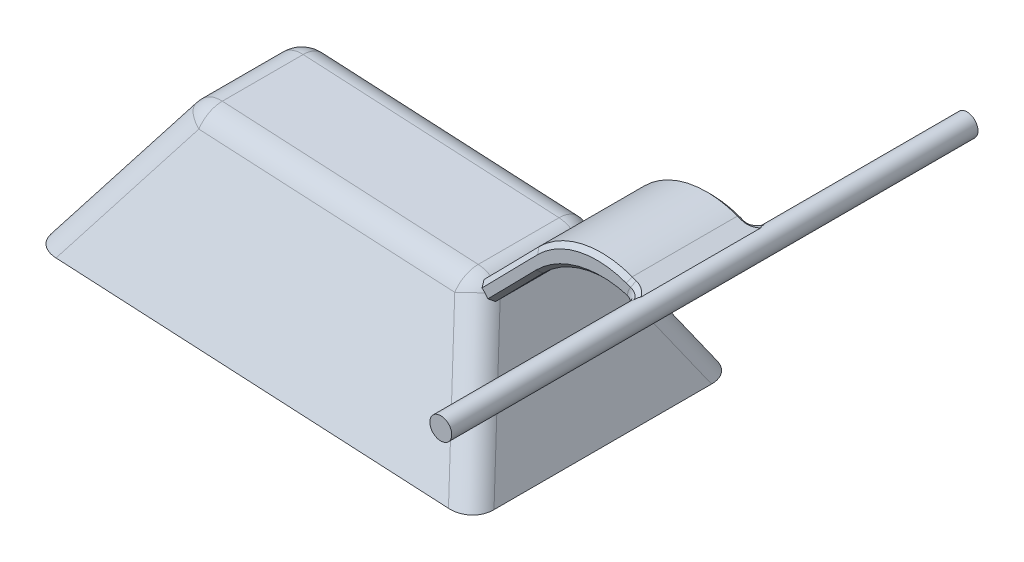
ISO-10303-21;
HEADER;
FILE_DESCRIPTION(('STEP AP214'),'2;1');
FILE_NAME('part.step','',(''),(''),'','','');
FILE_SCHEMA(('AUTOMOTIVE_DESIGN { 1 0 10303 214 1 1 1 1 }'));
ENDSEC;
DATA;
#1=APPLICATION_CONTEXT('core data for automotive mechanical design processes');
#2=APPLICATION_PROTOCOL_DEFINITION('international standard','automotive_design',2000,#1);
#3=PRODUCT_CONTEXT('',#1,'mechanical');
#4=PRODUCT('Part','Part','',(#3));
#5=PRODUCT_RELATED_PRODUCT_CATEGORY('part','',(#4));
#6=PRODUCT_DEFINITION_FORMATION('','',#4);
#7=PRODUCT_DEFINITION_CONTEXT('part definition',#1,'design');
#8=PRODUCT_DEFINITION('design','',#6,#7);
#9=PRODUCT_DEFINITION_SHAPE('','',#8);
#10=(LENGTH_UNIT() NAMED_UNIT(*) SI_UNIT(.MILLI.,.METRE.));
#11=(NAMED_UNIT(*) PLANE_ANGLE_UNIT() SI_UNIT($,.RADIAN.));
#12=(NAMED_UNIT(*) SI_UNIT($,.STERADIAN.) SOLID_ANGLE_UNIT());
#13=UNCERTAINTY_MEASURE_WITH_UNIT(LENGTH_MEASURE(1.E-05),#10,'distance_accuracy_value','');
#14=(GEOMETRIC_REPRESENTATION_CONTEXT(3) GLOBAL_UNCERTAINTY_ASSIGNED_CONTEXT((#13)) GLOBAL_UNIT_ASSIGNED_CONTEXT((#10,
#11,#12)) REPRESENTATION_CONTEXT('',''));
#15=CARTESIAN_POINT('',(0.,0.,0.));
#16=DIRECTION('',(0.,0.,1.));
#17=DIRECTION('',(1.,0.,0.));
#18=AXIS2_PLACEMENT_3D('',#15,#16,#17);
#19=CARTESIAN_POINT('',(47.,22.25,30.));
#20=DIRECTION('',(0.,0.,-1.));
#21=DIRECTION('',(-1.,0.,0.));
#22=AXIS2_PLACEMENT_3D('',#19,#20,#21);
#23=CYLINDRICAL_SURFACE('',#22,1.25);
#24=CARTESIAN_POINT('',(47.,22.25,-30.));
#25=DIRECTION('',(0.,0.,1.));
#26=DIRECTION('',(1.,0.,0.));
#27=AXIS2_PLACEMENT_3D('',#24,#25,#26);
#28=CIRCLE('',#27,1.25);
#29=CARTESIAN_POINT('',(48.25,22.25,-30.));
#30=VERTEX_POINT('',#29);
#31=EDGE_CURVE('E627',#30,#30,#28,.T.);
#32=ORIENTED_EDGE('',*,*,#31,.T.);
#33=EDGE_LOOP('',(#32));
#34=FACE_BOUND('',#33,.T.);
#35=CARTESIAN_POINT('',(47.,22.25,30.));
#36=DIRECTION('',(0.,0.,1.));
#37=DIRECTION('',(1.,0.,0.));
#38=AXIS2_PLACEMENT_3D('',#35,#36,#37);
#39=CIRCLE('',#38,1.25);
#40=CARTESIAN_POINT('',(48.25,22.25,30.));
#41=VERTEX_POINT('',#40);
#42=EDGE_CURVE('E232',#41,#41,#39,.T.);
#43=ORIENTED_EDGE('',*,*,#42,.F.);
#44=EDGE_LOOP('',(#43));
#45=FACE_BOUND('',#44,.T.);
#46=DIRECTION('',(0.,0.,-1.));
#47=VECTOR('',#46,1.);
#48=CARTESIAN_POINT('',(45.9466296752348,21.5770134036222,30.));
#49=LINE('',#48,#47);
#50=CARTESIAN_POINT('',(45.9466296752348,21.5770134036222,-6.8433071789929));
#51=VERTEX_POINT('',#50);
#52=CARTESIAN_POINT('',(45.9466296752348,21.5770134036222,6.84330717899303));
#53=VERTEX_POINT('',#52);
#54=EDGE_CURVE('E216',#51,#53,#49,.F.);
#55=ORIENTED_EDGE('',*,*,#54,.F.);
#56=CARTESIAN_POINT('',(45.835023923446,21.7968656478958,-7.49999999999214));
#57=CARTESIAN_POINT('',(45.8350251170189,21.7968640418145,-7.49319282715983));
#58=CARTESIAN_POINT('',(45.8350249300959,21.7968646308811,-7.48638565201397));
#59=CARTESIAN_POINT('',(45.8350249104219,21.7968640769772,-7.47273950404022));
#60=CARTESIAN_POINT('',(45.8350250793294,21.7968629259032,-7.46590053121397));
#61=CARTESIAN_POINT('',(45.8350274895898,21.7968565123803,-7.45734739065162));
#62=CARTESIAN_POINT('',(45.8350280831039,21.7968549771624,-7.4556332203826));
#63=CARTESIAN_POINT('',(45.8350308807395,21.7968476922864,-7.44882455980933));
#64=CARTESIAN_POINT('',(45.8350339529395,21.7968396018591,-7.44373007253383));
#65=CARTESIAN_POINT('',(45.8350455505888,21.7968095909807,-7.43180731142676));
#66=CARTESIAN_POINT('',(45.8350555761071,21.7967839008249,-7.42497904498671));
#67=CARTESIAN_POINT('',(45.8350792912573,21.7967233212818,-7.41471488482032));
#68=CARTESIAN_POINT('',(45.8350886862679,21.7966993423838,-7.4112789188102));
#69=CARTESIAN_POINT('',(45.8351103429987,21.7966433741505,-7.40449079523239));
#70=CARTESIAN_POINT('',(45.8351225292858,21.7966115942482,-7.40113863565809));
#71=CARTESIAN_POINT('',(45.8351648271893,21.7965007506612,-7.39105328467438));
#72=CARTESIAN_POINT('',(45.8352006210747,21.7964063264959,-7.38432026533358));
#73=CARTESIAN_POINT('',(45.8352963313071,21.7961575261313,-7.37079885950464));
#74=CARTESIAN_POINT('',(45.8353564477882,21.7960026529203,-7.3640104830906));
#75=CARTESIAN_POINT('',(45.8355085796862,21.795613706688,-7.35035816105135));
#76=CARTESIAN_POINT('',(45.8356009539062,21.7953787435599,-7.34349424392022));
#77=CARTESIAN_POINT('',(45.8358248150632,21.7948097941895,-7.32967067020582));
#78=CARTESIAN_POINT('',(45.8359568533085,21.7944744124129,-7.3227110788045));
#79=CARTESIAN_POINT('',(45.8362582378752,21.793704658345,-7.30903678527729));
#80=CARTESIAN_POINT('',(45.8364261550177,21.7932740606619,-7.30232184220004));
#81=CARTESIAN_POINT('',(45.8368123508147,21.792286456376,-7.28886359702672));
#82=CARTESIAN_POINT('',(45.8370309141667,21.7917287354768,-7.28212035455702));
#83=CARTESIAN_POINT('',(45.8375296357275,21.7904650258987,-7.26859437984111));
#84=CARTESIAN_POINT('',(45.8378102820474,21.7897578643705,-7.26181177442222));
#85=CARTESIAN_POINT('',(45.8384383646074,21.7881792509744,-7.24819109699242));
#86=CARTESIAN_POINT('',(45.8387865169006,21.7873060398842,-7.2413532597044));
#87=CARTESIAN_POINT('',(45.83936314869,21.7858636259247,-7.2310838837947));
#88=CARTESIAN_POINT('',(45.8395655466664,21.7853579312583,-7.22764187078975));
#89=CARTESIAN_POINT('',(45.8399786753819,21.7843276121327,-7.22093599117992));
#90=CARTESIAN_POINT('',(45.8401884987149,21.7838051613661,-7.21767173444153));
#91=CARTESIAN_POINT('',(45.840848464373,21.782165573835,-7.20783711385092));
#92=CARTESIAN_POINT('',(45.8413260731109,21.7809838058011,-7.20127919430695));
#93=CARTESIAN_POINT('',(45.8423645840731,21.7784263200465,-7.18812321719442));
#94=CARTESIAN_POINT('',(45.8429264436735,21.777048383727,-7.18152566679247));
#95=CARTESIAN_POINT('',(45.8441410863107,21.7740846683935,-7.16829153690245));
#96=CARTESIAN_POINT('',(45.8447949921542,21.7724963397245,-7.16165562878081));
#97=CARTESIAN_POINT('',(45.8462081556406,21.7690925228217,-7.14835367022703));
#98=CARTESIAN_POINT('',(45.8469687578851,21.7672741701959,-7.14168849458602));
#99=CARTESIAN_POINT('',(45.8485672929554,21.7634756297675,-7.12857542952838));
#100=CARTESIAN_POINT('',(45.8494031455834,21.7614999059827,-7.12212599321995));
#101=CARTESIAN_POINT('',(45.8511752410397,21.7573452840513,-7.10929775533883));
#102=CARTESIAN_POINT('',(45.8521116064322,21.755166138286,-7.10291905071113));
#103=CARTESIAN_POINT('',(45.8540902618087,21.7506011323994,-7.09023072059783));
#104=CARTESIAN_POINT('',(45.8551328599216,21.748214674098,-7.08392135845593));
#105=CARTESIAN_POINT('',(45.8573301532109,21.7432315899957,-7.07137100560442));
#106=CARTESIAN_POINT('',(45.8584853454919,21.7406340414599,-7.0651304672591));
#107=CARTESIAN_POINT('',(45.8603039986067,21.7365846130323,-7.05583694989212));
#108=CARTESIAN_POINT('',(45.8609259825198,21.7352061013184,-7.05274363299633));
#109=CARTESIAN_POINT('',(45.8621856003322,21.7324281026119,-7.04664638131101));
#110=CARTESIAN_POINT('',(45.862822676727,21.7310295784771,-7.0436418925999));
#111=CARTESIAN_POINT('',(45.8647780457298,21.7267586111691,-7.03465891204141));
#112=CARTESIAN_POINT('',(45.8661381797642,21.7238159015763,-7.02872266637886));
#113=CARTESIAN_POINT('',(45.8689784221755,21.7177376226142,-7.01695142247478));
#114=CARTESIAN_POINT('',(45.8704589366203,21.7146014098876,-7.01111685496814));
#115=CARTESIAN_POINT('',(45.8735459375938,21.7081367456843,-6.99955245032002));
#116=CARTESIAN_POINT('',(45.8751529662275,21.7048074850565,-6.99382320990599));
#117=CARTESIAN_POINT('',(45.8784988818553,21.6979580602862,-6.98247364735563));
#118=CARTESIAN_POINT('',(45.8802384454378,21.6944369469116,-6.97685409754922));
#119=CARTESIAN_POINT('',(45.8838215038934,21.6872732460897,-6.96583254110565));
#120=CARTESIAN_POINT('',(45.885663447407,21.6836326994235,-6.96042870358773));
#121=CARTESIAN_POINT('',(45.8894810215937,21.6761826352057,-6.94975479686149));
#122=CARTESIAN_POINT('',(45.8914571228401,21.6723725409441,-6.94448529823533));
#123=CARTESIAN_POINT('',(45.8955489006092,21.6645865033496,-6.93408611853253));
#124=CARTESIAN_POINT('',(45.8976651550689,21.6606099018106,-6.92895715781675));
#125=CARTESIAN_POINT('',(45.9020431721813,21.6524941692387,-6.91884531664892));
#126=CARTESIAN_POINT('',(45.9043056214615,21.6483543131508,-6.91386331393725));
#127=CARTESIAN_POINT('',(45.9078074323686,21.6420350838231,-6.90651612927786));
#128=CARTESIAN_POINT('',(45.9089953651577,21.639905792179,-6.90408300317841));
#129=CARTESIAN_POINT('',(45.9113831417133,21.6356555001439,-6.89930939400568));
#130=CARTESIAN_POINT('',(45.9125823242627,21.6335351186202,-6.89696802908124));
#131=CARTESIAN_POINT('',(45.9162365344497,21.6271183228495,-6.89000210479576));
#132=CARTESIAN_POINT('',(45.918742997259,21.6227757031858,-6.88544669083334));
#133=CARTESIAN_POINT('',(45.9239045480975,21.6139603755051,-6.87651327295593));
#134=CARTESIAN_POINT('',(45.9265601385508,21.6094872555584,-6.8721359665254));
#135=CARTESIAN_POINT('',(45.9320254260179,21.600415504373,-6.86356668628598));
#136=CARTESIAN_POINT('',(45.934835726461,21.595816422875,-6.85937557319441));
#137=CARTESIAN_POINT('',(45.9406154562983,21.5864978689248,-6.85118708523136));
#138=CARTESIAN_POINT('',(45.9435855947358,21.581777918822,-6.84719075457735));
#139=CARTESIAN_POINT('',(45.9466296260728,21.5770134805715,-6.843306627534));
#140=B_SPLINE_CURVE_WITH_KNOTS('',3,(#56,#57,#58,#59,#60,#61,#62,#63,#64,#65,#66,#67,#68,#69,
#70,#71,#72,#73,#74,#75,#76,#77,#78,#79,#80,#81,#82,#83,#84,#85,#86,#87,#88,#89,#90,#91,#92,#93,
#94,#95,#96,#97,#98,#99,#100,#101,#102,#103,#104,#105,#106,#107,#108,#109,#110,#111,#112,#113,
#114,#115,#116,#117,#118,#119,#120,#121,#122,#123,#124,#125,#126,#127,#128,#129,#130,#131,#132,
#133,#134,#135,#136,#137,#138,#139),.UNSPECIFIED.,.F.,.F.,(4,2,2,2,2,2,2,2,2,2,2,2,2,2,2,2,2,2,
2,2,2,2,2,2,2,2,2,2,2,2,2,2,2,2,2,2,2,2,2,2,2,4),(0.,0.0204215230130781,0.0409384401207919,
0.0460809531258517,0.0613644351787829,0.0818493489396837,0.0921575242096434,0.102214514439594,
0.122415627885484,0.142786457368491,0.163391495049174,0.184297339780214,0.204488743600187,
0.22479652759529,0.24527004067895,0.265973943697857,0.276428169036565,0.28636527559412,
0.30640415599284,0.326690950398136,0.347251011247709,0.368098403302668,0.388485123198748,
0.408896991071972,0.429369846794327,0.449937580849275,0.460266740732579,0.470390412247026,
0.490676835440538,0.511034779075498,0.531485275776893,0.552048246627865,0.572356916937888,
0.592740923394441,0.61321496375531,0.633793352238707,0.644126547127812,0.654262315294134,
0.674580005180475,0.694970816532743,0.715447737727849,0.736024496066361),.UNSPECIFIED.);
#141=CARTESIAN_POINT('',(45.8350238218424,21.7968659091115,-7.5));
#142=VERTEX_POINT('',#141);
#143=EDGE_CURVE('E193',#51,#142,#140,.F.);
#144=ORIENTED_EDGE('',*,*,#143,.T.);
#145=CARTESIAN_POINT('',(47.,22.25,-7.5));
#146=DIRECTION('',(0.,0.,-1.));
#147=DIRECTION('',(-1.,0.,0.));
#148=AXIS2_PLACEMENT_3D('',#145,#146,#147);
#149=CIRCLE('',#148,1.25);
#150=CARTESIAN_POINT('',(46.4202276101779,23.3574131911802,-7.5));
#151=VERTEX_POINT('',#150);
#152=EDGE_CURVE('E259',#142,#151,#149,.T.);
#153=ORIENTED_EDGE('',*,*,#152,.T.);
#154=CARTESIAN_POINT('',(46.6488764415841,23.4496717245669,-6.84330637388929));
#155=CARTESIAN_POINT('',(46.6434041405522,23.4480701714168,-6.84722343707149));
#156=CARTESIAN_POINT('',(46.6380183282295,23.4464532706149,-6.85125474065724));
#157=CARTESIAN_POINT('',(46.6274526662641,23.4432056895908,-6.85951514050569));
#158=CARTESIAN_POINT('',(46.6222718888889,23.4415751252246,-6.86374309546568));
#159=CARTESIAN_POINT('',(46.6121153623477,23.4383077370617,-6.87238735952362));
#160=CARTESIAN_POINT('',(46.6071387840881,23.436670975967,-6.8768027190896));
#161=CARTESIAN_POINT('',(46.5973892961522,23.4333984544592,-6.88581324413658));
#162=CARTESIAN_POINT('',(46.592615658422,23.431762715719,-6.89040762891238));
#163=CARTESIAN_POINT('',(46.585601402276,23.4293133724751,-6.89743316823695));
#164=CARTESIAN_POINT('',(46.5832905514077,23.4284986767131,-6.89979423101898));
#165=CARTESIAN_POINT('',(46.5786832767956,23.4268594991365,-6.90459535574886));
#166=CARTESIAN_POINT('',(46.5763875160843,23.4260350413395,-6.90703606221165));
#167=CARTESIAN_POINT('',(46.5695946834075,23.4235735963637,-6.91440352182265));
#168=CARTESIAN_POINT('',(46.5651694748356,23.4219406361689,-6.91939823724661));
#169=CARTESIAN_POINT('',(46.5565411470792,23.4187031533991,-6.92953204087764));
#170=CARTESIAN_POINT('',(46.5523368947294,23.417098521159,-6.93467013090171));
#171=CARTESIAN_POINT('',(46.544147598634,23.4139241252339,-6.94508368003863));
#172=CARTESIAN_POINT('',(46.540161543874,23.4123542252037,-6.95035830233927));
#173=CARTESIAN_POINT('',(46.5324056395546,23.4092554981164,-6.96103810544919));
#174=CARTESIAN_POINT('',(46.5286349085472,23.4077265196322,-6.96644260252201));
#175=CARTESIAN_POINT('',(46.5212060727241,23.4046743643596,-6.97752507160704));
#176=CARTESIAN_POINT('',(46.5175526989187,23.4031521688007,-6.98320648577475));
#177=CARTESIAN_POINT('',(46.5104812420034,23.40016843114,-6.99467581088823));
#178=CARTESIAN_POINT('',(46.507061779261,23.3987065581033,-7.00046278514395));
#179=CARTESIAN_POINT('',(46.5004535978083,23.3958483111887,-7.01213801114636));
#180=CARTESIAN_POINT('',(46.4972636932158,23.3944516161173,-7.01802551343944));
#181=CARTESIAN_POINT('',(46.491109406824,23.3917280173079,-7.02989726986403));
#182=CARTESIAN_POINT('',(46.488144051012,23.390400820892,-7.03588095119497));
#183=CARTESIAN_POINT('',(46.4838574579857,23.388463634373,-7.04493318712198));
#184=CARTESIAN_POINT('',(46.4824573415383,23.3878276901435,-7.04795911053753));
#185=CARTESIAN_POINT('',(46.4796850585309,23.386562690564,-7.05409104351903));
#186=CARTESIAN_POINT('',(46.4783138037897,23.3859339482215,-7.05719752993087));
#187=CARTESIAN_POINT('',(46.4742947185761,23.3840827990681,-7.0665254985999));
#188=CARTESIAN_POINT('',(46.4717265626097,23.3828886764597,-7.07278717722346));
#189=CARTESIAN_POINT('',(46.4668186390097,23.3805877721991,-7.08537274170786));
#190=CARTESIAN_POINT('',(46.4644776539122,23.3794805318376,-7.09169607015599));
#191=CARTESIAN_POINT('',(46.4600162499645,23.3773542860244,-7.10440423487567));
#192=CARTESIAN_POINT('',(46.4578949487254,23.3763349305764,-7.11078870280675));
#193=CARTESIAN_POINT('',(46.4538635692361,23.3743848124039,-7.12361874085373));
#194=CARTESIAN_POINT('',(46.4519529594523,23.3734538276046,-7.13006411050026));
#195=CARTESIAN_POINT('',(46.448296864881,23.371662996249,-7.14314032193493));
#196=CARTESIAN_POINT('',(46.4465550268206,23.370804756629,-7.14977240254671));
#197=CARTESIAN_POINT('',(46.4432877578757,23.3691865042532,-7.16304395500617));
#198=CARTESIAN_POINT('',(46.4417606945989,23.3684257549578,-7.1696829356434));
#199=CARTESIAN_POINT('',(46.4389097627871,23.3669985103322,-7.18297191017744));
#200=CARTESIAN_POINT('',(46.4375847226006,23.3663314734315,-7.18962159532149));
#201=CARTESIAN_POINT('',(46.4351228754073,23.3650869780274,-7.20293640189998));
#202=CARTESIAN_POINT('',(46.4339853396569,23.3645091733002,-7.20960135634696));
#203=CARTESIAN_POINT('',(46.4324077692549,23.36370538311,-7.21961795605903));
#204=CARTESIAN_POINT('',(46.4319037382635,23.3634481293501,-7.22295719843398));
#205=CARTESIAN_POINT('',(46.4309233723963,23.3629475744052,-7.22972614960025));
#206=CARTESIAN_POINT('',(46.4304480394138,23.3627047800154,-7.23315604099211));
#207=CARTESIAN_POINT('',(46.4290940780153,23.3620127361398,-7.24337630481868));
#208=CARTESIAN_POINT('',(46.4282750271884,23.3615934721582,-7.25017671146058));
#209=CARTESIAN_POINT('',(46.4268018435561,23.3608363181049,-7.26371374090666));
#210=CARTESIAN_POINT('',(46.4261457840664,23.3604974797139,-7.27045010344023));
#211=CARTESIAN_POINT('',(46.4249765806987,23.3598912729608,-7.28386147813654));
#212=CARTESIAN_POINT('',(46.4244619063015,23.3596231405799,-7.29053632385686));
#213=CARTESIAN_POINT('',(46.4235520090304,23.3591487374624,-7.30382616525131));
#214=CARTESIAN_POINT('',(46.4231555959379,23.3589418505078,-7.31044105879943));
#215=CARTESIAN_POINT('',(46.4224459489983,23.3585711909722,-7.3239688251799));
#216=CARTESIAN_POINT('',(46.4221371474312,23.3584097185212,-7.33088199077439));
#217=CARTESIAN_POINT('',(46.4216161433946,23.3581361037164,-7.34461235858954));
#218=CARTESIAN_POINT('',(46.4214026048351,23.3580232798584,-7.35142949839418));
#219=CARTESIAN_POINT('',(46.4210419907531,23.357835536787,-7.36497741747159));
#220=CARTESIAN_POINT('',(46.4208940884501,23.3577601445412,-7.37170816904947));
#221=CARTESIAN_POINT('',(46.4206577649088,23.3576384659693,-7.38511201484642));
#222=CARTESIAN_POINT('',(46.4205688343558,23.357591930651,-7.39178509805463));
#223=CARTESIAN_POINT('',(46.4204650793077,23.3575375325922,-7.40177939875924));
#224=CARTESIAN_POINT('',(46.4204354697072,23.3575219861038,-7.40510044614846));
#225=CARTESIAN_POINT('',(46.4203833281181,23.3574947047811,-7.41183972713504));
#226=CARTESIAN_POINT('',(46.420361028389,23.3574830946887,-7.41525796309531));
#227=CARTESIAN_POINT('',(46.4203047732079,23.3574537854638,-7.42546213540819));
#228=CARTESIAN_POINT('',(46.420280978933,23.3574413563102,-7.43224814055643));
#229=CARTESIAN_POINT('',(46.420253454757,23.3574268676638,-7.44409047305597));
#230=CARTESIAN_POINT('',(46.4202461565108,23.357422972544,-7.44914679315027));
#231=CARTESIAN_POINT('',(46.4202328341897,23.3574158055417,-7.46269269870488));
#232=CARTESIAN_POINT('',(46.4202310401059,23.3574147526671,-7.47118228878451));
#233=CARTESIAN_POINT('',(46.4202302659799,23.3574143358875,-7.48644792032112));
#234=CARTESIAN_POINT('',(46.420230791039,23.3574146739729,-7.49322396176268));
#235=CARTESIAN_POINT('',(46.4202295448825,23.3574142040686,-7.49999999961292));
#236=B_SPLINE_CURVE_WITH_KNOTS('',3,(#154,#155,#156,#157,#158,#159,#160,#161,#162,#163,#164,
#165,#166,#167,#168,#169,#170,#171,#172,#173,#174,#175,#176,#177,#178,#179,#180,#181,#182,#183,
#184,#185,#186,#187,#188,#189,#190,#191,#192,#193,#194,#195,#196,#197,#198,#199,#200,#201,#202,
#203,#204,#205,#206,#207,#208,#209,#210,#211,#212,#213,#214,#215,#216,#217,#218,#219,#220,#221,
#222,#223,#224,#225,#226,#227,#228,#229,#230,#231,#232,#233,#234,#235),.UNSPECIFIED.,.F.,.F.,(4,
2,2,2,2,2,2,2,2,2,2,2,2,2,2,2,2,2,2,2,2,2,2,2,2,2,2,2,2,2,2,2,2,2,2,2,2,2,2,2,4),(0.,
0.0207513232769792,0.0413944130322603,0.061943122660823,0.0824105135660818,0.0926180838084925,
0.102969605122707,0.123573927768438,0.14405947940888,0.164440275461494,0.184730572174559,
0.20549782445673,0.226129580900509,0.246645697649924,0.267067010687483,0.277249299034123,
0.287608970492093,0.30822124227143,0.328716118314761,0.349125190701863,0.369481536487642,
0.390209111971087,0.410769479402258,0.431205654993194,0.451560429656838,0.461720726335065,
0.472133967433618,0.492718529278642,0.513046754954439,0.533145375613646,0.553034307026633,
0.57379918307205,0.594262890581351,0.614460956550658,0.634482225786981,0.644445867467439,
0.654700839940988,0.675058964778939,0.690227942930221,0.71569670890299,0.736024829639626),.UNSPECIFIED.);
#237=CARTESIAN_POINT('',(46.6488765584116,23.4496717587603,-6.84330710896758));
#238=VERTEX_POINT('',#237);
#239=EDGE_CURVE('E63',#151,#238,#236,.F.);
#240=ORIENTED_EDGE('',*,*,#239,.T.);
#241=DIRECTION('',(0.,0.,-1.));
#242=VECTOR('',#241,1.);
#243=CARTESIAN_POINT('',(46.6488765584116,23.4496717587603,30.));
#244=LINE('',#243,#242);
#245=CARTESIAN_POINT('',(46.6488765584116,23.4496717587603,6.84330710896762));
#246=VERTEX_POINT('',#245);
#247=EDGE_CURVE('E228',#238,#246,#244,.F.);
#248=ORIENTED_EDGE('',*,*,#247,.T.);
#249=CARTESIAN_POINT('',(46.4202295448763,23.3574142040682,7.49999999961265));
#250=CARTESIAN_POINT('',(46.4202307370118,23.3574145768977,7.49318332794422));
#251=CARTESIAN_POINT('',(46.4202302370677,23.3574142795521,7.48636665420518));
#252=CARTESIAN_POINT('',(46.4202310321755,23.3574147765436,7.47272137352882));
#253=CARTESIAN_POINT('',(46.4202323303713,23.3574155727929,7.46589276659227));
#254=CARTESIAN_POINT('',(46.4202383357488,23.3574187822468,7.45735174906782));
#255=CARTESIAN_POINT('',(46.4202397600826,23.3574195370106,7.45563933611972));
#256=CARTESIAN_POINT('',(46.4202465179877,23.3574231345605,7.44883875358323));
#257=CARTESIAN_POINT('',(46.4202540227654,23.3574271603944,7.44375058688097));
#258=CARTESIAN_POINT('',(46.4202822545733,23.3574420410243,7.43183333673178));
#259=CARTESIAN_POINT('',(46.4203066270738,23.3574547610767,7.425004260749));
#260=CARTESIAN_POINT('',(46.4203642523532,23.3574847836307,7.41473511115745));
#261=CARTESIAN_POINT('',(46.4203870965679,23.3574966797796,7.41129496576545));
#262=CARTESIAN_POINT('',(46.4204405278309,23.3575246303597,7.40451255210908));
#263=CARTESIAN_POINT('',(46.4204708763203,23.357540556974,7.40117028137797));
#264=CARTESIAN_POINT('',(46.4205773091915,23.357596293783,7.39111112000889));
#265=CARTESIAN_POINT('',(46.4206686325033,23.3576439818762,7.38439440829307));
#266=CARTESIAN_POINT('',(46.4209108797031,23.35776863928,7.37090113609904));
#267=CARTESIAN_POINT('',(46.4210623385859,23.3578458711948,7.36412458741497));
#268=CARTESIAN_POINT('',(46.4214315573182,23.3580381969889,7.3504826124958));
#269=CARTESIAN_POINT('',(46.4216501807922,23.3581537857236,7.34361721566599));
#270=CARTESIAN_POINT('',(46.4221839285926,23.3584341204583,7.32978841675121));
#271=CARTESIAN_POINT('',(46.422500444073,23.3585995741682,7.32282508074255));
#272=CARTESIAN_POINT('',(46.4232261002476,23.3589785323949,7.30922666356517));
#273=CARTESIAN_POINT('',(46.4236302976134,23.3591894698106,7.30259125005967));
#274=CARTESIAN_POINT('',(46.4245573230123,23.3596727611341,7.28926211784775));
#275=CARTESIAN_POINT('',(46.425081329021,23.3599457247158,7.28256850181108));
#276=CARTESIAN_POINT('',(46.4262709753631,23.3605624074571,7.2691214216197));
#277=CARTESIAN_POINT('',(46.4269381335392,23.3609068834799,7.2623681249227));
#278=CARTESIAN_POINT('',(46.4284354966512,23.3616761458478,7.2487986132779));
#279=CARTESIAN_POINT('',(46.4292676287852,23.3621018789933,7.24198266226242));
#280=CARTESIAN_POINT('',(46.4306422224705,23.362804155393,7.23173938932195));
#281=CARTESIAN_POINT('',(46.4311246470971,23.3630504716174,7.22830182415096));
#282=CARTESIAN_POINT('',(46.4321163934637,23.3635566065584,7.22153883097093));
#283=CARTESIAN_POINT('',(46.4326244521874,23.3638157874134,7.21821317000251));
#284=CARTESIAN_POINT('',(46.4342139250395,23.3646252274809,7.20823742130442));
#285=CARTESIAN_POINT('',(46.4353591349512,23.3652066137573,7.20159983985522));
#286=CARTESIAN_POINT('',(46.4378355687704,23.3664577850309,7.18834017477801));
#287=CARTESIAN_POINT('',(46.4391675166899,23.367127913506,7.18171825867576));
#288=CARTESIAN_POINT('',(46.4420312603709,23.3685607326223,7.16848535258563));
#289=CARTESIAN_POINT('',(46.4435642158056,23.3693239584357,7.16187467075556));
#290=CARTESIAN_POINT('',(46.4468420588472,23.3709464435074,7.14866037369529));
#291=CARTESIAN_POINT('',(46.4485885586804,23.3718064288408,7.14205724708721));
#292=CARTESIAN_POINT('',(46.4522586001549,23.3736028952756,7.12901708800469));
#293=CARTESIAN_POINT('',(46.4541791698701,23.3745380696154,7.1225790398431));
#294=CARTESIAN_POINT('',(46.4582304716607,23.3764963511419,7.10976409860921));
#295=CARTESIAN_POINT('',(46.4603617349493,23.3775196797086,7.10338740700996));
#296=CARTESIAN_POINT('',(46.4648429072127,23.3796536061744,7.09069522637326));
#297=CARTESIAN_POINT('',(46.4671936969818,23.3807645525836,7.08438010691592));
#298=CARTESIAN_POINT('',(46.4721210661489,23.3830725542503,7.07181152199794));
#299=CARTESIAN_POINT('',(46.4746988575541,23.384270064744,7.06555861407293));
#300=CARTESIAN_POINT('',(46.4787322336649,23.3861260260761,7.05624415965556));
#301=CARTESIAN_POINT('',(46.4801082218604,23.3867563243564,7.05314228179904));
#302=CARTESIAN_POINT('',(46.482883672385,23.3880215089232,7.04703313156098));
#303=CARTESIAN_POINT('',(46.4842819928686,23.3886560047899,7.04402525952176));
#304=CARTESIAN_POINT('',(46.4885623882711,23.3905884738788,7.03502700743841));
#305=CARTESIAN_POINT('',(46.491522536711,23.3919120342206,7.02907898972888));
#306=CARTESIAN_POINT('',(46.4976641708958,23.3946274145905,7.01727792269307));
#307=CARTESIAN_POINT('',(46.5008466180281,23.396019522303,7.01142544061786));
#308=CARTESIAN_POINT('',(46.5074375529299,23.398867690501,6.99981957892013));
#309=CARTESIAN_POINT('',(46.5108472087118,23.40032406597,6.99406693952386));
#310=CARTESIAN_POINT('',(46.5178966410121,23.4032959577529,6.98266556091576));
#311=CARTESIAN_POINT('',(46.5215377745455,23.4048117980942,6.97701774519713));
#312=CARTESIAN_POINT('',(46.528958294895,23.4078581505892,6.96597352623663));
#313=CARTESIAN_POINT('',(46.5327339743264,23.4093878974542,6.96057442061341));
#314=CARTESIAN_POINT('',(46.5404996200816,23.4124879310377,6.94990559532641));
#315=CARTESIAN_POINT('',(46.5444904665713,23.4140583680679,6.944636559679));
#316=CARTESIAN_POINT('',(46.5526891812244,23.4172336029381,6.93423438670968));
#317=CARTESIAN_POINT('',(46.5568980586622,23.4188385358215,6.92910208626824));
#318=CARTESIAN_POINT('',(46.5655354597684,23.4220763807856,6.91898007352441));
#319=CARTESIAN_POINT('',(46.5699651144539,23.4237094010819,6.91399135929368));
#320=CARTESIAN_POINT('',(46.5767644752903,23.4261707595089,6.90663303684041));
#321=CARTESIAN_POINT('',(46.5790623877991,23.4269951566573,6.90419541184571));
#322=CARTESIAN_POINT('',(46.5836604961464,23.428629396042,6.89941437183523));
#323=CARTESIAN_POINT('',(46.5859597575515,23.4294392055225,6.89707004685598));
#324=CARTESIAN_POINT('',(46.5929382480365,23.4318737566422,6.8900941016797));
#325=CARTESIAN_POINT('',(46.5976868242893,23.4334995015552,6.88553180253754));
#326=CARTESIAN_POINT('',(46.607383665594,23.4367518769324,6.87658344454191));
#327=CARTESIAN_POINT('',(46.6123326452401,23.4383784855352,6.87219815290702));
#328=CARTESIAN_POINT('',(46.6224314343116,23.441625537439,6.8636118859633));
#329=CARTESIAN_POINT('',(46.6275820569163,23.4432459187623,6.85941184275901));
#330=CARTESIAN_POINT('',(46.6380848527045,23.4464732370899,6.85120496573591));
#331=CARTESIAN_POINT('',(46.6434379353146,23.4480800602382,6.84719925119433));
#332=CARTESIAN_POINT('',(46.6488764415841,23.4496717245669,6.84330637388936));
#333=B_SPLINE_CURVE_WITH_KNOTS('',3,(#249,#250,#251,#252,#253,#254,#255,#256,#257,#258,#259,
#260,#261,#262,#263,#264,#265,#266,#267,#268,#269,#270,#271,#272,#273,#274,#275,#276,#277,#278,
#279,#280,#281,#282,#283,#284,#285,#286,#287,#288,#289,#290,#291,#292,#293,#294,#295,#296,#297,
#298,#299,#300,#301,#302,#303,#304,#305,#306,#307,#308,#309,#310,#311,#312,#313,#314,#315,#316,
#317,#318,#319,#320,#321,#322,#323,#324,#325,#326,#327,#328,#329,#330,#331,#332),.UNSPECIFIED.,
.F.,.F.,(4,2,2,2,2,2,2,2,2,2,2,2,2,2,2,2,2,2,2,2,2,2,2,2,2,2,2,2,2,2,2,2,2,2,2,2,2,2,2,2,2,4),
(0.,0.0204500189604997,0.040935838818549,0.0460730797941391,0.06133759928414,0.0818249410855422,
0.0921456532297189,0.102172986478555,0.122325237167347,0.142660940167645,0.163269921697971,
0.184186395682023,0.204138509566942,0.224295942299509,0.244678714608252,0.265315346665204,
0.275755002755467,0.285877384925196,0.30615633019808,0.326516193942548,0.346999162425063,
0.367647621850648,0.387993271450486,0.408391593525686,0.428875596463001,0.44947650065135,
0.459830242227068,0.469961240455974,0.490279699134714,0.510692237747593,0.531219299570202,
0.551880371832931,0.572166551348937,0.592543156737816,0.613024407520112,0.633624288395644,
0.643973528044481,0.654119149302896,0.674462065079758,0.694885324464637,0.715401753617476,
0.736024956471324),.UNSPECIFIED.);
#334=CARTESIAN_POINT('',(46.4202276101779,23.3574131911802,7.5));
#335=VERTEX_POINT('',#334);
#336=EDGE_CURVE('E12',#246,#335,#333,.F.);
#337=ORIENTED_EDGE('',*,*,#336,.T.);
#338=CARTESIAN_POINT('',(47.,22.25,7.5));
#339=DIRECTION('',(0.,0.,-1.));
#340=DIRECTION('',(-1.,0.,0.));
#341=AXIS2_PLACEMENT_3D('',#338,#339,#340);
#342=CIRCLE('',#341,1.25);
#343=CARTESIAN_POINT('',(45.8350238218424,21.7968659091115,7.5));
#344=VERTEX_POINT('',#343);
#345=EDGE_CURVE('E252',#335,#344,#342,.F.);
#346=ORIENTED_EDGE('',*,*,#345,.T.);
#347=CARTESIAN_POINT('',(45.9466296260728,21.5770134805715,6.84330662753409));
#348=CARTESIAN_POINT('',(45.9435588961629,21.5818197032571,6.84722481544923));
#349=CARTESIAN_POINT('',(45.9405633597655,21.586580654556,6.85125717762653));
#350=CARTESIAN_POINT('',(45.9347356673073,21.5959789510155,6.85952105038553));
#351=CARTESIAN_POINT('',(45.9319027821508,21.6006167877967,6.86375148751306));
#352=CARTESIAN_POINT('',(45.9263950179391,21.6097636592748,6.87240251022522));
#353=CARTESIAN_POINT('',(45.92371951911,21.6142731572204,6.87682221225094));
#354=CARTESIAN_POINT('',(45.918520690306,21.6231587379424,6.88584330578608));
#355=CARTESIAN_POINT('',(45.9159968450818,21.6275352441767,6.89044398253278));
#356=CARTESIAN_POINT('',(45.9123183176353,21.6340009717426,6.89747988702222));
#357=CARTESIAN_POINT('',(45.9111113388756,21.6361373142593,6.89984487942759));
#358=CARTESIAN_POINT('',(45.9087211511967,21.6403964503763,6.90464128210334));
#359=CARTESIAN_POINT('',(45.907538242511,21.6425189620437,6.90707309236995));
#360=CARTESIAN_POINT('',(45.904051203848,21.6488180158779,6.91441598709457));
#361=CARTESIAN_POINT('',(45.9017982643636,21.6529445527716,6.91939463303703));
#362=CARTESIAN_POINT('',(45.89743856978,21.6610340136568,6.92949884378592));
#363=CARTESIAN_POINT('',(45.8953311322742,21.6649976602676,6.93462353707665));
#364=CARTESIAN_POINT('',(45.891256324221,21.6727581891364,6.94501332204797));
#365=CARTESIAN_POINT('',(45.8892883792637,21.6765557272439,6.95027769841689));
#366=CARTESIAN_POINT('',(45.8854864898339,21.6839811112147,6.9609405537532));
#367=CARTESIAN_POINT('',(45.8836520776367,21.6876095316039,6.96633846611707));
#368=CARTESIAN_POINT('',(45.8800737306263,21.6947690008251,6.97737774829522));
#369=CARTESIAN_POINT('',(45.8783320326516,21.6982971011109,6.98302175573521));
#370=CARTESIAN_POINT('',(45.8749826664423,21.7051589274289,6.99442070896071));
#371=CARTESIAN_POINT('',(45.8733743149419,21.7084936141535,7.00017487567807));
#372=CARTESIAN_POINT('',(45.8702854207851,21.7149675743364,7.01178958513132));
#373=CARTESIAN_POINT('',(45.8688043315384,21.718107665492,7.01764952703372));
#374=CARTESIAN_POINT('',(45.8659636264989,21.7241921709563,7.02947195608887));
#375=CARTESIAN_POINT('',(45.8646036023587,21.7271372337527,7.03543401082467));
#376=CARTESIAN_POINT('',(45.8626488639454,21.7314106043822,7.04445600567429));
#377=CARTESIAN_POINT('',(45.8620120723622,21.7328097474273,7.04747354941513));
#378=CARTESIAN_POINT('',(45.8607592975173,21.7355751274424,7.05356756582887));
#379=CARTESIAN_POINT('',(45.8601436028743,21.7369408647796,7.05664432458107));
#380=CARTESIAN_POINT('',(45.8583431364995,21.7409530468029,7.06588792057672));
#381=CARTESIAN_POINT('',(45.8571992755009,21.7435269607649,7.07209445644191));
#382=CARTESIAN_POINT('',(45.8550231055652,21.7484653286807,7.08457577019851));
#383=CARTESIAN_POINT('',(45.8539903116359,21.7508306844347,7.09085010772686));
#384=CARTESIAN_POINT('',(45.8520298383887,21.7553560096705,7.10346739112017));
#385=CARTESIAN_POINT('',(45.8511018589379,21.7575165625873,7.10981008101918));
#386=CARTESIAN_POINT('',(45.8493452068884,21.7616364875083,7.12256529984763));
#387=CARTESIAN_POINT('',(45.8485164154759,21.7635960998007,7.12897773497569));
#388=CARTESIAN_POINT('',(45.8469301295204,21.7673665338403,7.14202236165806));
#389=CARTESIAN_POINT('',(45.8461747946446,21.7691727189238,7.14865615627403));
#390=CARTESIAN_POINT('',(45.844771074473,21.77255448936,7.1618953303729));
#391=CARTESIAN_POINT('',(45.8441213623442,21.7741329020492,7.16849984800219));
#392=CARTESIAN_POINT('',(45.8429140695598,21.7770789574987,7.18167112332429));
#393=CARTESIAN_POINT('',(45.8423553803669,21.7784491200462,7.18823721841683));
#394=CARTESIAN_POINT('',(45.8413224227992,21.7809929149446,7.20133036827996));
#395=CARTESIAN_POINT('',(45.8408472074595,21.7821687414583,7.2078569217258));
#396=CARTESIAN_POINT('',(45.8401903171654,21.7838006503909,7.21764441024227));
#397=CARTESIAN_POINT('',(45.8399814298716,21.7843207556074,7.22089301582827));
#398=CARTESIAN_POINT('',(45.8395689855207,21.7853493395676,7.2275842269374));
#399=CARTESIAN_POINT('',(45.8393664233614,21.785855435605,7.2310272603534));
#400=CARTESIAN_POINT('',(45.8387893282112,21.7872989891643,7.24129967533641));
#401=CARTESIAN_POINT('',(45.8384409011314,21.7881728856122,7.24813954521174));
#402=CARTESIAN_POINT('',(45.8378123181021,21.789752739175,7.26176425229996));
#403=CARTESIAN_POINT('',(45.8375314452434,21.7904604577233,7.26854885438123));
#404=CARTESIAN_POINT('',(45.837032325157,21.7917251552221,7.28207880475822));
#405=CARTESIAN_POINT('',(45.836813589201,21.7922833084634,7.28882402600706));
#406=CARTESIAN_POINT('',(45.8364270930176,21.7932716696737,7.30228622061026));
#407=CARTESIAN_POINT('',(45.8362590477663,21.7937025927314,7.30900313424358));
#408=CARTESIAN_POINT('',(45.8359574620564,21.7944728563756,7.32268032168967));
#409=CARTESIAN_POINT('',(45.8358253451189,21.7948084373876,7.32964083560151));
#410=CARTESIAN_POINT('',(45.835601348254,21.7953777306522,7.34346622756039));
#411=CARTESIAN_POINT('',(45.8355089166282,21.7956128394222,7.35033104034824));
#412=CARTESIAN_POINT('',(45.8353566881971,21.796002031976,7.3639851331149));
#413=CARTESIAN_POINT('',(45.8352965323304,21.7961570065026,7.37077438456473));
#414=CARTESIAN_POINT('',(45.8352007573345,21.7964059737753,7.38429752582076));
#415=CARTESIAN_POINT('',(45.8351649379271,21.7965004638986,7.39103140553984));
#416=CARTESIAN_POINT('',(45.8351226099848,21.7966113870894,7.4011180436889));
#417=CARTESIAN_POINT('',(45.8351104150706,21.7966431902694,7.40447062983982));
#418=CARTESIAN_POINT('',(45.8350887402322,21.7966992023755,7.41125990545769));
#419=CARTESIAN_POINT('',(45.8350793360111,21.7967232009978,7.41469659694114));
#420=CARTESIAN_POINT('',(45.8350556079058,21.7967838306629,7.424962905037));
#421=CARTESIAN_POINT('',(45.8350455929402,21.7968095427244,7.43179259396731));
#422=CARTESIAN_POINT('',(45.8350339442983,21.7968395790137,7.4437178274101));
#423=CARTESIAN_POINT('',(45.8350308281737,21.7968476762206,7.44881336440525));
#424=CARTESIAN_POINT('',(45.8350253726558,21.7968622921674,7.46246392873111));
#425=CARTESIAN_POINT('',(45.8350249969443,21.7968640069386,7.47101896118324));
#426=CARTESIAN_POINT('',(45.8350248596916,21.7968646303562,7.48638266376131));
#427=CARTESIAN_POINT('',(45.8350249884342,21.7968640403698,7.49319133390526));
#428=CARTESIAN_POINT('',(45.835023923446,21.7968656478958,7.49999999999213));
#429=B_SPLINE_CURVE_WITH_KNOTS('',3,(#347,#348,#349,#350,#351,#352,#353,#354,#355,#356,#357,
#358,#359,#360,#361,#362,#363,#364,#365,#366,#367,#368,#369,#370,#371,#372,#373,#374,#375,#376,
#377,#378,#379,#380,#381,#382,#383,#384,#385,#386,#387,#388,#389,#390,#391,#392,#393,#394,#395,
#396,#397,#398,#399,#400,#401,#402,#403,#404,#405,#406,#407,#408,#409,#410,#411,#412,#413,#414,
#415,#416,#417,#418,#419,#420,#421,#422,#423,#424,#425,#426,#427,#428),.UNSPECIFIED.,.F.,.F.,(4,
2,2,2,2,2,2,2,2,2,2,2,2,2,2,2,2,2,2,2,2,2,2,2,2,2,2,2,2,2,2,2,2,2,2,2,2,2,2,2,4),(0.,
0.0207571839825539,0.0414125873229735,0.0619802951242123,0.0824736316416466,0.0926968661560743,
0.103009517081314,0.123547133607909,0.143980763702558,0.164324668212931,0.184593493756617,
0.205228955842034,0.225751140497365,0.246180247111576,0.266537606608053,0.276696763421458,
0.286962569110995,0.307405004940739,0.327754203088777,0.348043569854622,0.368308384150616,
0.389054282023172,0.409515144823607,0.429704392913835,0.449647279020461,0.459536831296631,
0.469994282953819,0.490704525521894,0.511184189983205,0.531498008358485,0.551695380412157,
0.57260402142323,0.593211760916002,0.613585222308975,0.633788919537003,0.643847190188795,
0.654157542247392,0.674646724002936,0.689933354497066,0.715598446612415,0.73602445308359),.UNSPECIFIED.);
#430=EDGE_CURVE('E207',#344,#53,#429,.F.);
#431=ORIENTED_EDGE('',*,*,#430,.T.);
#432=EDGE_LOOP('',(#55,#144,#153,#240,#248,#337,#346,#431));
#433=FACE_BOUND('',#432,.T.);
#434=ADVANCED_FACE('F51',(#34,#45,#433),#23,.T.);
#435=CARTESIAN_POINT('',(47.,22.25,30.));
#436=DIRECTION('',(0.,0.,1.));
#437=DIRECTION('',(1.,0.,0.));
#438=AXIS2_PLACEMENT_3D('',#435,#436,#437);
#439=PLANE('',#438);
#440=ORIENTED_EDGE('',*,*,#42,.T.);
#441=EDGE_LOOP('',(#440));
#442=FACE_BOUND('',#441,.T.);
#443=ADVANCED_FACE('F568',(#442),#439,.T.);
#444=CARTESIAN_POINT('',(47.,22.25,-30.));
#445=DIRECTION('',(0.,0.,1.));
#446=DIRECTION('',(1.,0.,0.));
#447=AXIS2_PLACEMENT_3D('',#444,#445,#446);
#448=PLANE('',#447);
#449=ORIENTED_EDGE('',*,*,#31,.F.);
#450=EDGE_LOOP('',(#449));
#451=FACE_BOUND('',#450,.T.);
#452=ADVANCED_FACE('F570',(#451),#448,.F.);
#453=CARTESIAN_POINT('',(38.6488765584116,24.313670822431,6.5));
#454=DIRECTION('',(0.351123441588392,0.936329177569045,0.));
#455=DIRECTION('',(-0.936329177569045,0.351123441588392,0.));
#456=AXIS2_PLACEMENT_3D('',#453,#454,#455);
#457=PLANE('',#456);
#458=ORIENTED_EDGE('',*,*,#54,.T.);
#459=CARTESIAN_POINT('',(45.3462924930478,21.8021398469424,6.21374329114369));
#460=CARTESIAN_POINT('',(45.4038963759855,21.7805383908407,6.2484834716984));
#461=CARTESIAN_POINT('',(45.4588800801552,21.7599195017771,6.28666391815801));
#462=CARTESIAN_POINT('',(45.5638953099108,21.7205387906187,6.36952696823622));
#463=CARTESIAN_POINT('',(45.6139499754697,21.7017682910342,6.41423232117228));
#464=CARTESIAN_POINT('',(45.6852837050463,21.6750181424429,6.48605238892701));
#465=CARTESIAN_POINT('',(45.7084776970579,21.6663203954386,6.51084297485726));
#466=CARTESIAN_POINT('',(45.7535415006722,21.6494214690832,6.56198663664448));
#467=CARTESIAN_POINT('',(45.7755378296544,21.6411728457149,6.58850768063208));
#468=CARTESIAN_POINT('',(45.8176741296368,21.6253717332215,6.642537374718));
#469=CARTESIAN_POINT('',(45.8378898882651,21.6177908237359,6.67011745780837));
#470=CARTESIAN_POINT('',(45.8765963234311,21.6032759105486,6.72638067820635));
#471=CARTESIAN_POINT('',(45.8950919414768,21.5963400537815,6.75506737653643));
#472=CARTESIAN_POINT('',(45.9303359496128,21.5831235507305,6.81357168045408));
#473=CARTESIAN_POINT('',(45.9470848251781,21.5768427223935,6.84338897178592));
#474=CARTESIAN_POINT('',(45.9787577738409,21.564965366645,6.90420467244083));
#475=CARTESIAN_POINT('',(45.9936825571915,21.5593685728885,6.93520262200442));
#476=CARTESIAN_POINT('',(46.0215730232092,21.5489096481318,6.99846656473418));
#477=CARTESIAN_POINT('',(46.034526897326,21.5440519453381,7.03069883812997));
#478=CARTESIAN_POINT('',(46.0583207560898,21.5351292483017,7.09669706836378));
#479=CARTESIAN_POINT('',(46.0690398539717,21.5311095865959,7.1301693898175));
#480=CARTESIAN_POINT('',(46.0877845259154,21.524080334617,7.19746716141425));
#481=CARTESIAN_POINT('',(46.0958537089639,21.5210543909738,7.23141493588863));
#482=CARTESIAN_POINT('',(46.1092070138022,21.5160469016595,7.29987668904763));
#483=CARTESIAN_POINT('',(46.1144939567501,21.514064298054,7.33440183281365));
#484=CARTESIAN_POINT('',(46.1221077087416,21.5112091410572,7.40407772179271));
#485=CARTESIAN_POINT('',(46.1244337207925,21.5103368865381,7.43924085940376));
#486=CARTESIAN_POINT('',(46.1259360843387,21.5097735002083,7.51018615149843));
#487=CARTESIAN_POINT('',(46.1251013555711,21.5100865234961,7.54538071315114));
#488=CARTESIAN_POINT('',(46.1227510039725,21.5109679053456,7.58034033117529));
#489=B_SPLINE_CURVE_WITH_KNOTS('',3,(#459,#460,#461,#462,#463,#464,#465,#466,#467,#468,#469,
#470,#471,#472,#473,#474,#475,#476,#477,#478,#479,#480,#481,#482,#483,#484,#485,#486,#487,#488),
.UNSPECIFIED.,.F.,.F.,(4,2,2,2,2,2,2,2,2,2,2,2,2,2,4),(0.,0.000208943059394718,
0.000417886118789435,0.000522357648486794,0.000626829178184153,0.000731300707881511,
0.00083577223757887,0.000940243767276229,0.00104471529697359,0.00114918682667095,
0.0012536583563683,0.00135812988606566,0.00146260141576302,0.00156707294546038,
0.00167154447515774),.UNSPECIFIED.);
#490=CARTESIAN_POINT('',(45.3462924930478,21.8021398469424,6.21374329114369));
#491=VERTEX_POINT('',#490);
#492=EDGE_CURVE('E221',#53,#491,#489,.F.);
#493=ORIENTED_EDGE('',*,*,#492,.T.);
#494=DIRECTION('',(0.,0.,-1.));
#495=VECTOR('',#494,1.);
#496=CARTESIAN_POINT('',(45.3462924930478,21.8021398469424,-6.5));
#497=LINE('',#496,#495);
#498=CARTESIAN_POINT('',(45.3462924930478,21.8021398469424,-6.21374329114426));
#499=VERTEX_POINT('',#498);
#500=EDGE_CURVE('E219',#491,#499,#497,.T.);
#501=ORIENTED_EDGE('',*,*,#500,.T.);
#502=CARTESIAN_POINT('',(46.1227510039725,21.5109679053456,-7.58034033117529));
#503=CARTESIAN_POINT('',(46.1251013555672,21.5100865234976,-7.54538071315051));
#504=CARTESIAN_POINT('',(46.12593608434,21.5097735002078,-7.51018615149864));
#505=CARTESIAN_POINT('',(46.1244337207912,21.5103368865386,-7.43924085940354));
#506=CARTESIAN_POINT('',(46.1221077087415,21.5112091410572,-7.40407772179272));
#507=CARTESIAN_POINT('',(46.1144939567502,21.514064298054,-7.33440183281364));
#508=CARTESIAN_POINT('',(46.1092070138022,21.5160469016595,-7.29987668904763));
#509=CARTESIAN_POINT('',(46.0958537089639,21.5210543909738,-7.23141493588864));
#510=CARTESIAN_POINT('',(46.0877845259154,21.524080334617,-7.19746716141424));
#511=CARTESIAN_POINT('',(46.0690398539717,21.5311095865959,-7.13016938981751));
#512=CARTESIAN_POINT('',(46.0583207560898,21.5351292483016,-7.09669706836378));
#513=CARTESIAN_POINT('',(46.034526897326,21.5440519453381,-7.03069883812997));
#514=CARTESIAN_POINT('',(46.0215730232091,21.5489096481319,-6.99846656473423));
#515=CARTESIAN_POINT('',(45.9936825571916,21.5593685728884,-6.93520262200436));
#516=CARTESIAN_POINT('',(45.9787577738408,21.564965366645,-6.90420467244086));
#517=CARTESIAN_POINT('',(45.9470848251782,21.5768427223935,-6.84338897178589));
#518=CARTESIAN_POINT('',(45.9303359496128,21.5831235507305,-6.81357168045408));
#519=CARTESIAN_POINT('',(45.8950919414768,21.5963400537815,-6.75506737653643));
#520=CARTESIAN_POINT('',(45.8765963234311,21.6032759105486,-6.72638067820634));
#521=CARTESIAN_POINT('',(45.8378898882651,21.6177908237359,-6.67011745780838));
#522=CARTESIAN_POINT('',(45.8176741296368,21.6253717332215,-6.64253737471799));
#523=CARTESIAN_POINT('',(45.7755378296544,21.6411728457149,-6.58850768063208));
#524=CARTESIAN_POINT('',(45.7535415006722,21.6494214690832,-6.56198663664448));
#525=CARTESIAN_POINT('',(45.7084776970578,21.6663203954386,-6.51084297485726));
#526=CARTESIAN_POINT('',(45.6852837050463,21.6750181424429,-6.48605238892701));
#527=CARTESIAN_POINT('',(45.6139499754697,21.7017682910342,-6.41423232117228));
#528=CARTESIAN_POINT('',(45.5638953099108,21.7205387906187,-6.36952696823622));
#529=CARTESIAN_POINT('',(45.4588800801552,21.7599195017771,-6.28666391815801));
#530=CARTESIAN_POINT('',(45.4038963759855,21.7805383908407,-6.2484834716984));
#531=CARTESIAN_POINT('',(45.3462924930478,21.8021398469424,-6.21374329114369));
#532=B_SPLINE_CURVE_WITH_KNOTS('',3,(#502,#503,#504,#505,#506,#507,#508,#509,#510,#511,#512,
#513,#514,#515,#516,#517,#518,#519,#520,#521,#522,#523,#524,#525,#526,#527,#528,#529,#530,#531),
.UNSPECIFIED.,.F.,.F.,(4,2,2,2,2,2,2,2,2,2,2,2,2,2,4),(0.,0.000104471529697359,
0.000208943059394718,0.000313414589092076,0.000417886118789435,0.000522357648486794,
0.000626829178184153,0.000731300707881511,0.00083577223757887,0.000940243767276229,
0.00104471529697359,0.00114918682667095,0.0012536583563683,0.00146260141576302,
0.00167154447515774),.UNSPECIFIED.);
#533=EDGE_CURVE('E198',#499,#51,#532,.F.);
#534=ORIENTED_EDGE('',*,*,#533,.T.);
#535=EDGE_LOOP('',(#458,#493,#501,#534));
#536=FACE_BOUND('',#535,.T.);
#537=ADVANCED_FACE('F214',(#536),#457,.F.);
#538=CARTESIAN_POINT('',(39.3511234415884,26.186329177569,6.5));
#539=DIRECTION('',(0.351123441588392,0.936329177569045,0.));
#540=DIRECTION('',(-0.936329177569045,0.351123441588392,0.));
#541=AXIS2_PLACEMENT_3D('',#538,#539,#540);
#542=PLANE('',#541);
#543=ORIENTED_EDGE('',*,*,#247,.F.);
#544=CARTESIAN_POINT('',(45.2970596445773,23.9566031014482,-6.));
#545=CARTESIAN_POINT('',(45.3475265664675,23.9376780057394,-6.00000163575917));
#546=CARTESIAN_POINT('',(45.3975261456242,23.9189281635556,-6.00275407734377));
#547=CARTESIAN_POINT('',(45.4966355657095,23.8817621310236,-6.01349601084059));
#548=CARTESIAN_POINT('',(45.5457454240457,23.8633459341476,-6.02148539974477));
#549=CARTESIAN_POINT('',(45.6430945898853,23.8268399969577,-6.0425882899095));
#550=CARTESIAN_POINT('',(45.6913624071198,23.8087395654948,-6.05571584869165));
#551=CARTESIAN_POINT('',(45.7630213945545,23.7818674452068,-6.07923338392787));
#552=CARTESIAN_POINT('',(45.7868118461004,23.7729460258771,-6.08772616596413));
#553=CARTESIAN_POINT('',(45.8342010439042,23.7551750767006,-6.10602867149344));
#554=CARTESIAN_POINT('',(45.8576888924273,23.7463671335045,-6.11579933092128));
#555=CARTESIAN_POINT('',(45.9271003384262,23.7203378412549,-6.1467588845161));
#556=CARTESIAN_POINT('',(45.9721964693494,23.7034267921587,-6.16965603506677));
#557=CARTESIAN_POINT('',(46.0600522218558,23.6704808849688,-6.21979207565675));
#558=CARTESIAN_POINT('',(46.1028232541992,23.65444174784,-6.24703251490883));
#559=CARTESIAN_POINT('',(46.1860742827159,23.6232226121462,-6.30581379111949));
#560=CARTESIAN_POINT('',(46.2265641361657,23.6080389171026,-6.33736206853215));
#561=CARTESIAN_POINT('',(46.3051736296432,23.5785603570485,-6.40480747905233));
#562=CARTESIAN_POINT('',(46.3427075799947,23.5644851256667,-6.44019709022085));
#563=CARTESIAN_POINT('',(46.4144158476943,23.5375945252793,-6.51422497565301));
#564=CARTESIAN_POINT('',(46.4485827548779,23.5247819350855,-6.55285548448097));
#565=CARTESIAN_POINT('',(46.5135445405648,23.5004212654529,-6.63334731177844));
#566=CARTESIAN_POINT('',(46.5443556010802,23.4888671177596,-6.67523347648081));
#567=CARTESIAN_POINT('',(46.5878887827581,23.4725421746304,-6.74051270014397));
#568=CARTESIAN_POINT('',(46.601964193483,23.4672638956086,-6.76270940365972));
#569=CARTESIAN_POINT('',(46.6292108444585,23.4570464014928,-6.80801193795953));
#570=CARTESIAN_POINT('',(46.6423043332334,23.4521363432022,-6.83099308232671));
#571=CARTESIAN_POINT('',(46.6797801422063,23.4380829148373,-6.90063733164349));
#572=CARTESIAN_POINT('',(46.7024834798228,23.4295691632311,-6.94815463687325));
#573=CARTESIAN_POINT('',(46.7429413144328,23.4143974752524,-7.04546189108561));
#574=CARTESIAN_POINT('',(46.7607107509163,23.4077339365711,-7.09530814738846));
#575=CARTESIAN_POINT('',(46.7906325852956,23.3965132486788,-7.19741411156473));
#576=CARTESIAN_POINT('',(46.802825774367,23.3919408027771,-7.25022442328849));
#577=CARTESIAN_POINT('',(46.8201177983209,23.3854562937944,-7.35558212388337));
#578=CARTESIAN_POINT('',(46.8253907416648,23.3834789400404,-7.40862723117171));
#579=CARTESIAN_POINT('',(46.8287924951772,23.3822032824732,-7.51516566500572));
#580=CARTESIAN_POINT('',(46.8269288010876,23.3829021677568,-7.56876833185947));
#581=CARTESIAN_POINT('',(46.8214157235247,23.3849695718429,-7.62256052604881));
#582=B_SPLINE_CURVE_WITH_KNOTS('',3,(#544,#545,#546,#547,#548,#549,#550,#551,#552,#553,#554,
#555,#556,#557,#558,#559,#560,#561,#562,#563,#564,#565,#566,#567,#568,#569,#570,#571,#572,#573,
#574,#575,#576,#577,#578,#579,#580,#581),.UNSPECIFIED.,.F.,.F.,(4,2,2,2,2,2,2,2,2,2,2,2,2,2,2,2,
2,2,4),(0.,0.000159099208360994,0.000318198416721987,0.00047729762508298,0.000556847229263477,
0.000636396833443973,0.000795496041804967,0.00095459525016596,0.00111369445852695,
0.00127279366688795,0.00143189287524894,0.00159099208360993,0.00167054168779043,
0.00175009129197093,0.00190919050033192,0.00206828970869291,0.00222738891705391,
0.0023864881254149,0.00254558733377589),.UNSPECIFIED.);
#583=CARTESIAN_POINT('',(45.2970596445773,23.9566031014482,-6.));
#584=VERTEX_POINT('',#583);
#585=EDGE_CURVE('E500',#238,#584,#582,.F.);
#586=ORIENTED_EDGE('',*,*,#585,.T.);
#587=DIRECTION('',(-0.936329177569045,0.351123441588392,0.));
#588=VECTOR('',#587,1.);
#589=CARTESIAN_POINT('',(39.3511234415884,26.186329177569,-6.));
#590=LINE('',#589,#588);
#591=CARTESIAN_POINT('',(44.8308273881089,24.1314401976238,-6.));
#592=VERTEX_POINT('',#591);
#593=EDGE_CURVE('E518',#584,#592,#590,.T.);
#594=ORIENTED_EDGE('',*,*,#593,.T.);
#595=DIRECTION('',(0.,0.,-1.));
#596=VECTOR('',#595,1.);
#597=CARTESIAN_POINT('',(44.8308273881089,24.1314401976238,6.5));
#598=LINE('',#597,#596);
#599=CARTESIAN_POINT('',(44.8308273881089,24.1314401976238,6.00000000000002));
#600=VERTEX_POINT('',#599);
#601=EDGE_CURVE('E249',#592,#600,#598,.F.);
#602=ORIENTED_EDGE('',*,*,#601,.T.);
#603=DIRECTION('',(0.936329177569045,-0.351123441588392,0.));
#604=VECTOR('',#603,1.);
#605=CARTESIAN_POINT('',(45.4638916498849,23.8940410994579,6.00000000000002));
#606=LINE('',#605,#604);
#607=CARTESIAN_POINT('',(45.2970596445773,23.9566031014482,6.00000000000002));
#608=VERTEX_POINT('',#607);
#609=EDGE_CURVE('E513',#600,#608,#606,.T.);
#610=ORIENTED_EDGE('',*,*,#609,.T.);
#611=CARTESIAN_POINT('',(46.8214157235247,23.3849695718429,7.6225605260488));
#612=CARTESIAN_POINT('',(46.8269288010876,23.3829021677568,7.56876833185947));
#613=CARTESIAN_POINT('',(46.8287924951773,23.3822032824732,7.51516566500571));
#614=CARTESIAN_POINT('',(46.8253907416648,23.3834789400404,7.40862723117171));
#615=CARTESIAN_POINT('',(46.8201177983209,23.3854562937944,7.35558212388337));
#616=CARTESIAN_POINT('',(46.8028257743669,23.3919408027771,7.2502244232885));
#617=CARTESIAN_POINT('',(46.7906325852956,23.3965132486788,7.19741411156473));
#618=CARTESIAN_POINT('',(46.7607107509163,23.4077339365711,7.09530814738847));
#619=CARTESIAN_POINT('',(46.7429413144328,23.4143974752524,7.04546189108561));
#620=CARTESIAN_POINT('',(46.7024834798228,23.4295691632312,6.94815463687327));
#621=CARTESIAN_POINT('',(46.6797801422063,23.4380829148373,6.9006373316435));
#622=CARTESIAN_POINT('',(46.6423043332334,23.4521363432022,6.83099308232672));
#623=CARTESIAN_POINT('',(46.6292108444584,23.4570464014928,6.80801193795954));
#624=CARTESIAN_POINT('',(46.601964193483,23.4672638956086,6.76270940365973));
#625=CARTESIAN_POINT('',(46.5878887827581,23.4725421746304,6.74051270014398));
#626=CARTESIAN_POINT('',(46.5443556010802,23.4888671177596,6.67523347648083));
#627=CARTESIAN_POINT('',(46.5135445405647,23.5004212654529,6.63334731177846));
#628=CARTESIAN_POINT('',(46.4485827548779,23.5247819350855,6.55285548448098));
#629=CARTESIAN_POINT('',(46.4144158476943,23.5375945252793,6.51422497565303));
#630=CARTESIAN_POINT('',(46.3427075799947,23.5644851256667,6.44019709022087));
#631=CARTESIAN_POINT('',(46.3051736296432,23.5785603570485,6.40480747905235));
#632=CARTESIAN_POINT('',(46.2265641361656,23.6080389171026,6.33736206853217));
#633=CARTESIAN_POINT('',(46.1860742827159,23.6232226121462,6.3058137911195));
#634=CARTESIAN_POINT('',(46.1028232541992,23.65444174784,6.24703251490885));
#635=CARTESIAN_POINT('',(46.0600522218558,23.6704808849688,6.21979207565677));
#636=CARTESIAN_POINT('',(45.9721964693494,23.7034267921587,6.16965603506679));
#637=CARTESIAN_POINT('',(45.9271003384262,23.7203378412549,6.14675888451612));
#638=CARTESIAN_POINT('',(45.8576888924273,23.7463671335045,6.11579933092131));
#639=CARTESIAN_POINT('',(45.8342010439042,23.7551750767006,6.10602867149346));
#640=CARTESIAN_POINT('',(45.7868118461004,23.7729460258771,6.08772616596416));
#641=CARTESIAN_POINT('',(45.7630213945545,23.7818674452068,6.0792333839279));
#642=CARTESIAN_POINT('',(45.6913624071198,23.8087395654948,6.05571584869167));
#643=CARTESIAN_POINT('',(45.6430945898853,23.8268399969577,6.04258828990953));
#644=CARTESIAN_POINT('',(45.5457454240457,23.8633459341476,6.02148539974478));
#645=CARTESIAN_POINT('',(45.4966355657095,23.8817621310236,6.01349601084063));
#646=CARTESIAN_POINT('',(45.3975261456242,23.9189281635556,6.00275407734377));
#647=CARTESIAN_POINT('',(45.3475265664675,23.9376780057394,6.00000163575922));
#648=CARTESIAN_POINT('',(45.2970596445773,23.9566031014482,6.00000000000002));
#649=B_SPLINE_CURVE_WITH_KNOTS('',3,(#611,#612,#613,#614,#615,#616,#617,#618,#619,#620,#621,
#622,#623,#624,#625,#626,#627,#628,#629,#630,#631,#632,#633,#634,#635,#636,#637,#638,#639,#640,
#641,#642,#643,#644,#645,#646,#647,#648),.UNSPECIFIED.,.F.,.F.,(4,2,2,2,2,2,2,2,2,2,2,2,2,2,2,2,
2,2,4),(0.,0.000159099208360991,0.000318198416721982,0.000477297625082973,0.000636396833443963,
0.000795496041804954,0.000875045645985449,0.000954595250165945,0.00111369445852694,
0.00127279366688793,0.00143189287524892,0.00159099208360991,0.0017500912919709,
0.00190919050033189,0.00198874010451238,0.00206828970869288,0.00222738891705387,
0.00238648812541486,0.00254558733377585),.UNSPECIFIED.);
#650=EDGE_CURVE('E510',#608,#246,#649,.F.);
#651=ORIENTED_EDGE('',*,*,#650,.T.);
#652=EDGE_LOOP('',(#543,#586,#594,#602,#610,#651));
#653=FACE_BOUND('',#652,.T.);
#654=ADVANCED_FACE('F507',(#653),#542,.T.);
#655=CARTESIAN_POINT('',(21.8038458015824,9.17045721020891,6.5));
#656=DIRECTION('',(-0.713403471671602,0.700753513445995,0.));
#657=DIRECTION('',(-0.700753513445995,-0.713403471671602,0.));
#658=AXIS2_PLACEMENT_3D('',#655,#656,#657);
#659=PLANE('',#658);
#660=DIRECTION('',(0.,0.,-1.));
#661=VECTOR('',#660,1.);
#662=CARTESIAN_POINT('',(34.185558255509,21.7756835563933,6.5));
#663=LINE('',#662,#661);
#664=CARTESIAN_POINT('',(34.185558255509,21.7756835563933,6.00000000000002));
#665=VERTEX_POINT('',#664);
#666=CARTESIAN_POINT('',(34.185558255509,21.7756835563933,-6.));
#667=VERTEX_POINT('',#666);
#668=EDGE_CURVE('E247',#665,#667,#663,.T.);
#669=ORIENTED_EDGE('',*,*,#668,.T.);
#670=DIRECTION('',(-0.700753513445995,-0.713403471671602,0.));
#671=VECTOR('',#670,1.);
#672=CARTESIAN_POINT('',(21.8038458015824,9.17045721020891,-6.));
#673=LINE('',#672,#671);
#674=CARTESIAN_POINT('',(21.8038458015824,9.17045721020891,-5.99999999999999));
#675=VERTEX_POINT('',#674);
#676=EDGE_CURVE('E323',#667,#675,#673,.T.);
#677=ORIENTED_EDGE('',*,*,#676,.T.);
#678=DIRECTION('',(0.,0.,-1.));
#679=VECTOR('',#678,1.);
#680=CARTESIAN_POINT('',(21.8038458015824,9.17045721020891,6.5));
#681=LINE('',#680,#679);
#682=CARTESIAN_POINT('',(21.8038458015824,9.17045721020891,6.00000000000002));
#683=VERTEX_POINT('',#682);
#684=EDGE_CURVE('E624',#683,#675,#681,.T.);
#685=ORIENTED_EDGE('',*,*,#684,.F.);
#686=DIRECTION('',(0.700753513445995,0.713403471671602,0.));
#687=VECTOR('',#686,1.);
#688=CARTESIAN_POINT('',(34.185558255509,21.7756835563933,6.00000000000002));
#689=LINE('',#688,#687);
#690=EDGE_CURVE('E77',#683,#665,#689,.T.);
#691=ORIENTED_EDGE('',*,*,#690,.T.);
#692=EDGE_LOOP('',(#669,#677,#685,#691));
#693=FACE_BOUND('',#692,.T.);
#694=ADVANCED_FACE('F534',(#693),#659,.T.);
#695=CARTESIAN_POINT('',(23.2306527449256,7.76895018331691,6.5));
#696=DIRECTION('',(-0.700753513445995,-0.713403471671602,0.));
#697=DIRECTION('',(0.713403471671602,-0.700753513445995,0.));
#698=AXIS2_PLACEMENT_3D('',#695,#696,#697);
#699=PLANE('',#698);
#700=DIRECTION('',(0.,0.,-1.));
#701=VECTOR('',#700,1.);
#702=CARTESIAN_POINT('',(23.2306527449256,7.76895018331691,6.5));
#703=LINE('',#702,#701);
#704=CARTESIAN_POINT('',(23.2306527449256,7.76895018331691,6.));
#705=VERTEX_POINT('',#704);
#706=CARTESIAN_POINT('',(23.2306527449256,7.76895018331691,-6.));
#707=VERTEX_POINT('',#706);
#708=EDGE_CURVE('E619',#705,#707,#703,.T.);
#709=ORIENTED_EDGE('',*,*,#708,.F.);
#710=DIRECTION('',(0.504452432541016,-0.495507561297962,-0.707106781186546));
#711=VECTOR('',#710,1.);
#712=CARTESIAN_POINT('',(23.0523018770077,7.94413856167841,6.25));
#713=LINE('',#712,#711);
#714=CARTESIAN_POINT('',(22.8739510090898,8.11932694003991,6.5));
#715=VERTEX_POINT('',#714);
#716=EDGE_CURVE('E966',#705,#715,#713,.F.);
#717=ORIENTED_EDGE('',*,*,#716,.T.);
#718=DIRECTION('',(-0.713403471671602,0.700753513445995,0.));
#719=VECTOR('',#718,1.);
#720=CARTESIAN_POINT('',(23.2306527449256,7.76895018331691,6.5));
#721=LINE('',#720,#719);
#722=CARTESIAN_POINT('',(22.1605475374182,8.82008045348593,6.5));
#723=VERTEX_POINT('',#722);
#724=EDGE_CURVE('E613',#715,#723,#721,.T.);
#725=ORIENTED_EDGE('',*,*,#724,.T.);
#726=DIRECTION('',(-0.504452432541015,0.495507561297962,-0.707106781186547));
#727=VECTOR('',#726,1.);
#728=CARTESIAN_POINT('',(22.6956001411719,8.29451531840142,7.25000000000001));
#729=LINE('',#728,#727);
#730=EDGE_CURVE('E960',#723,#683,#729,.T.);
#731=ORIENTED_EDGE('',*,*,#730,.T.);
#732=ORIENTED_EDGE('',*,*,#684,.T.);
#733=DIRECTION('',(-0.504452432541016,0.495507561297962,0.707106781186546));
#734=VECTOR('',#733,1.);
#735=CARTESIAN_POINT('',(18.0584775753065,12.8494131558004,-0.750000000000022));
#736=LINE('',#735,#734);
#737=CARTESIAN_POINT('',(22.1605475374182,8.82008045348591,-6.5));
#738=VERTEX_POINT('',#737);
#739=EDGE_CURVE('E962',#675,#738,#736,.F.);
#740=ORIENTED_EDGE('',*,*,#739,.T.);
#741=DIRECTION('',(-0.713403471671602,0.700753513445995,0.));
#742=VECTOR('',#741,1.);
#743=CARTESIAN_POINT('',(23.2306527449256,7.76895018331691,-6.5));
#744=LINE('',#743,#742);
#745=CARTESIAN_POINT('',(22.8739510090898,8.11932694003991,-6.5));
#746=VERTEX_POINT('',#745);
#747=EDGE_CURVE('E602',#746,#738,#744,.T.);
#748=ORIENTED_EDGE('',*,*,#747,.F.);
#749=DIRECTION('',(0.504452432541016,-0.495507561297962,0.707106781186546));
#750=VECTOR('',#749,1.);
#751=CARTESIAN_POINT('',(27.6894244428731,3.38924072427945,0.249999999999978));
#752=LINE('',#751,#750);
#753=EDGE_CURVE('E964',#746,#707,#752,.T.);
#754=ORIENTED_EDGE('',*,*,#753,.T.);
#755=EDGE_LOOP('',(#709,#717,#725,#731,#732,#740,#748,#754));
#756=FACE_BOUND('',#755,.T.);
#757=ADVANCED_FACE('F673',(#756),#699,.T.);
#758=CARTESIAN_POINT('',(23.2306527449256,7.76895018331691,6.5));
#759=DIRECTION('',(-0.713403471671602,0.700753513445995,0.));
#760=DIRECTION('',(-0.700753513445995,-0.713403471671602,0.));
#761=AXIS2_PLACEMENT_3D('',#758,#759,#760);
#762=PLANE('',#761);
#763=DIRECTION('',(0.,0.,-1.));
#764=VECTOR('',#763,1.);
#765=CARTESIAN_POINT('',(34.7010233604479,19.4463832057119,6.5));
#766=LINE('',#765,#764);
#767=CARTESIAN_POINT('',(34.7010233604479,19.4463832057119,-6.));
#768=VERTEX_POINT('',#767);
#769=CARTESIAN_POINT('',(34.7010233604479,19.4463832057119,6.));
#770=VERTEX_POINT('',#769);
#771=EDGE_CURVE('E230',#768,#770,#766,.F.);
#772=ORIENTED_EDGE('',*,*,#771,.T.);
#773=DIRECTION('',(-0.700753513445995,-0.713403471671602,0.));
#774=VECTOR('',#773,1.);
#775=CARTESIAN_POINT('',(23.2306527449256,7.76895018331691,6.));
#776=LINE('',#775,#774);
#777=EDGE_CURVE('E958',#770,#705,#776,.T.);
#778=ORIENTED_EDGE('',*,*,#777,.T.);
#779=ORIENTED_EDGE('',*,*,#708,.T.);
#780=DIRECTION('',(0.700753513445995,0.713403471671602,0.));
#781=VECTOR('',#780,1.);
#782=CARTESIAN_POINT('',(34.7010233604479,19.4463832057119,-6.));
#783=LINE('',#782,#781);
#784=EDGE_CURVE('E954',#707,#768,#783,.T.);
#785=ORIENTED_EDGE('',*,*,#784,.T.);
#786=EDGE_LOOP('',(#772,#778,#779,#785));
#787=FACE_BOUND('',#786,.T.);
#788=ADVANCED_FACE('F681',(#787),#762,.F.);
#789=CARTESIAN_POINT('',(0.,0.,6.5));
#790=DIRECTION('',(0.,0.,-1.));
#791=DIRECTION('',(-1.,0.,0.));
#792=AXIS2_PLACEMENT_3D('',#789,#790,#791);
#793=PLANE('',#792);
#794=DIRECTION('',(0.700753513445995,0.713403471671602,0.));
#795=VECTOR('',#794,1.);
#796=CARTESIAN_POINT('',(7.58255802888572,-7.44810530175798,6.5));
#797=LINE('',#796,#795);
#798=CARTESIAN_POINT('',(34.3443216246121,19.7967599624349,6.5));
#799=VERTEX_POINT('',#798);
#800=EDGE_CURVE('E948',#715,#799,#797,.T.);
#801=ORIENTED_EDGE('',*,*,#800,.T.);
#802=CARTESIAN_POINT('',(41.8350580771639,12.4388480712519,6.5));
#803=DIRECTION('',(0.,0.,-1.));
#804=DIRECTION('',(-1.,0.,0.));
#805=AXIS2_PLACEMENT_3D('',#802,#803,#804);
#806=CIRCLE('',#805,10.5);
#807=CARTESIAN_POINT('',(44.7664238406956,22.5213623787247,6.5));
#808=VERTEX_POINT('',#807);
#809=EDGE_CURVE('E952',#799,#808,#806,.T.);
#810=ORIENTED_EDGE('',*,*,#809,.T.);
#811=CARTESIAN_POINT('',(47.,22.25,6.5));
#812=DIRECTION('',(0.,0.,-1.));
#813=DIRECTION('',(-1.,0.,0.));
#814=AXIS2_PLACEMENT_3D('',#811,#812,#813);
#815=CIRCLE('',#814,2.25);
#816=CARTESIAN_POINT('',(45.1214979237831,23.4884385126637,6.5));
#817=VERTEX_POINT('',#816);
#818=EDGE_CURVE('E222',#808,#817,#815,.T.);
#819=ORIENTED_EDGE('',*,*,#818,.T.);
#820=DIRECTION('',(-0.936329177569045,0.351123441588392,0.));
#821=VECTOR('',#820,1.);
#822=CARTESIAN_POINT('',(44.6552656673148,23.6632756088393,6.5));
#823=LINE('',#822,#821);
#824=CARTESIAN_POINT('',(44.6552656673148,23.6632756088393,6.5));
#825=VERTEX_POINT('',#824);
#826=EDGE_CURVE('E946',#817,#825,#823,.T.);
#827=ORIENTED_EDGE('',*,*,#826,.T.);
#828=CARTESIAN_POINT('',(41.319592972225,14.7681484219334,6.5));
#829=DIRECTION('',(0.,0.,-1.));
#830=DIRECTION('',(-1.,0.,0.));
#831=AXIS2_PLACEMENT_3D('',#828,#829,#830);
#832=CIRCLE('',#831,9.50000000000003);
#833=CARTESIAN_POINT('',(34.5422599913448,21.4253067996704,6.5));
#834=VERTEX_POINT('',#833);
#835=EDGE_CURVE('E942',#825,#834,#832,.F.);
#836=ORIENTED_EDGE('',*,*,#835,.T.);
#837=DIRECTION('',(-0.700753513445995,-0.713403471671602,0.));
#838=VECTOR('',#837,1.);
#839=CARTESIAN_POINT('',(22.1605475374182,8.82008045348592,6.5));
#840=LINE('',#839,#838);
#841=EDGE_CURVE('E944',#834,#723,#840,.T.);
#842=ORIENTED_EDGE('',*,*,#841,.T.);
#843=ORIENTED_EDGE('',*,*,#724,.F.);
#844=EDGE_LOOP('',(#801,#810,#819,#827,#836,#842,#843));
#845=FACE_BOUND('',#844,.T.);
#846=ADVANCED_FACE('F690',(#845),#793,.F.);
#847=CARTESIAN_POINT('',(0.,0.,-6.5));
#848=DIRECTION('',(0.,0.,-1.));
#849=DIRECTION('',(-1.,0.,0.));
#850=AXIS2_PLACEMENT_3D('',#847,#848,#849);
#851=PLANE('',#850);
#852=CARTESIAN_POINT('',(47.,22.25,-6.5));
#853=DIRECTION('',(0.,0.,-1.));
#854=DIRECTION('',(-1.,0.,0.));
#855=AXIS2_PLACEMENT_3D('',#852,#853,#854);
#856=CIRCLE('',#855,2.25);
#857=CARTESIAN_POINT('',(45.1214979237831,23.4884385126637,-6.5));
#858=VERTEX_POINT('',#857);
#859=CARTESIAN_POINT('',(44.7664238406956,22.5213623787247,-6.5));
#860=VERTEX_POINT('',#859);
#861=EDGE_CURVE('E266',#858,#860,#856,.F.);
#862=ORIENTED_EDGE('',*,*,#861,.T.);
#863=CARTESIAN_POINT('',(41.8350580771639,12.4388480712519,-6.5));
#864=DIRECTION('',(0.,0.,-1.));
#865=DIRECTION('',(-1.,0.,0.));
#866=AXIS2_PLACEMENT_3D('',#863,#864,#865);
#867=CIRCLE('',#866,10.5);
#868=CARTESIAN_POINT('',(34.3443216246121,19.7967599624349,-6.5));
#869=VERTEX_POINT('',#868);
#870=EDGE_CURVE('E1011',#860,#869,#867,.F.);
#871=ORIENTED_EDGE('',*,*,#870,.T.);
#872=DIRECTION('',(-0.700753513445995,-0.713403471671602,0.));
#873=VECTOR('',#872,1.);
#874=CARTESIAN_POINT('',(22.8739510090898,8.11932694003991,-6.5));
#875=LINE('',#874,#873);
#876=EDGE_CURVE('E1007',#869,#746,#875,.T.);
#877=ORIENTED_EDGE('',*,*,#876,.T.);
#878=ORIENTED_EDGE('',*,*,#747,.T.);
#879=DIRECTION('',(0.700753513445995,0.713403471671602,0.));
#880=VECTOR('',#879,1.);
#881=CARTESIAN_POINT('',(6.86915455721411,-6.74735178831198,-6.5));
#882=LINE('',#881,#880);
#883=CARTESIAN_POINT('',(34.5422599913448,21.4253067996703,-6.5));
#884=VERTEX_POINT('',#883);
#885=EDGE_CURVE('E996',#738,#884,#882,.T.);
#886=ORIENTED_EDGE('',*,*,#885,.T.);
#887=CARTESIAN_POINT('',(41.319592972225,14.7681484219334,-6.5));
#888=DIRECTION('',(0.,0.,-1.));
#889=DIRECTION('',(-1.,0.,0.));
#890=AXIS2_PLACEMENT_3D('',#887,#888,#889);
#891=CIRCLE('',#890,9.5);
#892=CARTESIAN_POINT('',(44.6552656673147,23.6632756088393,-6.5));
#893=VERTEX_POINT('',#892);
#894=EDGE_CURVE('E1003',#884,#893,#891,.T.);
#895=ORIENTED_EDGE('',*,*,#894,.T.);
#896=DIRECTION('',(0.936329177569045,-0.351123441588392,0.));
#897=VECTOR('',#896,1.);
#898=CARTESIAN_POINT('',(13.2851507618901,35.4270686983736,-6.5));
#899=LINE('',#898,#897);
#900=EDGE_CURVE('E1005',#893,#858,#899,.T.);
#901=ORIENTED_EDGE('',*,*,#900,.T.);
#902=EDGE_LOOP('',(#862,#871,#877,#878,#886,#895,#901));
#903=FACE_BOUND('',#902,.T.);
#904=ADVANCED_FACE('F700',(#903),#851,.T.);
#905=CARTESIAN_POINT('',(41.8350580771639,12.4388480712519,6.5));
#906=DIRECTION('',(0.,0.,1.));
#907=DIRECTION('',(1.,0.,0.));
#908=AXIS2_PLACEMENT_3D('',#905,#906,#907);
#909=CYLINDRICAL_SURFACE('',#908,10.);
#910=ORIENTED_EDGE('',*,*,#500,.F.);
#911=CARTESIAN_POINT('',(44.6268349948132,22.0412426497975,6.));
#912=CARTESIAN_POINT('',(44.6908638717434,22.0226270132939,6.00000426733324));
#913=CARTESIAN_POINT('',(44.754305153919,22.0034872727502,6.00475894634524));
#914=CARTESIAN_POINT('',(44.8486564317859,21.9740102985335,6.01881244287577));
#915=CARTESIAN_POINT('',(44.8800438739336,21.9640316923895,6.02468158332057));
#916=CARTESIAN_POINT('',(44.9419489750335,21.9440194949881,6.03859766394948));
#917=CARTESIAN_POINT('',(44.9724932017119,21.933979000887,6.04663910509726));
#918=CARTESIAN_POINT('',(45.0327981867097,21.9138398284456,6.0648170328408));
#919=CARTESIAN_POINT('',(45.0625588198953,21.9037413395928,6.07495252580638));
#920=CARTESIAN_POINT('',(45.1213202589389,21.8834998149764,6.09726369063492));
#921=CARTESIAN_POINT('',(45.1503209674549,21.8733567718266,6.10943962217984));
#922=CARTESIAN_POINT('',(45.2362075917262,21.8428830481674,6.14898237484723));
#923=CARTESIAN_POINT('',(45.2919798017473,21.82250703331,6.17935852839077));
#924=CARTESIAN_POINT('',(45.3462924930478,21.8021398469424,6.21374329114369));
#925=B_SPLINE_CURVE_WITH_KNOTS('',3,(#911,#912,#913,#914,#915,#916,#917,#918,#919,#920,#921,
#922,#923,#924),.UNSPECIFIED.,.F.,.F.,(4,2,2,2,2,2,4),(0.,0.000206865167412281,
0.000310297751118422,0.000413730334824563,0.000517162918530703,0.000620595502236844,
0.000827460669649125),.UNSPECIFIED.);
#926=CARTESIAN_POINT('',(44.6268349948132,22.0412426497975,6.));
#927=VERTEX_POINT('',#926);
#928=EDGE_CURVE('E405',#491,#927,#925,.F.);
#929=ORIENTED_EDGE('',*,*,#928,.T.);
#930=CARTESIAN_POINT('',(41.8350580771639,12.4388480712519,6.));
#931=DIRECTION('',(0.,0.,-1.));
#932=DIRECTION('',(-1.,0.,0.));
#933=AXIS2_PLACEMENT_3D('',#930,#931,#932);
#934=CIRCLE('',#933,10.);
#935=EDGE_CURVE('E918',#927,#770,#934,.F.);
#936=ORIENTED_EDGE('',*,*,#935,.T.);
#937=ORIENTED_EDGE('',*,*,#771,.F.);
#938=CARTESIAN_POINT('',(41.8350580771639,12.4388480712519,-6.));
#939=DIRECTION('',(0.,0.,-1.));
#940=DIRECTION('',(-1.,0.,0.));
#941=AXIS2_PLACEMENT_3D('',#938,#939,#940);
#942=CIRCLE('',#941,10.);
#943=CARTESIAN_POINT('',(44.6268349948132,22.0412426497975,-6.));
#944=VERTEX_POINT('',#943);
#945=EDGE_CURVE('E319',#768,#944,#942,.T.);
#946=ORIENTED_EDGE('',*,*,#945,.T.);
#947=CARTESIAN_POINT('',(45.3462924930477,21.8021398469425,-6.21374329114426));
#948=CARTESIAN_POINT('',(45.3191045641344,21.8123353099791,-6.19652939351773));
#949=CARTESIAN_POINT('',(45.2914723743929,21.8225623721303,-6.18027467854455));
#950=CARTESIAN_POINT('',(45.2353018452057,21.8430618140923,-6.14970707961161));
#951=CARTESIAN_POINT('',(45.2067565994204,21.8533365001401,-6.13539206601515));
#952=CARTESIAN_POINT('',(45.148761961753,21.873905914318,-6.1087540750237));
#953=CARTESIAN_POINT('',(45.1192192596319,21.8842317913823,-6.09640323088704));
#954=CARTESIAN_POINT('',(45.0598713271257,21.9046581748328,-6.07399999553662));
#955=CARTESIAN_POINT('',(45.0299406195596,21.9148050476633,-6.06387522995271));
#956=CARTESIAN_POINT('',(44.8792471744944,21.9650729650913,-6.01887066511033));
#957=CARTESIAN_POINT('',(44.7550213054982,22.0039727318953,-6.00006678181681));
#958=CARTESIAN_POINT('',(44.6268349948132,22.0412426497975,-6.));
#959=B_SPLINE_CURVE_WITH_KNOTS('',3,(#947,#948,#949,#950,#951,#952,#953,#954,#955,#956,#957,
#958),.UNSPECIFIED.,.F.,.F.,(4,2,2,2,2,4),(0.,0.000103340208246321,0.000206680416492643,
0.000310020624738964,0.000413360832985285,0.000826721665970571),.UNSPECIFIED.);
#960=EDGE_CURVE('E915',#944,#499,#959,.F.);
#961=ORIENTED_EDGE('',*,*,#960,.T.);
#962=EDGE_LOOP('',(#910,#929,#936,#937,#946,#961));
#963=FACE_BOUND('',#962,.T.);
#964=ADVANCED_FACE('F571',(#963),#909,.F.);
#965=CARTESIAN_POINT('',(41.319592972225,14.7681484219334,6.5));
#966=DIRECTION('',(0.,0.,-1.));
#967=DIRECTION('',(-1.,0.,0.));
#968=AXIS2_PLACEMENT_3D('',#965,#966,#967);
#969=CYLINDRICAL_SURFACE('',#968,10.);
#970=ORIENTED_EDGE('',*,*,#601,.F.);
#971=CARTESIAN_POINT('',(41.319592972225,14.7681484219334,-6.));
#972=DIRECTION('',(0.,0.,-1.));
#973=DIRECTION('',(-1.,0.,0.));
#974=AXIS2_PLACEMENT_3D('',#971,#972,#973);
#975=CIRCLE('',#974,10.);
#976=EDGE_CURVE('E70',#592,#667,#975,.F.);
#977=ORIENTED_EDGE('',*,*,#976,.T.);
#978=ORIENTED_EDGE('',*,*,#668,.F.);
#979=CARTESIAN_POINT('',(41.319592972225,14.7681484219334,6.00000000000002));
#980=DIRECTION('',(0.,0.,-1.));
#981=DIRECTION('',(-1.,0.,0.));
#982=AXIS2_PLACEMENT_3D('',#979,#980,#981);
#983=CIRCLE('',#982,10.);
#984=EDGE_CURVE('E551',#665,#600,#983,.T.);
#985=ORIENTED_EDGE('',*,*,#984,.T.);
#986=EDGE_LOOP('',(#970,#977,#978,#985));
#987=FACE_BOUND('',#986,.T.);
#988=ADVANCED_FACE('F718',(#987),#969,.T.);
#989=CARTESIAN_POINT('',(47.,22.25,-7.5));
#990=DIRECTION('',(0.,0.,-1.));
#991=DIRECTION('',(-1.,0.,0.));
#992=AXIS2_PLACEMENT_3D('',#989,#990,#991);
#993=TOROIDAL_SURFACE('',#992,2.25,1.);
#994=ORIENTED_EDGE('',*,*,#152,.F.);
#995=CARTESIAN_POINT('',(45.2646402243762,22.2738376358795,-6.64249552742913));
#996=CARTESIAN_POINT('',(45.3028984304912,22.2488808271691,-6.66565564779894));
#997=CARTESIAN_POINT('',(45.339618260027,22.2238147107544,-6.69110927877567));
#998=CARTESIAN_POINT('',(45.4104000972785,22.1732040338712,-6.74635131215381));
#999=CARTESIAN_POINT('',(45.4444791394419,22.1476387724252,-6.77615488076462));
#1000=CARTESIAN_POINT('',(45.4937933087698,22.1089066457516,-6.82403492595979));
#1001=CARTESIAN_POINT('',(45.5099610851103,22.0959059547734,-6.84056198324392));
#1002=CARTESIAN_POINT('',(45.5416820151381,22.0698321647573,-6.87465775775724));
#1003=CARTESIAN_POINT('',(45.5573274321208,22.0566784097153,-6.89233845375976));
#1004=CARTESIAN_POINT('',(45.5876570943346,22.0306569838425,-6.92835824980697));
#1005=CARTESIAN_POINT('',(45.6023936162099,22.0177489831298,-6.94674497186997));
#1006=CARTESIAN_POINT('',(45.6309999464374,21.9922513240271,-6.98425378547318));
#1007=CARTESIAN_POINT('',(45.6448735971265,21.9796588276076,-7.0033782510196));
#1008=CARTESIAN_POINT('',(45.6717217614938,21.9549381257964,-7.04238112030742));
#1009=CARTESIAN_POINT('',(45.6846972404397,21.9428092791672,-7.06225931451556));
#1010=CARTESIAN_POINT('',(45.7096470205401,21.9192293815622,-7.10280311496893));
#1011=CARTESIAN_POINT('',(45.7216224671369,21.9077776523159,-7.12346841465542));
#1012=CARTESIAN_POINT('',(45.7443876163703,21.8858404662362,-7.16564437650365));
#1013=CARTESIAN_POINT('',(45.7551676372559,21.875364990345,-7.18713255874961));
#1014=CARTESIAN_POINT('',(45.7752969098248,21.8557133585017,-7.23113137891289));
#1015=CARTESIAN_POINT('',(45.7845438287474,21.8466376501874,-7.25344625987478));
#1016=CARTESIAN_POINT('',(45.8009390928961,21.8305118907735,-7.2983114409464));
#1017=CARTESIAN_POINT('',(45.8081226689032,21.8234271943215,-7.32094329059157));
#1018=CARTESIAN_POINT('',(45.8201284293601,21.8115797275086,-7.36658445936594));
#1019=CARTESIAN_POINT('',(45.8249508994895,21.806816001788,-7.38960122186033));
#1020=CARTESIAN_POINT('',(45.8319290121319,21.799923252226,-7.43605181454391));
#1021=CARTESIAN_POINT('',(45.8340818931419,21.7977962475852,-7.45949390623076));
#1022=CARTESIAN_POINT('',(45.8354708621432,21.7964241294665,-7.50679076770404));
#1023=CARTESIAN_POINT('',(45.8346967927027,21.7971888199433,-7.53025380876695));
#1024=CARTESIAN_POINT('',(45.8325298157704,21.799329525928,-7.55356022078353));
#1025=B_SPLINE_CURVE_WITH_KNOTS('',3,(#995,#996,#997,#998,#999,#1000,#1001,#1002,#1003,#1004,
#1005,#1006,#1007,#1008,#1009,#1010,#1011,#1012,#1013,#1014,#1015,#1016,#1017,#1018,#1019,#1020,
#1021,#1022,#1023,#1024),.UNSPECIFIED.,.F.,.F.,(4,2,2,2,2,2,2,2,2,2,2,2,2,2,4),(0.,
0.000208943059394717,0.000417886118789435,0.000522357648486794,0.000626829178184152,
0.000731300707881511,0.00083577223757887,0.000940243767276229,0.00104471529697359,
0.00114918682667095,0.0012536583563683,0.00135812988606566,0.00146260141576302,
0.00156707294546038,0.00167154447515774),.UNSPECIFIED.);
#1026=CARTESIAN_POINT('',(45.2646402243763,22.2738376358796,-6.64249552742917));
#1027=VERTEX_POINT('',#1026);
#1028=EDGE_CURVE('E200',#142,#1027,#1025,.F.);
#1029=ORIENTED_EDGE('',*,*,#1028,.T.);
#1030=CARTESIAN_POINT('',(44.7664238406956,22.5213623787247,-6.5));
#1031=CARTESIAN_POINT('',(44.8552499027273,22.4877764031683,-6.50004452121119));
#1032=CARTESIAN_POINT('',(44.9411269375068,22.4510103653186,-6.51258044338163));
#1033=CARTESIAN_POINT('',(45.0453096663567,22.3997163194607,-6.54258348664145));
#1034=CARTESIAN_POINT('',(45.0660028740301,22.3891707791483,-6.54933333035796));
#1035=CARTESIAN_POINT('',(45.1070527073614,22.3675123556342,-6.56426882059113));
#1036=CARTESIAN_POINT('',(45.1274957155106,22.3563456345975,-6.57250271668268));
#1037=CARTESIAN_POINT('',(45.1676644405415,22.3336073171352,-6.59026137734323));
#1038=CARTESIAN_POINT('',(45.1874545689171,22.3220040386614,-6.59980471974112));
#1039=CARTESIAN_POINT('',(45.2264602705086,22.2983044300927,-6.62018311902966));
#1040=CARTESIAN_POINT('',(45.2456806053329,22.286205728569,-6.63101959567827));
#1041=CARTESIAN_POINT('',(45.264640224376,22.2738376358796,-6.64249552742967));
#1042=B_SPLINE_CURVE_WITH_KNOTS('',3,(#1030,#1031,#1032,#1033,#1034,#1035,#1036,#1037,#1038,
#1039,#1040,#1041),.UNSPECIFIED.,.F.,.F.,(4,2,2,2,2,4),(0.,0.000413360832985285,
0.000516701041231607,0.000620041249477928,0.000723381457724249,0.000826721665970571),.UNSPECIFIED.);
#1043=EDGE_CURVE('E983',#1027,#860,#1042,.F.);
#1044=ORIENTED_EDGE('',*,*,#1043,.T.);
#1045=ORIENTED_EDGE('',*,*,#861,.F.);
#1046=CARTESIAN_POINT('',(46.412109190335,23.3569121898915,-7.58170701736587));
#1047=CARTESIAN_POINT('',(46.4192122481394,23.3573512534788,-7.54584555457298));
#1048=CARTESIAN_POINT('',(46.4216468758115,23.3575018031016,-7.51011044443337));
#1049=CARTESIAN_POINT('',(46.4172356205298,23.3572292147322,-7.43908481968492));
#1050=CARTESIAN_POINT('',(46.4103830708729,23.3568039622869,-7.40372141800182));
#1051=CARTESIAN_POINT('',(46.3883956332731,23.3554507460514,-7.33348294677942));
#1052=CARTESIAN_POINT('',(46.3730728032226,23.3545076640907,-7.2982760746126));
#1053=CARTESIAN_POINT('',(46.3366432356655,23.3523522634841,-7.23020543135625));
#1054=CARTESIAN_POINT('',(46.3154954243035,23.3511370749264,-7.19697459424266));
#1055=CARTESIAN_POINT('',(46.2690689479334,23.3487339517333,-7.13210309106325));
#1056=CARTESIAN_POINT('',(46.2437772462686,23.3475480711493,-7.1004248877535));
#1057=CARTESIAN_POINT('',(46.2035810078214,23.3460548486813,-7.05399538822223));
#1058=CARTESIAN_POINT('',(46.1897729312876,23.3456050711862,-7.03867462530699));
#1059=CARTESIAN_POINT('',(46.1615534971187,23.3448486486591,-7.00847293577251));
#1060=CARTESIAN_POINT('',(46.1472216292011,23.344544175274,-6.99367513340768));
#1061=CARTESIAN_POINT('',(46.1036651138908,23.3439070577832,-6.95015565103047));
#1062=CARTESIAN_POINT('',(46.0738277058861,23.3438496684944,-6.92223154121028));
#1063=CARTESIAN_POINT('',(46.0129287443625,23.3447114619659,-6.86857032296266));
#1064=CARTESIAN_POINT('',(45.9818448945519,23.345629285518,-6.84281665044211));
#1065=CARTESIAN_POINT('',(45.9184256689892,23.3486149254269,-6.79346472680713));
#1066=CARTESIAN_POINT('',(45.8860931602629,23.350681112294,-6.7698716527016));
#1067=CARTESIAN_POINT('',(45.8199890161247,23.356094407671,-6.72490804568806));
#1068=CARTESIAN_POINT('',(45.7867075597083,23.3594009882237,-6.70387586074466));
#1069=CARTESIAN_POINT('',(45.7195854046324,23.3671981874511,-6.66468834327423));
#1070=CARTESIAN_POINT('',(45.6857356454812,23.3716884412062,-6.64652805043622));
#1071=CARTESIAN_POINT('',(45.6172822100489,23.381824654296,-6.61310402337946));
#1072=CARTESIAN_POINT('',(45.5826702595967,23.3874719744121,-6.59783925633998));
#1073=CARTESIAN_POINT('',(45.5300623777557,23.3967818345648,-6.57719955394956));
#1074=CARTESIAN_POINT('',(45.5123702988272,23.4000335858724,-6.57068578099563));
#1075=CARTESIAN_POINT('',(45.4768742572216,23.4067865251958,-6.55848411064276));
#1076=CARTESIAN_POINT('',(45.4591527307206,23.4102713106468,-6.55282225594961));
#1077=CARTESIAN_POINT('',(45.4060379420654,23.4210320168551,-6.53714389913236));
#1078=CARTESIAN_POINT('',(45.3706075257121,23.4286273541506,-6.52839219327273));
#1079=CARTESIAN_POINT('',(45.2997056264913,23.4445429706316,-6.51432359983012));
#1080=CARTESIAN_POINT('',(45.2642129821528,23.4528670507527,-6.5089973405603));
#1081=CARTESIAN_POINT('',(45.1930300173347,23.4701730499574,-6.5018360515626));
#1082=CARTESIAN_POINT('',(45.1573402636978,23.4791551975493,-6.50000109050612));
#1083=CARTESIAN_POINT('',(45.1214979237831,23.4884385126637,-6.5));
#1084=B_SPLINE_CURVE_WITH_KNOTS('',3,(#1046,#1047,#1048,#1049,#1050,#1051,#1052,#1053,#1054,
#1055,#1056,#1057,#1058,#1059,#1060,#1061,#1062,#1063,#1064,#1065,#1066,#1067,#1068,#1069,#1070,
#1071,#1072,#1073,#1074,#1075,#1076,#1077,#1078,#1079,#1080,#1081,#1082,#1083),.UNSPECIFIED.,
.F.,.F.,(4,2,2,2,2,2,2,2,2,2,2,2,2,2,2,2,2,2,4),(0.,0.000159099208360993,0.000318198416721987,
0.00047729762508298,0.000636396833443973,0.000795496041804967,0.000875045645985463,
0.00095459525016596,0.00111369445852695,0.00127279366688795,0.00143189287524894,
0.00159099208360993,0.00175009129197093,0.00190919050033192,0.00198874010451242,
0.00206828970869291,0.00222738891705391,0.0023864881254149,0.00254558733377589),.UNSPECIFIED.);
#1085=EDGE_CURVE('E498',#858,#151,#1084,.F.);
#1086=ORIENTED_EDGE('',*,*,#1085,.T.);
#1087=EDGE_LOOP('',(#994,#1029,#1044,#1045,#1086));
#1088=FACE_BOUND('',#1087,.T.);
#1089=ADVANCED_FACE('F289',(#1088),#993,.F.);
#1090=CARTESIAN_POINT('',(47.,22.25,7.5));
#1091=DIRECTION('',(0.,0.,-1.));
#1092=DIRECTION('',(-1.,0.,0.));
#1093=AXIS2_PLACEMENT_3D('',#1090,#1091,#1092);
#1094=TOROIDAL_SURFACE('',#1093,2.25,1.);
#1095=CARTESIAN_POINT('',(45.2646402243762,22.2738376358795,6.64249552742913));
#1096=CARTESIAN_POINT('',(45.2267660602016,22.2985441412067,6.61957235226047));
#1097=CARTESIAN_POINT('',(45.1880641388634,22.3220387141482,6.59932158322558));
#1098=CARTESIAN_POINT('',(45.1285749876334,22.355744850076,6.57295974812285));
#1099=CARTESIAN_POINT('',(45.1085064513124,22.3667239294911,6.56484246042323));
#1100=CARTESIAN_POINT('',(45.0678612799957,22.3882099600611,6.54996835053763));
#1101=CARTESIAN_POINT('',(45.0472848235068,22.3987169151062,6.54321135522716));
#1102=CARTESIAN_POINT('',(45.0055934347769,22.4192946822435,6.53109273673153));
#1103=CARTESIAN_POINT('',(44.9844786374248,22.4293651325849,6.52573177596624));
#1104=CARTESIAN_POINT('',(44.9416772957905,22.4491029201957,6.51645438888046));
#1105=CARTESIAN_POINT('',(44.9199723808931,22.4587756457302,6.5125416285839));
#1106=CARTESIAN_POINT('',(44.8547049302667,22.4869089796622,6.50317263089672));
#1107=CARTESIAN_POINT('',(44.8107902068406,22.5045928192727,6.50000284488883));
#1108=CARTESIAN_POINT('',(44.7664238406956,22.5213623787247,6.5));
#1109=B_SPLINE_CURVE_WITH_KNOTS('',3,(#1095,#1096,#1097,#1098,#1099,#1100,#1101,#1102,#1103,
#1104,#1105,#1106,#1107,#1108),.UNSPECIFIED.,.F.,.F.,(4,2,2,2,2,2,4),(0.,0.000206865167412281,
0.000310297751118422,0.000413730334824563,0.000517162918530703,0.000620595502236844,
0.000827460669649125),.UNSPECIFIED.);
#1110=CARTESIAN_POINT('',(45.2646402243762,22.2738376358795,6.64249552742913));
#1111=VERTEX_POINT('',#1110);
#1112=EDGE_CURVE('E315',#808,#1111,#1109,.F.);
#1113=ORIENTED_EDGE('',*,*,#1112,.T.);
#1114=CARTESIAN_POINT('',(45.8325298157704,21.799329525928,7.55356022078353));
#1115=CARTESIAN_POINT('',(45.8346967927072,21.7971888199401,7.53025380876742));
#1116=CARTESIAN_POINT('',(45.8354708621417,21.7964241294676,7.50679076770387));
#1117=CARTESIAN_POINT('',(45.8340818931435,21.7977962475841,7.45949390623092));
#1118=CARTESIAN_POINT('',(45.831929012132,21.7999232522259,7.4360518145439));
#1119=CARTESIAN_POINT('',(45.8249508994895,21.8068160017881,7.38960122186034));
#1120=CARTESIAN_POINT('',(45.82012842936,21.8115797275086,7.36658445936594));
#1121=CARTESIAN_POINT('',(45.8081226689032,21.8234271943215,7.32094329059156));
#1122=CARTESIAN_POINT('',(45.8009390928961,21.8305118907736,7.29831144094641));
#1123=CARTESIAN_POINT('',(45.7845438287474,21.8466376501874,7.25344625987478));
#1124=CARTESIAN_POINT('',(45.7752969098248,21.8557133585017,7.23113137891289));
#1125=CARTESIAN_POINT('',(45.7551676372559,21.875364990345,7.18713255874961));
#1126=CARTESIAN_POINT('',(45.7443876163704,21.8858404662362,7.16564437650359));
#1127=CARTESIAN_POINT('',(45.7216224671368,21.907777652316,7.12346841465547));
#1128=CARTESIAN_POINT('',(45.7096470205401,21.9192293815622,7.10280311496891));
#1129=CARTESIAN_POINT('',(45.6846972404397,21.9428092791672,7.06225931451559));
#1130=CARTESIAN_POINT('',(45.6717217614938,21.9549381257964,7.04238112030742));
#1131=CARTESIAN_POINT('',(45.6448735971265,21.9796588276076,7.0033782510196));
#1132=CARTESIAN_POINT('',(45.6309999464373,21.9922513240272,6.98425378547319));
#1133=CARTESIAN_POINT('',(45.6023936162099,22.0177489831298,6.94674497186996));
#1134=CARTESIAN_POINT('',(45.5876570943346,22.0306569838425,6.92835824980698));
#1135=CARTESIAN_POINT('',(45.5573274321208,22.0566784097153,6.89233845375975));
#1136=CARTESIAN_POINT('',(45.5416820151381,22.0698321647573,6.87465775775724));
#1137=CARTESIAN_POINT('',(45.5099610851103,22.0959059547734,6.84056198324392));
#1138=CARTESIAN_POINT('',(45.4937933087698,22.1089066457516,6.82403492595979));
#1139=CARTESIAN_POINT('',(45.4444791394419,22.1476387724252,6.77615488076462));
#1140=CARTESIAN_POINT('',(45.4104000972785,22.1732040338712,6.74635131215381));
#1141=CARTESIAN_POINT('',(45.339618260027,22.2238147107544,6.69110927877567));
#1142=CARTESIAN_POINT('',(45.3028984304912,22.2488808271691,6.66565564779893));
#1143=CARTESIAN_POINT('',(45.2646402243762,22.2738376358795,6.64249552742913));
#1144=B_SPLINE_CURVE_WITH_KNOTS('',3,(#1114,#1115,#1116,#1117,#1118,#1119,#1120,#1121,#1122,
#1123,#1124,#1125,#1126,#1127,#1128,#1129,#1130,#1131,#1132,#1133,#1134,#1135,#1136,#1137,#1138,
#1139,#1140,#1141,#1142,#1143),.UNSPECIFIED.,.F.,.F.,(4,2,2,2,2,2,2,2,2,2,2,2,2,2,4),(0.,
0.000104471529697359,0.000208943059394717,0.000313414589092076,0.000417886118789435,
0.000522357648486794,0.000626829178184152,0.000731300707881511,0.00083577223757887,
0.000940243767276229,0.00104471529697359,0.00114918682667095,0.0012536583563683,
0.00146260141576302,0.00167154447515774),.UNSPECIFIED.);
#1145=EDGE_CURVE('E313',#1111,#344,#1144,.F.);
#1146=ORIENTED_EDGE('',*,*,#1145,.T.);
#1147=ORIENTED_EDGE('',*,*,#345,.F.);
#1148=CARTESIAN_POINT('',(45.1214979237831,23.4884385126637,6.5));
#1149=CARTESIAN_POINT('',(45.1573402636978,23.4791551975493,6.50000109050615));
#1150=CARTESIAN_POINT('',(45.1930300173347,23.4701730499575,6.50183605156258));
#1151=CARTESIAN_POINT('',(45.2642129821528,23.4528670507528,6.50899734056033));
#1152=CARTESIAN_POINT('',(45.2997056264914,23.4445429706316,6.5143235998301));
#1153=CARTESIAN_POINT('',(45.3706075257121,23.4286273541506,6.52839219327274));
#1154=CARTESIAN_POINT('',(45.4060379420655,23.4210320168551,6.53714389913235));
#1155=CARTESIAN_POINT('',(45.4591527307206,23.4102713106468,6.55282225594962));
#1156=CARTESIAN_POINT('',(45.4768742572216,23.4067865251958,6.55848411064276));
#1157=CARTESIAN_POINT('',(45.5123702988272,23.4000335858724,6.57068578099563));
#1158=CARTESIAN_POINT('',(45.5300623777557,23.3967818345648,6.57719955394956));
#1159=CARTESIAN_POINT('',(45.5826702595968,23.3874719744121,6.59783925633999));
#1160=CARTESIAN_POINT('',(45.6172822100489,23.381824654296,6.61310402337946));
#1161=CARTESIAN_POINT('',(45.6857356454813,23.3716884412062,6.64652805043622));
#1162=CARTESIAN_POINT('',(45.7195854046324,23.3671981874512,6.66468834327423));
#1163=CARTESIAN_POINT('',(45.7867075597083,23.3594009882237,6.70387586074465));
#1164=CARTESIAN_POINT('',(45.8199890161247,23.3560944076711,6.72490804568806));
#1165=CARTESIAN_POINT('',(45.8860931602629,23.350681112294,6.76987165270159));
#1166=CARTESIAN_POINT('',(45.9184256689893,23.3486149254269,6.79346472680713));
#1167=CARTESIAN_POINT('',(45.981844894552,23.345629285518,6.84281665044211));
#1168=CARTESIAN_POINT('',(46.0129287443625,23.3447114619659,6.86857032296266));
#1169=CARTESIAN_POINT('',(46.0738277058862,23.3438496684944,6.92223154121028));
#1170=CARTESIAN_POINT('',(46.1036651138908,23.3439070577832,6.95015565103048));
#1171=CARTESIAN_POINT('',(46.1472216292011,23.344544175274,6.99367513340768));
#1172=CARTESIAN_POINT('',(46.1615534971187,23.3448486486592,7.00847293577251));
#1173=CARTESIAN_POINT('',(46.1897729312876,23.3456050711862,7.03867462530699));
#1174=CARTESIAN_POINT('',(46.2035810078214,23.3460548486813,7.05399538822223));
#1175=CARTESIAN_POINT('',(46.2437772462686,23.3475480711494,7.10042488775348));
#1176=CARTESIAN_POINT('',(46.2690689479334,23.3487339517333,7.13210309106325));
#1177=CARTESIAN_POINT('',(46.3154954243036,23.3511370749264,7.19697459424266));
#1178=CARTESIAN_POINT('',(46.3366432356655,23.3523522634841,7.23020543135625));
#1179=CARTESIAN_POINT('',(46.3730728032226,23.3545076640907,7.2982760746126));
#1180=CARTESIAN_POINT('',(46.3883956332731,23.3554507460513,7.33348294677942));
#1181=CARTESIAN_POINT('',(46.4103830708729,23.3568039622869,7.40372141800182));
#1182=CARTESIAN_POINT('',(46.4172356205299,23.3572292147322,7.43908481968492));
#1183=CARTESIAN_POINT('',(46.4216468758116,23.3575018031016,7.51011044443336));
#1184=CARTESIAN_POINT('',(46.4192122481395,23.3573512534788,7.54584555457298));
#1185=CARTESIAN_POINT('',(46.412109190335,23.3569121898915,7.58170701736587));
#1186=B_SPLINE_CURVE_WITH_KNOTS('',3,(#1148,#1149,#1150,#1151,#1152,#1153,#1154,#1155,#1156,
#1157,#1158,#1159,#1160,#1161,#1162,#1163,#1164,#1165,#1166,#1167,#1168,#1169,#1170,#1171,#1172,
#1173,#1174,#1175,#1176,#1177,#1178,#1179,#1180,#1181,#1182,#1183,#1184,#1185),.UNSPECIFIED.,
.F.,.F.,(4,2,2,2,2,2,2,2,2,2,2,2,2,2,2,2,2,2,4),(0.,0.000159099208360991,0.000318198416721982,
0.000477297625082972,0.000556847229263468,0.000636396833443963,0.000795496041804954,
0.000954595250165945,0.00111369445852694,0.00127279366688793,0.00143189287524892,
0.00159099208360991,0.0016705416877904,0.0017500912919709,0.00190919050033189,
0.00206828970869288,0.00222738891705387,0.00238648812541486,0.00254558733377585),.UNSPECIFIED.);
#1187=EDGE_CURVE('E272',#335,#817,#1186,.F.);
#1188=ORIENTED_EDGE('',*,*,#1187,.T.);
#1189=ORIENTED_EDGE('',*,*,#818,.F.);
#1190=EDGE_LOOP('',(#1113,#1146,#1147,#1188,#1189));
#1191=FACE_BOUND('',#1190,.T.);
#1192=ADVANCED_FACE('F278',(#1191),#1094,.F.);
#1193=CARTESIAN_POINT('',(7.58255802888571,-7.44810530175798,6.5));
#1194=DIRECTION('',(-0.504452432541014,0.495507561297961,-0.707106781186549));
#1195=DIRECTION('',(0.700753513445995,0.713403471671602,0.));
#1196=AXIS2_PLACEMENT_3D('',#1193,#1194,#1195);
#1197=PLANE('',#1196);
#1198=ORIENTED_EDGE('',*,*,#716,.F.);
#1199=ORIENTED_EDGE('',*,*,#777,.F.);
#1200=DIRECTION('',(0.50445243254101,-0.495507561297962,-0.70710678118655));
#1201=VECTOR('',#1200,1.);
#1202=CARTESIAN_POINT('',(34.3443216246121,19.7967599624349,6.5));
#1203=LINE('',#1202,#1201);
#1204=EDGE_CURVE('E594',#799,#770,#1203,.T.);
#1205=ORIENTED_EDGE('',*,*,#1204,.F.);
#1206=ORIENTED_EDGE('',*,*,#800,.F.);
#1207=EDGE_LOOP('',(#1198,#1199,#1205,#1206));
#1208=FACE_BOUND('',#1207,.T.);
#1209=ADVANCED_FACE('F288',(#1208),#1197,.F.);
#1210=CARTESIAN_POINT('',(41.8350580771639,12.4388480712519,6.5));
#1211=DIRECTION('',(0.,0.,1.));
#1212=DIRECTION('',(1.,0.,0.));
#1213=AXIS2_PLACEMENT_3D('',#1210,#1211,#1212);
#1214=CONICAL_SURFACE('',#1213,10.5,0.785398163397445);
#1215=ORIENTED_EDGE('',*,*,#1204,.T.);
#1216=ORIENTED_EDGE('',*,*,#935,.F.);
#1217=CARTESIAN_POINT('',(44.7664238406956,22.5213623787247,6.5));
#1218=CARTESIAN_POINT('',(44.6268349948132,22.0412426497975,6.));
#1219=B_SPLINE_CURVE_WITH_KNOTS('',1,(#1217,#1218),.UNSPECIFIED.,.F.,.F.,(2,2),(0.,1.),.UNSPECIFIED.);
#1220=EDGE_CURVE('E395',#808,#927,#1219,.T.);
#1221=ORIENTED_EDGE('',*,*,#1220,.F.);
#1222=ORIENTED_EDGE('',*,*,#809,.F.);
#1223=EDGE_LOOP('',(#1215,#1216,#1221,#1222));
#1224=FACE_BOUND('',#1223,.T.);
#1225=ADVANCED_FACE('F366',(#1224),#1214,.F.);
#1226=CARTESIAN_POINT('',(45.3462924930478,21.8021398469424,6.21374329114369));
#1227=CARTESIAN_POINT('',(45.2919798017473,21.82250703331,6.17935852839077));
#1228=CARTESIAN_POINT('',(45.2362075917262,21.8428830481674,6.14898237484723));
#1229=CARTESIAN_POINT('',(45.1503209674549,21.8733567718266,6.10943962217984));
#1230=CARTESIAN_POINT('',(45.1213202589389,21.8834998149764,6.09726369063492));
#1231=CARTESIAN_POINT('',(45.0625588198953,21.9037413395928,6.07495252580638));
#1232=CARTESIAN_POINT('',(45.0327981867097,21.9138398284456,6.0648170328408));
#1233=CARTESIAN_POINT('',(44.9724932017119,21.933979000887,6.04663910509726));
#1234=CARTESIAN_POINT('',(44.9419489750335,21.9440194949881,6.03859766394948));
#1235=CARTESIAN_POINT('',(44.8800438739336,21.9640316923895,6.02468158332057));
#1236=CARTESIAN_POINT('',(44.8486564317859,21.9740102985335,6.01881244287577));
#1237=CARTESIAN_POINT('',(44.754305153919,22.0034872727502,6.00475894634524));
#1238=CARTESIAN_POINT('',(44.6908638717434,22.0226270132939,6.00000426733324));
#1239=CARTESIAN_POINT('',(44.6268349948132,22.0412426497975,6.));
#1240=CARTESIAN_POINT('',(45.2646402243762,22.2738376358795,6.64249552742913));
#1241=CARTESIAN_POINT('',(45.2267660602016,22.2985441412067,6.61957235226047));
#1242=CARTESIAN_POINT('',(45.1880641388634,22.3220387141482,6.59932158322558));
#1243=CARTESIAN_POINT('',(45.1285749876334,22.355744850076,6.57295974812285));
#1244=CARTESIAN_POINT('',(45.1085064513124,22.3667239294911,6.56484246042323));
#1245=CARTESIAN_POINT('',(45.0678612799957,22.3882099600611,6.54996835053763));
#1246=CARTESIAN_POINT('',(45.0472848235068,22.3987169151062,6.54321135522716));
#1247=CARTESIAN_POINT('',(45.0055934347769,22.4192946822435,6.53109273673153));
#1248=CARTESIAN_POINT('',(44.9844786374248,22.4293651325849,6.52573177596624));
#1249=CARTESIAN_POINT('',(44.9416772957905,22.4491029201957,6.51645438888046));
#1250=CARTESIAN_POINT('',(44.9199723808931,22.4587756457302,6.5125416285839));
#1251=CARTESIAN_POINT('',(44.8547049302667,22.4869089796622,6.50317263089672));
#1252=CARTESIAN_POINT('',(44.8107902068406,22.5045928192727,6.50000284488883));
#1253=CARTESIAN_POINT('',(44.7664238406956,22.5213623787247,6.5));
#1254=B_SPLINE_SURFACE_WITH_KNOTS('',1,3,((#1226,#1227,#1228,#1229,#1230,#1231,#1232,#1233,
#1234,#1235,#1236,#1237,#1238,#1239),(#1240,#1241,#1242,#1243,#1244,#1245,#1246,#1247,#1248,
#1249,#1250,#1251,#1252,#1253)),.UNSPECIFIED.,.F.,.F.,.F.,(2,2),(4,2,2,2,2,2,4),(0.,1.),(0.,
0.000206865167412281,0.000310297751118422,0.000413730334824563,0.000517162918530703,
0.000620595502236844,0.000827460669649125),.UNSPECIFIED.);
#1255=CARTESIAN_POINT('',(45.2646402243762,22.2738376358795,6.64249552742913));
#1256=CARTESIAN_POINT('',(45.3462924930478,21.8021398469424,6.21374329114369));
#1257=B_SPLINE_CURVE_WITH_KNOTS('',1,(#1255,#1256),.UNSPECIFIED.,.F.,.F.,(2,2),(0.,1.),.UNSPECIFIED.);
#1258=EDGE_CURVE('E415',#1111,#491,#1257,.T.);
#1259=ORIENTED_EDGE('',*,*,#1220,.T.);
#1260=ORIENTED_EDGE('',*,*,#928,.F.);
#1261=ORIENTED_EDGE('',*,*,#1258,.F.);
#1262=ORIENTED_EDGE('',*,*,#1112,.F.);
#1263=EDGE_LOOP('',(#1259,#1260,#1261,#1262));
#1264=FACE_BOUND('',#1263,.T.);
#1265=ADVANCED_FACE('F352',(#1264),#1254,.T.);
#1266=CARTESIAN_POINT('',(46.1227510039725,21.5109679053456,7.58034033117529));
#1267=CARTESIAN_POINT('',(46.1251013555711,21.5100865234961,7.54538071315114));
#1268=CARTESIAN_POINT('',(46.1259360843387,21.5097735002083,7.51018615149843));
#1269=CARTESIAN_POINT('',(46.1244337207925,21.5103368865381,7.43924085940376));
#1270=CARTESIAN_POINT('',(46.1221077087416,21.5112091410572,7.40407772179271));
#1271=CARTESIAN_POINT('',(46.1144939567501,21.514064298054,7.33440183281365));
#1272=CARTESIAN_POINT('',(46.1092070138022,21.5160469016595,7.29987668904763));
#1273=CARTESIAN_POINT('',(46.0958537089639,21.5210543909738,7.23141493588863));
#1274=CARTESIAN_POINT('',(46.0877845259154,21.524080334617,7.19746716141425));
#1275=CARTESIAN_POINT('',(46.0690398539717,21.5311095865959,7.1301693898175));
#1276=CARTESIAN_POINT('',(46.0583207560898,21.5351292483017,7.09669706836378));
#1277=CARTESIAN_POINT('',(46.034526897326,21.5440519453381,7.03069883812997));
#1278=CARTESIAN_POINT('',(46.0215730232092,21.5489096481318,6.99846656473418));
#1279=CARTESIAN_POINT('',(45.9936825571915,21.5593685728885,6.93520262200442));
#1280=CARTESIAN_POINT('',(45.9787577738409,21.564965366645,6.90420467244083));
#1281=CARTESIAN_POINT('',(45.9470848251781,21.5768427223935,6.84338897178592));
#1282=CARTESIAN_POINT('',(45.9303359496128,21.5831235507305,6.81357168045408));
#1283=CARTESIAN_POINT('',(45.8950919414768,21.5963400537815,6.75506737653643));
#1284=CARTESIAN_POINT('',(45.8765963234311,21.6032759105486,6.72638067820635));
#1285=CARTESIAN_POINT('',(45.8378898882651,21.6177908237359,6.67011745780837));
#1286=CARTESIAN_POINT('',(45.8176741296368,21.6253717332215,6.642537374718));
#1287=CARTESIAN_POINT('',(45.7755378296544,21.6411728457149,6.58850768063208));
#1288=CARTESIAN_POINT('',(45.7535415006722,21.6494214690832,6.56198663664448));
#1289=CARTESIAN_POINT('',(45.7084776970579,21.6663203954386,6.51084297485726));
#1290=CARTESIAN_POINT('',(45.6852837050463,21.6750181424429,6.48605238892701));
#1291=CARTESIAN_POINT('',(45.6139499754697,21.7017682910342,6.41423232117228));
#1292=CARTESIAN_POINT('',(45.5638953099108,21.7205387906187,6.36952696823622));
#1293=CARTESIAN_POINT('',(45.4588800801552,21.7599195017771,6.28666391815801));
#1294=CARTESIAN_POINT('',(45.4038963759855,21.7805383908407,6.2484834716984));
#1295=CARTESIAN_POINT('',(45.3462924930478,21.8021398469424,6.21374329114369));
#1296=CARTESIAN_POINT('',(45.8325298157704,21.799329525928,7.55356022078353));
#1297=CARTESIAN_POINT('',(45.8346967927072,21.7971888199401,7.53025380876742));
#1298=CARTESIAN_POINT('',(45.8354708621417,21.7964241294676,7.50679076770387));
#1299=CARTESIAN_POINT('',(45.8340818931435,21.7977962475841,7.45949390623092));
#1300=CARTESIAN_POINT('',(45.831929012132,21.7999232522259,7.4360518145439));
#1301=CARTESIAN_POINT('',(45.8249508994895,21.8068160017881,7.38960122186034));
#1302=CARTESIAN_POINT('',(45.82012842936,21.8115797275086,7.36658445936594));
#1303=CARTESIAN_POINT('',(45.8081226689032,21.8234271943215,7.32094329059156));
#1304=CARTESIAN_POINT('',(45.8009390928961,21.8305118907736,7.29831144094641));
#1305=CARTESIAN_POINT('',(45.7845438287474,21.8466376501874,7.25344625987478));
#1306=CARTESIAN_POINT('',(45.7752969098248,21.8557133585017,7.23113137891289));
#1307=CARTESIAN_POINT('',(45.7551676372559,21.875364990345,7.18713255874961));
#1308=CARTESIAN_POINT('',(45.7443876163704,21.8858404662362,7.16564437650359));
#1309=CARTESIAN_POINT('',(45.7216224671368,21.907777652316,7.12346841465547));
#1310=CARTESIAN_POINT('',(45.7096470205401,21.9192293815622,7.10280311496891));
#1311=CARTESIAN_POINT('',(45.6846972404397,21.9428092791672,7.06225931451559));
#1312=CARTESIAN_POINT('',(45.6717217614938,21.9549381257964,7.04238112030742));
#1313=CARTESIAN_POINT('',(45.6448735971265,21.9796588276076,7.0033782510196));
#1314=CARTESIAN_POINT('',(45.6309999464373,21.9922513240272,6.98425378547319));
#1315=CARTESIAN_POINT('',(45.6023936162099,22.0177489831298,6.94674497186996));
#1316=CARTESIAN_POINT('',(45.5876570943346,22.0306569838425,6.92835824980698));
#1317=CARTESIAN_POINT('',(45.5573274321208,22.0566784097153,6.89233845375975));
#1318=CARTESIAN_POINT('',(45.5416820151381,22.0698321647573,6.87465775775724));
#1319=CARTESIAN_POINT('',(45.5099610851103,22.0959059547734,6.84056198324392));
#1320=CARTESIAN_POINT('',(45.4937933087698,22.1089066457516,6.82403492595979));
#1321=CARTESIAN_POINT('',(45.4444791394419,22.1476387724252,6.77615488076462));
#1322=CARTESIAN_POINT('',(45.4104000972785,22.1732040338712,6.74635131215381));
#1323=CARTESIAN_POINT('',(45.339618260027,22.2238147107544,6.69110927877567));
#1324=CARTESIAN_POINT('',(45.3028984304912,22.2488808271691,6.66565564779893));
#1325=CARTESIAN_POINT('',(45.2646402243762,22.2738376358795,6.64249552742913));
#1326=B_SPLINE_SURFACE_WITH_KNOTS('',1,3,((#1266,#1267,#1268,#1269,#1270,#1271,#1272,#1273,
#1274,#1275,#1276,#1277,#1278,#1279,#1280,#1281,#1282,#1283,#1284,#1285,#1286,#1287,#1288,#1289,
#1290,#1291,#1292,#1293,#1294,#1295),(#1296,#1297,#1298,#1299,#1300,#1301,#1302,#1303,#1304,
#1305,#1306,#1307,#1308,#1309,#1310,#1311,#1312,#1313,#1314,#1315,#1316,#1317,#1318,#1319,#1320,
#1321,#1322,#1323,#1324,#1325)),.UNSPECIFIED.,.F.,.F.,.F.,(2,2),(4,2,2,2,2,2,2,2,2,2,2,2,2,2,4),
(0.,1.),(0.,0.000104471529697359,0.000208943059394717,0.000313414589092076,0.000417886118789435,
0.000522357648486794,0.000626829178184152,0.000731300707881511,0.00083577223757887,
0.000940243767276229,0.00104471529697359,0.00114918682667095,0.0012536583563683,
0.00146260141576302,0.00167154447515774),.UNSPECIFIED.);
#1327=ORIENTED_EDGE('',*,*,#430,.F.);
#1328=ORIENTED_EDGE('',*,*,#1145,.F.);
#1329=ORIENTED_EDGE('',*,*,#1258,.T.);
#1330=ORIENTED_EDGE('',*,*,#492,.F.);
#1331=EDGE_LOOP('',(#1327,#1328,#1329,#1330));
#1332=FACE_BOUND('',#1331,.T.);
#1333=ADVANCED_FACE('F293',(#1332),#1326,.T.);
#1334=CARTESIAN_POINT('',(23.2306527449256,7.76895018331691,-6.));
#1335=DIRECTION('',(0.504452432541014,-0.495507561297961,-0.707106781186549));
#1336=DIRECTION('',(-0.700753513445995,-0.713403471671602,0.));
#1337=AXIS2_PLACEMENT_3D('',#1334,#1335,#1336);
#1338=PLANE('',#1337);
#1339=ORIENTED_EDGE('',*,*,#753,.F.);
#1340=ORIENTED_EDGE('',*,*,#876,.F.);
#1341=DIRECTION('',(-0.504452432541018,0.49550756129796,-0.707106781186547));
#1342=VECTOR('',#1341,1.);
#1343=CARTESIAN_POINT('',(34.7010233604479,19.4463832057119,-6.));
#1344=LINE('',#1343,#1342);
#1345=EDGE_CURVE('E408',#768,#869,#1344,.T.);
#1346=ORIENTED_EDGE('',*,*,#1345,.F.);
#1347=ORIENTED_EDGE('',*,*,#784,.F.);
#1348=EDGE_LOOP('',(#1339,#1340,#1346,#1347));
#1349=FACE_BOUND('',#1348,.T.);
#1350=ADVANCED_FACE('F470',(#1349),#1338,.T.);
#1351=CARTESIAN_POINT('',(41.8350580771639,12.4388480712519,-6.5));
#1352=DIRECTION('',(0.,0.,-1.));
#1353=DIRECTION('',(-1.,0.,0.));
#1354=AXIS2_PLACEMENT_3D('',#1351,#1352,#1353);
#1355=CONICAL_SURFACE('',#1354,10.5,0.78539816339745);
#1356=ORIENTED_EDGE('',*,*,#1345,.T.);
#1357=ORIENTED_EDGE('',*,*,#870,.F.);
#1358=CARTESIAN_POINT('',(44.6268349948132,22.0412426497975,-6.));
#1359=CARTESIAN_POINT('',(44.7664238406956,22.5213623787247,-6.5));
#1360=B_SPLINE_CURVE_WITH_KNOTS('',1,(#1358,#1359),.UNSPECIFIED.,.F.,.F.,(2,2),(0.,1.),.UNSPECIFIED.);
#1361=EDGE_CURVE('E416',#944,#860,#1360,.T.);
#1362=ORIENTED_EDGE('',*,*,#1361,.F.);
#1363=ORIENTED_EDGE('',*,*,#945,.F.);
#1364=EDGE_LOOP('',(#1356,#1357,#1362,#1363));
#1365=FACE_BOUND('',#1364,.T.);
#1366=ADVANCED_FACE('F776',(#1365),#1355,.F.);
#1367=CARTESIAN_POINT('',(44.6268349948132,22.0412426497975,-6.));
#1368=CARTESIAN_POINT('',(44.7550213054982,22.0039727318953,-6.00006678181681));
#1369=CARTESIAN_POINT('',(44.8792471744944,21.9650729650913,-6.01887066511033));
#1370=CARTESIAN_POINT('',(45.0299406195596,21.9148050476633,-6.06387522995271));
#1371=CARTESIAN_POINT('',(45.0598713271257,21.9046581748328,-6.07399999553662));
#1372=CARTESIAN_POINT('',(45.1192192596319,21.8842317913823,-6.09640323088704));
#1373=CARTESIAN_POINT('',(45.148761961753,21.873905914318,-6.1087540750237));
#1374=CARTESIAN_POINT('',(45.2067565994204,21.8533365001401,-6.13539206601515));
#1375=CARTESIAN_POINT('',(45.2353018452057,21.8430618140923,-6.14970707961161));
#1376=CARTESIAN_POINT('',(45.2914723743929,21.8225623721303,-6.18027467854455));
#1377=CARTESIAN_POINT('',(45.3191045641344,21.8123353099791,-6.19652939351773));
#1378=CARTESIAN_POINT('',(45.3462924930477,21.8021398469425,-6.21374329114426));
#1379=CARTESIAN_POINT('',(44.7664238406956,22.5213623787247,-6.5));
#1380=CARTESIAN_POINT('',(44.8552499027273,22.4877764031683,-6.50004452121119));
#1381=CARTESIAN_POINT('',(44.9411269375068,22.4510103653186,-6.51258044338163));
#1382=CARTESIAN_POINT('',(45.0453096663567,22.3997163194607,-6.54258348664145));
#1383=CARTESIAN_POINT('',(45.0660028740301,22.3891707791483,-6.54933333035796));
#1384=CARTESIAN_POINT('',(45.1070527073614,22.3675123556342,-6.56426882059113));
#1385=CARTESIAN_POINT('',(45.1274957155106,22.3563456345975,-6.57250271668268));
#1386=CARTESIAN_POINT('',(45.1676644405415,22.3336073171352,-6.59026137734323));
#1387=CARTESIAN_POINT('',(45.1874545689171,22.3220040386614,-6.59980471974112));
#1388=CARTESIAN_POINT('',(45.2264602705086,22.2983044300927,-6.62018311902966));
#1389=CARTESIAN_POINT('',(45.2456806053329,22.286205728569,-6.63101959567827));
#1390=CARTESIAN_POINT('',(45.264640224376,22.2738376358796,-6.64249552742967));
#1391=B_SPLINE_SURFACE_WITH_KNOTS('',1,3,((#1367,#1368,#1369,#1370,#1371,#1372,#1373,#1374,
#1375,#1376,#1377,#1378),(#1379,#1380,#1381,#1382,#1383,#1384,#1385,#1386,#1387,#1388,#1389,
#1390)),.UNSPECIFIED.,.F.,.F.,.F.,(2,2),(4,2,2,2,2,4),(0.,1.),(0.,0.000413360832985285,
0.000516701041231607,0.000620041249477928,0.000723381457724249,0.000826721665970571),.UNSPECIFIED.);
#1392=CARTESIAN_POINT('',(45.3462924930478,21.8021398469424,-6.21374329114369));
#1393=CARTESIAN_POINT('',(45.2646402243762,22.2738376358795,-6.64249552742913));
#1394=B_SPLINE_CURVE_WITH_KNOTS('',1,(#1392,#1393),.UNSPECIFIED.,.F.,.F.,(2,2),(0.,1.),.UNSPECIFIED.);
#1395=EDGE_CURVE('E422',#499,#1027,#1394,.T.);
#1396=ORIENTED_EDGE('',*,*,#1361,.T.);
#1397=ORIENTED_EDGE('',*,*,#1043,.F.);
#1398=ORIENTED_EDGE('',*,*,#1395,.F.);
#1399=ORIENTED_EDGE('',*,*,#960,.F.);
#1400=EDGE_LOOP('',(#1396,#1397,#1398,#1399));
#1401=FACE_BOUND('',#1400,.T.);
#1402=ADVANCED_FACE('F785',(#1401),#1391,.T.);
#1403=CARTESIAN_POINT('',(45.3462924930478,21.8021398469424,-6.21374329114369));
#1404=CARTESIAN_POINT('',(45.4038963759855,21.7805383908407,-6.2484834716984));
#1405=CARTESIAN_POINT('',(45.4588800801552,21.7599195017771,-6.28666391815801));
#1406=CARTESIAN_POINT('',(45.5638953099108,21.7205387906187,-6.36952696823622));
#1407=CARTESIAN_POINT('',(45.6139499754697,21.7017682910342,-6.41423232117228));
#1408=CARTESIAN_POINT('',(45.6852837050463,21.6750181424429,-6.48605238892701));
#1409=CARTESIAN_POINT('',(45.7084776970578,21.6663203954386,-6.51084297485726));
#1410=CARTESIAN_POINT('',(45.7535415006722,21.6494214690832,-6.56198663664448));
#1411=CARTESIAN_POINT('',(45.7755378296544,21.6411728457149,-6.58850768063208));
#1412=CARTESIAN_POINT('',(45.8176741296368,21.6253717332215,-6.64253737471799));
#1413=CARTESIAN_POINT('',(45.8378898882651,21.6177908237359,-6.67011745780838));
#1414=CARTESIAN_POINT('',(45.8765963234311,21.6032759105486,-6.72638067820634));
#1415=CARTESIAN_POINT('',(45.8950919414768,21.5963400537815,-6.75506737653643));
#1416=CARTESIAN_POINT('',(45.9303359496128,21.5831235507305,-6.81357168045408));
#1417=CARTESIAN_POINT('',(45.9470848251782,21.5768427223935,-6.84338897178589));
#1418=CARTESIAN_POINT('',(45.9787577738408,21.564965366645,-6.90420467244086));
#1419=CARTESIAN_POINT('',(45.9936825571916,21.5593685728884,-6.93520262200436));
#1420=CARTESIAN_POINT('',(46.0215730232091,21.5489096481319,-6.99846656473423));
#1421=CARTESIAN_POINT('',(46.034526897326,21.5440519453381,-7.03069883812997));
#1422=CARTESIAN_POINT('',(46.0583207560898,21.5351292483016,-7.09669706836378));
#1423=CARTESIAN_POINT('',(46.0690398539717,21.5311095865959,-7.13016938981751));
#1424=CARTESIAN_POINT('',(46.0877845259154,21.524080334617,-7.19746716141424));
#1425=CARTESIAN_POINT('',(46.0958537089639,21.5210543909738,-7.23141493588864));
#1426=CARTESIAN_POINT('',(46.1092070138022,21.5160469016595,-7.29987668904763));
#1427=CARTESIAN_POINT('',(46.1144939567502,21.514064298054,-7.33440183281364));
#1428=CARTESIAN_POINT('',(46.1221077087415,21.5112091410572,-7.40407772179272));
#1429=CARTESIAN_POINT('',(46.1244337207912,21.5103368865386,-7.43924085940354));
#1430=CARTESIAN_POINT('',(46.12593608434,21.5097735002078,-7.51018615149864));
#1431=CARTESIAN_POINT('',(46.1251013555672,21.5100865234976,-7.54538071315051));
#1432=CARTESIAN_POINT('',(46.1227510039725,21.5109679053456,-7.58034033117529));
#1433=CARTESIAN_POINT('',(45.2646402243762,22.2738376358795,-6.64249552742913));
#1434=CARTESIAN_POINT('',(45.3028984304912,22.2488808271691,-6.66565564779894));
#1435=CARTESIAN_POINT('',(45.339618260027,22.2238147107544,-6.69110927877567));
#1436=CARTESIAN_POINT('',(45.4104000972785,22.1732040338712,-6.74635131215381));
#1437=CARTESIAN_POINT('',(45.4444791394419,22.1476387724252,-6.77615488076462));
#1438=CARTESIAN_POINT('',(45.4937933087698,22.1089066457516,-6.82403492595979));
#1439=CARTESIAN_POINT('',(45.5099610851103,22.0959059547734,-6.84056198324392));
#1440=CARTESIAN_POINT('',(45.5416820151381,22.0698321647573,-6.87465775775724));
#1441=CARTESIAN_POINT('',(45.5573274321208,22.0566784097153,-6.89233845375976));
#1442=CARTESIAN_POINT('',(45.5876570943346,22.0306569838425,-6.92835824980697));
#1443=CARTESIAN_POINT('',(45.6023936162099,22.0177489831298,-6.94674497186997));
#1444=CARTESIAN_POINT('',(45.6309999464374,21.9922513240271,-6.98425378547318));
#1445=CARTESIAN_POINT('',(45.6448735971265,21.9796588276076,-7.0033782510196));
#1446=CARTESIAN_POINT('',(45.6717217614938,21.9549381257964,-7.04238112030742));
#1447=CARTESIAN_POINT('',(45.6846972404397,21.9428092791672,-7.06225931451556));
#1448=CARTESIAN_POINT('',(45.7096470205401,21.9192293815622,-7.10280311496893));
#1449=CARTESIAN_POINT('',(45.7216224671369,21.9077776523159,-7.12346841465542));
#1450=CARTESIAN_POINT('',(45.7443876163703,21.8858404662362,-7.16564437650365));
#1451=CARTESIAN_POINT('',(45.7551676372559,21.875364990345,-7.18713255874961));
#1452=CARTESIAN_POINT('',(45.7752969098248,21.8557133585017,-7.23113137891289));
#1453=CARTESIAN_POINT('',(45.7845438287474,21.8466376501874,-7.25344625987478));
#1454=CARTESIAN_POINT('',(45.8009390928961,21.8305118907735,-7.2983114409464));
#1455=CARTESIAN_POINT('',(45.8081226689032,21.8234271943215,-7.32094329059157));
#1456=CARTESIAN_POINT('',(45.8201284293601,21.8115797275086,-7.36658445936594));
#1457=CARTESIAN_POINT('',(45.8249508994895,21.806816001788,-7.38960122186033));
#1458=CARTESIAN_POINT('',(45.8319290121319,21.799923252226,-7.43605181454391));
#1459=CARTESIAN_POINT('',(45.8340818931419,21.7977962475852,-7.45949390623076));
#1460=CARTESIAN_POINT('',(45.8354708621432,21.7964241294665,-7.50679076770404));
#1461=CARTESIAN_POINT('',(45.8346967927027,21.7971888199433,-7.53025380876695));
#1462=CARTESIAN_POINT('',(45.8325298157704,21.799329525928,-7.55356022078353));
#1463=B_SPLINE_SURFACE_WITH_KNOTS('',1,3,((#1403,#1404,#1405,#1406,#1407,#1408,#1409,#1410,
#1411,#1412,#1413,#1414,#1415,#1416,#1417,#1418,#1419,#1420,#1421,#1422,#1423,#1424,#1425,#1426,
#1427,#1428,#1429,#1430,#1431,#1432),(#1433,#1434,#1435,#1436,#1437,#1438,#1439,#1440,#1441,
#1442,#1443,#1444,#1445,#1446,#1447,#1448,#1449,#1450,#1451,#1452,#1453,#1454,#1455,#1456,#1457,
#1458,#1459,#1460,#1461,#1462)),.UNSPECIFIED.,.F.,.F.,.F.,(2,2),(4,2,2,2,2,2,2,2,2,2,2,2,2,2,4),
(0.,1.),(0.,0.000208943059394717,0.000417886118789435,0.000522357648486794,0.000626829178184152,
0.000731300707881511,0.00083577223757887,0.000940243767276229,0.00104471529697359,
0.00114918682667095,0.0012536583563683,0.00135812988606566,0.00146260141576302,
0.00156707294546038,0.00167154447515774),.UNSPECIFIED.);
#1464=ORIENTED_EDGE('',*,*,#1395,.T.);
#1465=ORIENTED_EDGE('',*,*,#1028,.F.);
#1466=ORIENTED_EDGE('',*,*,#143,.F.);
#1467=ORIENTED_EDGE('',*,*,#533,.F.);
#1468=EDGE_LOOP('',(#1464,#1465,#1466,#1467));
#1469=FACE_BOUND('',#1468,.T.);
#1470=ADVANCED_FACE('F197',(#1469),#1463,.T.);
#1471=CARTESIAN_POINT('',(6.86915455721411,-6.74735178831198,-6.5));
#1472=DIRECTION('',(0.504452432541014,-0.495507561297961,0.707106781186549));
#1473=DIRECTION('',(0.700753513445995,0.713403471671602,0.));
#1474=AXIS2_PLACEMENT_3D('',#1471,#1472,#1473);
#1475=PLANE('',#1474);
#1476=ORIENTED_EDGE('',*,*,#739,.F.);
#1477=ORIENTED_EDGE('',*,*,#676,.F.);
#1478=DIRECTION('',(-0.504452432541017,0.495507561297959,0.707106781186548));
#1479=VECTOR('',#1478,1.);
#1480=CARTESIAN_POINT('',(34.5422599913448,21.4253067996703,-6.5));
#1481=LINE('',#1480,#1479);
#1482=EDGE_CURVE('E428',#884,#667,#1481,.T.);
#1483=ORIENTED_EDGE('',*,*,#1482,.F.);
#1484=ORIENTED_EDGE('',*,*,#885,.F.);
#1485=EDGE_LOOP('',(#1476,#1477,#1483,#1484));
#1486=FACE_BOUND('',#1485,.T.);
#1487=ADVANCED_FACE('F801',(#1486),#1475,.F.);
#1488=CARTESIAN_POINT('',(41.319592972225,14.7681484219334,-6.5));
#1489=DIRECTION('',(0.,0.,1.));
#1490=DIRECTION('',(1.,0.,0.));
#1491=AXIS2_PLACEMENT_3D('',#1488,#1489,#1490);
#1492=CONICAL_SURFACE('',#1491,9.5,0.785398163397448);
#1493=ORIENTED_EDGE('',*,*,#1482,.T.);
#1494=ORIENTED_EDGE('',*,*,#976,.F.);
#1495=DIRECTION('',(0.248281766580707,0.662084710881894,0.707106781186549));
#1496=VECTOR('',#1495,1.);
#1497=CARTESIAN_POINT('',(44.6552656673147,23.6632756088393,-6.5));
#1498=LINE('',#1497,#1496);
#1499=EDGE_CURVE('E431',#893,#592,#1498,.T.);
#1500=ORIENTED_EDGE('',*,*,#1499,.F.);
#1501=ORIENTED_EDGE('',*,*,#894,.F.);
#1502=EDGE_LOOP('',(#1493,#1494,#1500,#1501));
#1503=FACE_BOUND('',#1502,.T.);
#1504=ADVANCED_FACE('F810',(#1503),#1492,.T.);
#1505=CARTESIAN_POINT('',(13.2851507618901,35.4270686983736,-6.5));
#1506=DIRECTION('',(-0.248281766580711,-0.662084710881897,0.707106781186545));
#1507=DIRECTION('',(0.936329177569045,-0.351123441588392,0.));
#1508=AXIS2_PLACEMENT_3D('',#1505,#1506,#1507);
#1509=PLANE('',#1508);
#1510=ORIENTED_EDGE('',*,*,#1499,.T.);
#1511=ORIENTED_EDGE('',*,*,#593,.F.);
#1512=CARTESIAN_POINT('',(45.1214979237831,23.4884385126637,-6.5));
#1513=CARTESIAN_POINT('',(45.2970596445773,23.9566031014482,-6.));
#1514=B_SPLINE_CURVE_WITH_KNOTS('',1,(#1512,#1513),.UNSPECIFIED.,.F.,.F.,(2,2),(0.,1.),.UNSPECIFIED.);
#1515=EDGE_CURVE('E437',#858,#584,#1514,.T.);
#1516=ORIENTED_EDGE('',*,*,#1515,.F.);
#1517=ORIENTED_EDGE('',*,*,#900,.F.);
#1518=EDGE_LOOP('',(#1510,#1511,#1516,#1517));
#1519=FACE_BOUND('',#1518,.T.);
#1520=ADVANCED_FACE('F468',(#1519),#1509,.F.);
#1521=CARTESIAN_POINT('',(46.8214157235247,23.3849695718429,-7.62256052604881));
#1522=CARTESIAN_POINT('',(46.8269288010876,23.3829021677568,-7.56876833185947));
#1523=CARTESIAN_POINT('',(46.8287924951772,23.3822032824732,-7.51516566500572));
#1524=CARTESIAN_POINT('',(46.8253907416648,23.3834789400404,-7.40862723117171));
#1525=CARTESIAN_POINT('',(46.8201177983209,23.3854562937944,-7.35558212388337));
#1526=CARTESIAN_POINT('',(46.802825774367,23.3919408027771,-7.25022442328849));
#1527=CARTESIAN_POINT('',(46.7906325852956,23.3965132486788,-7.19741411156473));
#1528=CARTESIAN_POINT('',(46.7607107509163,23.4077339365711,-7.09530814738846));
#1529=CARTESIAN_POINT('',(46.7429413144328,23.4143974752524,-7.04546189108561));
#1530=CARTESIAN_POINT('',(46.7024834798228,23.4295691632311,-6.94815463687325));
#1531=CARTESIAN_POINT('',(46.6797801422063,23.4380829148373,-6.90063733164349));
#1532=CARTESIAN_POINT('',(46.6423043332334,23.4521363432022,-6.83099308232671));
#1533=CARTESIAN_POINT('',(46.6292108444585,23.4570464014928,-6.80801193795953));
#1534=CARTESIAN_POINT('',(46.601964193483,23.4672638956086,-6.76270940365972));
#1535=CARTESIAN_POINT('',(46.5878887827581,23.4725421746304,-6.74051270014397));
#1536=CARTESIAN_POINT('',(46.5443556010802,23.4888671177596,-6.67523347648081));
#1537=CARTESIAN_POINT('',(46.5135445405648,23.5004212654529,-6.63334731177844));
#1538=CARTESIAN_POINT('',(46.4485827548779,23.5247819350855,-6.55285548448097));
#1539=CARTESIAN_POINT('',(46.4144158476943,23.5375945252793,-6.51422497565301));
#1540=CARTESIAN_POINT('',(46.3427075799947,23.5644851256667,-6.44019709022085));
#1541=CARTESIAN_POINT('',(46.3051736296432,23.5785603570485,-6.40480747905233));
#1542=CARTESIAN_POINT('',(46.2265641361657,23.6080389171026,-6.33736206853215));
#1543=CARTESIAN_POINT('',(46.1860742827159,23.6232226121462,-6.30581379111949));
#1544=CARTESIAN_POINT('',(46.1028232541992,23.65444174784,-6.24703251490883));
#1545=CARTESIAN_POINT('',(46.0600522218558,23.6704808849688,-6.21979207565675));
#1546=CARTESIAN_POINT('',(45.9721964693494,23.7034267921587,-6.16965603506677));
#1547=CARTESIAN_POINT('',(45.9271003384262,23.7203378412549,-6.1467588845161));
#1548=CARTESIAN_POINT('',(45.8576888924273,23.7463671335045,-6.11579933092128));
#1549=CARTESIAN_POINT('',(45.8342010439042,23.7551750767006,-6.10602867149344));
#1550=CARTESIAN_POINT('',(45.7868118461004,23.7729460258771,-6.08772616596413));
#1551=CARTESIAN_POINT('',(45.7630213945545,23.7818674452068,-6.07923338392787));
#1552=CARTESIAN_POINT('',(45.6913624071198,23.8087395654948,-6.05571584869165));
#1553=CARTESIAN_POINT('',(45.6430945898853,23.8268399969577,-6.0425882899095));
#1554=CARTESIAN_POINT('',(45.5457454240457,23.8633459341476,-6.02148539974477));
#1555=CARTESIAN_POINT('',(45.4966355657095,23.8817621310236,-6.01349601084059));
#1556=CARTESIAN_POINT('',(45.3975261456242,23.9189281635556,-6.00275407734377));
#1557=CARTESIAN_POINT('',(45.3475265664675,23.9376780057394,-6.00000163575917));
#1558=CARTESIAN_POINT('',(45.2970596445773,23.9566031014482,-6.));
#1559=CARTESIAN_POINT('',(46.412109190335,23.3569121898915,-7.58170701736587));
#1560=CARTESIAN_POINT('',(46.4192122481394,23.3573512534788,-7.54584555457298));
#1561=CARTESIAN_POINT('',(46.4216468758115,23.3575018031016,-7.51011044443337));
#1562=CARTESIAN_POINT('',(46.4172356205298,23.3572292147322,-7.43908481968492));
#1563=CARTESIAN_POINT('',(46.4103830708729,23.3568039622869,-7.40372141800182));
#1564=CARTESIAN_POINT('',(46.3883956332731,23.3554507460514,-7.33348294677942));
#1565=CARTESIAN_POINT('',(46.3730728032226,23.3545076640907,-7.2982760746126));
#1566=CARTESIAN_POINT('',(46.3366432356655,23.3523522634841,-7.23020543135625));
#1567=CARTESIAN_POINT('',(46.3154954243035,23.3511370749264,-7.19697459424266));
#1568=CARTESIAN_POINT('',(46.2690689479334,23.3487339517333,-7.13210309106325));
#1569=CARTESIAN_POINT('',(46.2437772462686,23.3475480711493,-7.1004248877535));
#1570=CARTESIAN_POINT('',(46.2035810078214,23.3460548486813,-7.05399538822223));
#1571=CARTESIAN_POINT('',(46.1897729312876,23.3456050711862,-7.03867462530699));
#1572=CARTESIAN_POINT('',(46.1615534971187,23.3448486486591,-7.00847293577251));
#1573=CARTESIAN_POINT('',(46.1472216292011,23.344544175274,-6.99367513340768));
#1574=CARTESIAN_POINT('',(46.1036651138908,23.3439070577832,-6.95015565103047));
#1575=CARTESIAN_POINT('',(46.0738277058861,23.3438496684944,-6.92223154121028));
#1576=CARTESIAN_POINT('',(46.0129287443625,23.3447114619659,-6.86857032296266));
#1577=CARTESIAN_POINT('',(45.9818448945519,23.345629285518,-6.84281665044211));
#1578=CARTESIAN_POINT('',(45.9184256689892,23.3486149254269,-6.79346472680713));
#1579=CARTESIAN_POINT('',(45.8860931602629,23.350681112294,-6.7698716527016));
#1580=CARTESIAN_POINT('',(45.8199890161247,23.356094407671,-6.72490804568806));
#1581=CARTESIAN_POINT('',(45.7867075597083,23.3594009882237,-6.70387586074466));
#1582=CARTESIAN_POINT('',(45.7195854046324,23.3671981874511,-6.66468834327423));
#1583=CARTESIAN_POINT('',(45.6857356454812,23.3716884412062,-6.64652805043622));
#1584=CARTESIAN_POINT('',(45.6172822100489,23.381824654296,-6.61310402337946));
#1585=CARTESIAN_POINT('',(45.5826702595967,23.3874719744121,-6.59783925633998));
#1586=CARTESIAN_POINT('',(45.5300623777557,23.3967818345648,-6.57719955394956));
#1587=CARTESIAN_POINT('',(45.5123702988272,23.4000335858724,-6.57068578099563));
#1588=CARTESIAN_POINT('',(45.4768742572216,23.4067865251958,-6.55848411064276));
#1589=CARTESIAN_POINT('',(45.4591527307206,23.4102713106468,-6.55282225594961));
#1590=CARTESIAN_POINT('',(45.4060379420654,23.4210320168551,-6.53714389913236));
#1591=CARTESIAN_POINT('',(45.3706075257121,23.4286273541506,-6.52839219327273));
#1592=CARTESIAN_POINT('',(45.2997056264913,23.4445429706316,-6.51432359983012));
#1593=CARTESIAN_POINT('',(45.2642129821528,23.4528670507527,-6.5089973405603));
#1594=CARTESIAN_POINT('',(45.1930300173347,23.4701730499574,-6.5018360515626));
#1595=CARTESIAN_POINT('',(45.1573402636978,23.4791551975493,-6.50000109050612));
#1596=CARTESIAN_POINT('',(45.1214979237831,23.4884385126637,-6.5));
#1597=B_SPLINE_SURFACE_WITH_KNOTS('',1,3,((#1521,#1522,#1523,#1524,#1525,#1526,#1527,#1528,
#1529,#1530,#1531,#1532,#1533,#1534,#1535,#1536,#1537,#1538,#1539,#1540,#1541,#1542,#1543,#1544,
#1545,#1546,#1547,#1548,#1549,#1550,#1551,#1552,#1553,#1554,#1555,#1556,#1557,#1558),(#1559,
#1560,#1561,#1562,#1563,#1564,#1565,#1566,#1567,#1568,#1569,#1570,#1571,#1572,#1573,#1574,#1575,
#1576,#1577,#1578,#1579,#1580,#1581,#1582,#1583,#1584,#1585,#1586,#1587,#1588,#1589,#1590,#1591,
#1592,#1593,#1594,#1595,#1596)),.UNSPECIFIED.,.F.,.F.,.F.,(2,2),(4,2,2,2,2,2,2,2,2,2,2,2,2,2,2,
2,2,2,4),(0.,1.),(0.,0.000159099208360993,0.000318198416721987,0.00047729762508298,
0.000636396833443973,0.000795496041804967,0.000875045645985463,0.00095459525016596,
0.00111369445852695,0.00127279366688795,0.00143189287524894,0.00159099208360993,
0.00175009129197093,0.00190919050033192,0.00198874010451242,0.00206828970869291,
0.00222738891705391,0.0023864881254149,0.00254558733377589),.UNSPECIFIED.);
#1598=ORIENTED_EDGE('',*,*,#239,.F.);
#1599=ORIENTED_EDGE('',*,*,#1085,.F.);
#1600=ORIENTED_EDGE('',*,*,#1515,.T.);
#1601=ORIENTED_EDGE('',*,*,#585,.F.);
#1602=EDGE_LOOP('',(#1598,#1599,#1600,#1601));
#1603=FACE_BOUND('',#1602,.T.);
#1604=ADVANCED_FACE('F453',(#1603),#1597,.T.);
#1605=CARTESIAN_POINT('',(21.8038458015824,9.17045721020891,6.00000000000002));
#1606=DIRECTION('',(-0.504452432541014,0.495507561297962,0.707106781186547));
#1607=DIRECTION('',(-0.700753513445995,-0.713403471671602,0.));
#1608=AXIS2_PLACEMENT_3D('',#1605,#1606,#1607);
#1609=PLANE('',#1608);
#1610=ORIENTED_EDGE('',*,*,#730,.F.);
#1611=ORIENTED_EDGE('',*,*,#841,.F.);
#1612=DIRECTION('',(0.504452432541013,-0.495507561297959,0.70710678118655));
#1613=VECTOR('',#1612,1.);
#1614=CARTESIAN_POINT('',(34.185558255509,21.7756835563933,6.00000000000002));
#1615=LINE('',#1614,#1613);
#1616=EDGE_CURVE('E1026',#665,#834,#1615,.T.);
#1617=ORIENTED_EDGE('',*,*,#1616,.F.);
#1618=ORIENTED_EDGE('',*,*,#690,.F.);
#1619=EDGE_LOOP('',(#1610,#1611,#1617,#1618));
#1620=FACE_BOUND('',#1619,.T.);
#1621=ADVANCED_FACE('F54',(#1620),#1609,.T.);
#1622=CARTESIAN_POINT('',(41.319592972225,14.7681484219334,6.5));
#1623=DIRECTION('',(0.,0.,-1.));
#1624=DIRECTION('',(-1.,0.,0.));
#1625=AXIS2_PLACEMENT_3D('',#1622,#1623,#1624);
#1626=CONICAL_SURFACE('',#1625,9.50000000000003,0.785398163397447);
#1627=ORIENTED_EDGE('',*,*,#1616,.T.);
#1628=ORIENTED_EDGE('',*,*,#835,.F.);
#1629=DIRECTION('',(-0.248281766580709,-0.662084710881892,0.70710678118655));
#1630=VECTOR('',#1629,1.);
#1631=CARTESIAN_POINT('',(44.8308273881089,24.1314401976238,6.00000000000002));
#1632=LINE('',#1631,#1630);
#1633=EDGE_CURVE('E1030',#600,#825,#1632,.T.);
#1634=ORIENTED_EDGE('',*,*,#1633,.F.);
#1635=ORIENTED_EDGE('',*,*,#984,.F.);
#1636=EDGE_LOOP('',(#1627,#1628,#1634,#1635));
#1637=FACE_BOUND('',#1636,.T.);
#1638=ADVANCED_FACE('F841',(#1637),#1626,.T.);
#1639=CARTESIAN_POINT('',(39.3511234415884,26.186329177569,6.00000000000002));
#1640=DIRECTION('',(0.248281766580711,0.662084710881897,0.707106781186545));
#1641=DIRECTION('',(-0.936329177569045,0.351123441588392,0.));
#1642=AXIS2_PLACEMENT_3D('',#1639,#1640,#1641);
#1643=PLANE('',#1642);
#1644=ORIENTED_EDGE('',*,*,#1633,.T.);
#1645=ORIENTED_EDGE('',*,*,#826,.F.);
#1646=CARTESIAN_POINT('',(45.2970596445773,23.9566031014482,6.00000000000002));
#1647=CARTESIAN_POINT('',(45.1214979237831,23.4884385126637,6.5));
#1648=B_SPLINE_CURVE_WITH_KNOTS('',1,(#1646,#1647),.UNSPECIFIED.,.F.,.F.,(2,2),(0.,1.),.UNSPECIFIED.);
#1649=EDGE_CURVE('E906',#608,#817,#1648,.T.);
#1650=ORIENTED_EDGE('',*,*,#1649,.F.);
#1651=ORIENTED_EDGE('',*,*,#609,.F.);
#1652=EDGE_LOOP('',(#1644,#1645,#1650,#1651));
#1653=FACE_BOUND('',#1652,.T.);
#1654=ADVANCED_FACE('F850',(#1653),#1643,.T.);
#1655=CARTESIAN_POINT('',(45.2970596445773,23.9566031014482,6.00000000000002));
#1656=CARTESIAN_POINT('',(45.3475265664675,23.9376780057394,6.00000163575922));
#1657=CARTESIAN_POINT('',(45.3975261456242,23.9189281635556,6.00275407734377));
#1658=CARTESIAN_POINT('',(45.4966355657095,23.8817621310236,6.01349601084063));
#1659=CARTESIAN_POINT('',(45.5457454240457,23.8633459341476,6.02148539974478));
#1660=CARTESIAN_POINT('',(45.6430945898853,23.8268399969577,6.04258828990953));
#1661=CARTESIAN_POINT('',(45.6913624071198,23.8087395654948,6.05571584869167));
#1662=CARTESIAN_POINT('',(45.7630213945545,23.7818674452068,6.0792333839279));
#1663=CARTESIAN_POINT('',(45.7868118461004,23.7729460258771,6.08772616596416));
#1664=CARTESIAN_POINT('',(45.8342010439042,23.7551750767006,6.10602867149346));
#1665=CARTESIAN_POINT('',(45.8576888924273,23.7463671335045,6.11579933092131));
#1666=CARTESIAN_POINT('',(45.9271003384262,23.7203378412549,6.14675888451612));
#1667=CARTESIAN_POINT('',(45.9721964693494,23.7034267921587,6.16965603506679));
#1668=CARTESIAN_POINT('',(46.0600522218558,23.6704808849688,6.21979207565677));
#1669=CARTESIAN_POINT('',(46.1028232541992,23.65444174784,6.24703251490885));
#1670=CARTESIAN_POINT('',(46.1860742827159,23.6232226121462,6.3058137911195));
#1671=CARTESIAN_POINT('',(46.2265641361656,23.6080389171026,6.33736206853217));
#1672=CARTESIAN_POINT('',(46.3051736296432,23.5785603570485,6.40480747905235));
#1673=CARTESIAN_POINT('',(46.3427075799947,23.5644851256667,6.44019709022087));
#1674=CARTESIAN_POINT('',(46.4144158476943,23.5375945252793,6.51422497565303));
#1675=CARTESIAN_POINT('',(46.4485827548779,23.5247819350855,6.55285548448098));
#1676=CARTESIAN_POINT('',(46.5135445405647,23.5004212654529,6.63334731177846));
#1677=CARTESIAN_POINT('',(46.5443556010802,23.4888671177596,6.67523347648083));
#1678=CARTESIAN_POINT('',(46.5878887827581,23.4725421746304,6.74051270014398));
#1679=CARTESIAN_POINT('',(46.601964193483,23.4672638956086,6.76270940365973));
#1680=CARTESIAN_POINT('',(46.6292108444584,23.4570464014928,6.80801193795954));
#1681=CARTESIAN_POINT('',(46.6423043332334,23.4521363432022,6.83099308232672));
#1682=CARTESIAN_POINT('',(46.6797801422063,23.4380829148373,6.9006373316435));
#1683=CARTESIAN_POINT('',(46.7024834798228,23.4295691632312,6.94815463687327));
#1684=CARTESIAN_POINT('',(46.7429413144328,23.4143974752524,7.04546189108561));
#1685=CARTESIAN_POINT('',(46.7607107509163,23.4077339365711,7.09530814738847));
#1686=CARTESIAN_POINT('',(46.7906325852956,23.3965132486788,7.19741411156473));
#1687=CARTESIAN_POINT('',(46.8028257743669,23.3919408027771,7.2502244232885));
#1688=CARTESIAN_POINT('',(46.8201177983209,23.3854562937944,7.35558212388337));
#1689=CARTESIAN_POINT('',(46.8253907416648,23.3834789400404,7.40862723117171));
#1690=CARTESIAN_POINT('',(46.8287924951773,23.3822032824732,7.51516566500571));
#1691=CARTESIAN_POINT('',(46.8269288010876,23.3829021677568,7.56876833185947));
#1692=CARTESIAN_POINT('',(46.8214157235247,23.3849695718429,7.6225605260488));
#1693=CARTESIAN_POINT('',(45.1214979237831,23.4884385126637,6.5));
#1694=CARTESIAN_POINT('',(45.1573402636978,23.4791551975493,6.50000109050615));
#1695=CARTESIAN_POINT('',(45.1930300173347,23.4701730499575,6.50183605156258));
#1696=CARTESIAN_POINT('',(45.2642129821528,23.4528670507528,6.50899734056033));
#1697=CARTESIAN_POINT('',(45.2997056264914,23.4445429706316,6.5143235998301));
#1698=CARTESIAN_POINT('',(45.3706075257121,23.4286273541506,6.52839219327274));
#1699=CARTESIAN_POINT('',(45.4060379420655,23.4210320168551,6.53714389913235));
#1700=CARTESIAN_POINT('',(45.4591527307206,23.4102713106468,6.55282225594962));
#1701=CARTESIAN_POINT('',(45.4768742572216,23.4067865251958,6.55848411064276));
#1702=CARTESIAN_POINT('',(45.5123702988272,23.4000335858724,6.57068578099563));
#1703=CARTESIAN_POINT('',(45.5300623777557,23.3967818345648,6.57719955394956));
#1704=CARTESIAN_POINT('',(45.5826702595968,23.3874719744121,6.59783925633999));
#1705=CARTESIAN_POINT('',(45.6172822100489,23.381824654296,6.61310402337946));
#1706=CARTESIAN_POINT('',(45.6857356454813,23.3716884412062,6.64652805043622));
#1707=CARTESIAN_POINT('',(45.7195854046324,23.3671981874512,6.66468834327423));
#1708=CARTESIAN_POINT('',(45.7867075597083,23.3594009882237,6.70387586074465));
#1709=CARTESIAN_POINT('',(45.8199890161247,23.3560944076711,6.72490804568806));
#1710=CARTESIAN_POINT('',(45.8860931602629,23.350681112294,6.76987165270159));
#1711=CARTESIAN_POINT('',(45.9184256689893,23.3486149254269,6.79346472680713));
#1712=CARTESIAN_POINT('',(45.981844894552,23.345629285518,6.84281665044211));
#1713=CARTESIAN_POINT('',(46.0129287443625,23.3447114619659,6.86857032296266));
#1714=CARTESIAN_POINT('',(46.0738277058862,23.3438496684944,6.92223154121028));
#1715=CARTESIAN_POINT('',(46.1036651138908,23.3439070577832,6.95015565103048));
#1716=CARTESIAN_POINT('',(46.1472216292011,23.344544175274,6.99367513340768));
#1717=CARTESIAN_POINT('',(46.1615534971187,23.3448486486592,7.00847293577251));
#1718=CARTESIAN_POINT('',(46.1897729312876,23.3456050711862,7.03867462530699));
#1719=CARTESIAN_POINT('',(46.2035810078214,23.3460548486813,7.05399538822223));
#1720=CARTESIAN_POINT('',(46.2437772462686,23.3475480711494,7.10042488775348));
#1721=CARTESIAN_POINT('',(46.2690689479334,23.3487339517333,7.13210309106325));
#1722=CARTESIAN_POINT('',(46.3154954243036,23.3511370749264,7.19697459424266));
#1723=CARTESIAN_POINT('',(46.3366432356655,23.3523522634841,7.23020543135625));
#1724=CARTESIAN_POINT('',(46.3730728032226,23.3545076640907,7.2982760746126));
#1725=CARTESIAN_POINT('',(46.3883956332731,23.3554507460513,7.33348294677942));
#1726=CARTESIAN_POINT('',(46.4103830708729,23.3568039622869,7.40372141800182));
#1727=CARTESIAN_POINT('',(46.4172356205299,23.3572292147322,7.43908481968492));
#1728=CARTESIAN_POINT('',(46.4216468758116,23.3575018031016,7.51011044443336));
#1729=CARTESIAN_POINT('',(46.4192122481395,23.3573512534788,7.54584555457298));
#1730=CARTESIAN_POINT('',(46.412109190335,23.3569121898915,7.58170701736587));
#1731=B_SPLINE_SURFACE_WITH_KNOTS('',1,3,((#1655,#1656,#1657,#1658,#1659,#1660,#1661,#1662,
#1663,#1664,#1665,#1666,#1667,#1668,#1669,#1670,#1671,#1672,#1673,#1674,#1675,#1676,#1677,#1678,
#1679,#1680,#1681,#1682,#1683,#1684,#1685,#1686,#1687,#1688,#1689,#1690,#1691,#1692),(#1693,
#1694,#1695,#1696,#1697,#1698,#1699,#1700,#1701,#1702,#1703,#1704,#1705,#1706,#1707,#1708,#1709,
#1710,#1711,#1712,#1713,#1714,#1715,#1716,#1717,#1718,#1719,#1720,#1721,#1722,#1723,#1724,#1725,
#1726,#1727,#1728,#1729,#1730)),.UNSPECIFIED.,.F.,.F.,.F.,(2,2),(4,2,2,2,2,2,2,2,2,2,2,2,2,2,2,
2,2,2,4),(0.,1.),(0.,0.000159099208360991,0.000318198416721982,0.000477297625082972,
0.000556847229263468,0.000636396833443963,0.000795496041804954,0.000954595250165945,
0.00111369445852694,0.00127279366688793,0.00143189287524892,0.00159099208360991,
0.0016705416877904,0.0017500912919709,0.00190919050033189,0.00206828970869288,
0.00222738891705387,0.00238648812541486,0.00254558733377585),.UNSPECIFIED.);
#1732=ORIENTED_EDGE('',*,*,#1649,.T.);
#1733=ORIENTED_EDGE('',*,*,#1187,.F.);
#1734=ORIENTED_EDGE('',*,*,#336,.F.);
#1735=ORIENTED_EDGE('',*,*,#650,.F.);
#1736=EDGE_LOOP('',(#1732,#1733,#1734,#1735));
#1737=FACE_BOUND('',#1736,.T.);
#1738=ADVANCED_FACE('F859',(#1737),#1731,.T.);
#1739=CLOSED_SHELL('',(#434,#443,#452,#537,#654,#694,#757,#788,#846,#904,#964,#988,#1089,#1192,
#1209,#1225,#1265,#1333,#1350,#1366,#1402,#1470,#1487,#1504,#1520,#1604,#1621,#1638,#1654,#1738));
#1740=MANIFOLD_SOLID_BREP('B2',#1739);
#1741=CARTESIAN_POINT('',(-13.7614979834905,2.97474405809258,15.7000000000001));
#1742=DIRECTION('',(-0.838670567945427,0.544639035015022,0.));
#1743=DIRECTION('',(-0.544639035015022,-0.838670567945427,0.));
#1744=AXIS2_PLACEMENT_3D('',#1741,#1742,#1743);
#1745=PLANE('',#1744);
#1746=DIRECTION('',(0.,0.,-1.));
#1747=VECTOR('',#1746,1.);
#1748=CARTESIAN_POINT('',(-13.7614979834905,2.97474405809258,15.7000000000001));
#1749=LINE('',#1748,#1747);
#1750=CARTESIAN_POINT('',(-13.7614979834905,2.97474405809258,13.1019237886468));
#1751=VERTEX_POINT('',#1750);
#1752=CARTESIAN_POINT('',(-13.7614979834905,2.97474405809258,-11.7019237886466));
#1753=VERTEX_POINT('',#1752);
#1754=EDGE_CURVE('E1324',#1751,#1753,#1749,.T.);
#1755=ORIENTED_EDGE('',*,*,#1754,.F.);
#1756=DIRECTION('',(-0.487139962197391,-0.750129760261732,0.447213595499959));
#1757=VECTOR('',#1756,1.);
#1758=CARTESIAN_POINT('',(-14.3275034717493,2.10317203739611,13.6215390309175));
#1759=LINE('',#1758,#1757);
#1760=CARTESIAN_POINT('',(-5.27141565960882,16.0483243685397,5.30769515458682));
#1761=VERTEX_POINT('',#1760);
#1762=EDGE_CURVE('E1335',#1751,#1761,#1759,.F.);
#1763=ORIENTED_EDGE('',*,*,#1762,.T.);
#1764=DIRECTION('',(0.,0.,-1.));
#1765=VECTOR('',#1764,1.);
#1766=CARTESIAN_POINT('',(-5.27141565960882,16.0483243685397,15.7000000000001));
#1767=LINE('',#1766,#1765);
#1768=CARTESIAN_POINT('',(-5.27141565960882,16.0483243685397,-3.90769515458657));
#1769=VERTEX_POINT('',#1768);
#1770=EDGE_CURVE('E1346',#1761,#1769,#1767,.T.);
#1771=ORIENTED_EDGE('',*,*,#1770,.T.);
#1772=DIRECTION('',(-0.487139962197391,-0.750129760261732,-0.447213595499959));
#1773=VECTOR('',#1772,1.);
#1774=CARTESIAN_POINT('',(-7.79183505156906,12.1672188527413,-6.22153903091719));
#1775=LINE('',#1774,#1773);
#1776=EDGE_CURVE('E1338',#1769,#1753,#1775,.T.);
#1777=ORIENTED_EDGE('',*,*,#1776,.T.);
#1778=EDGE_LOOP('',(#1755,#1763,#1771,#1777));
#1779=FACE_BOUND('',#1778,.T.);
#1780=ADVANCED_FACE('F1243',(#1779),#1745,.T.);
#1781=CARTESIAN_POINT('',(36.1699787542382,0.357946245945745,15.7));
#1782=DIRECTION('',(0.0261679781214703,0.499314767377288,0.866025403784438));
#1783=DIRECTION('',(0.,-0.866322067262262,0.499485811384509));
#1784=AXIS2_PLACEMENT_3D('',#1781,#1782,#1783);
#1785=PLANE('',#1784);
#1786=DIRECTION('',(-0.998629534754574,0.0523359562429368,0.));
#1787=VECTOR('',#1786,1.);
#1788=CARTESIAN_POINT('',(36.1699787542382,0.357946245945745,15.7));
#1789=LINE('',#1788,#1787);
#1790=CARTESIAN_POINT('',(33.5754631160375,0.493919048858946,15.7));
#1791=VERTEX_POINT('',#1790);
#1792=CARTESIAN_POINT('',(-11.1669823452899,2.83877125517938,15.7000000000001));
#1793=VERTEX_POINT('',#1792);
#1794=EDGE_CURVE('E1327',#1791,#1793,#1789,.T.);
#1795=ORIENTED_EDGE('',*,*,#1794,.F.);
#1796=DIRECTION('',(0.406061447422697,-0.796940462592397,0.447213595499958));
#1797=VECTOR('',#1796,1.);
#1798=CARTESIAN_POINT('',(34.047263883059,-0.432042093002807,16.2196152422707));
#1799=LINE('',#1798,#1797);
#1800=CARTESIAN_POINT('',(26.498451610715,14.3833361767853,7.90577136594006));
#1801=VERTEX_POINT('',#1800);
#1802=EDGE_CURVE('E1363',#1791,#1801,#1799,.F.);
#1803=ORIENTED_EDGE('',*,*,#1802,.T.);
#1804=DIRECTION('',(-0.998629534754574,0.0523359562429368,0.));
#1805=VECTOR('',#1804,1.);
#1806=CARTESIAN_POINT('',(36.8765141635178,13.8394449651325,7.90577136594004));
#1807=LINE('',#1806,#1805);
#1808=CARTESIAN_POINT('',(-2.67690002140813,15.9123515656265,7.90577136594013));
#1809=VERTEX_POINT('',#1808);
#1810=EDGE_CURVE('E1361',#1801,#1809,#1807,.T.);
#1811=ORIENTED_EDGE('',*,*,#1810,.T.);
#1812=DIRECTION('',(-0.487139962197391,-0.750129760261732,0.447213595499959));
#1813=VECTOR('',#1812,1.);
#1814=CARTESIAN_POINT('',(-0.840207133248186,18.7406105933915,6.21961524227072));
#1815=LINE('',#1814,#1813);
#1816=EDGE_CURVE('E1359',#1809,#1793,#1815,.T.);
#1817=ORIENTED_EDGE('',*,*,#1816,.T.);
#1818=EDGE_LOOP('',(#1795,#1803,#1811,#1817));
#1819=FACE_BOUND('',#1818,.T.);
#1820=ADVANCED_FACE('F1420',(#1819),#1785,.T.);
#1821=CARTESIAN_POINT('',(36.1699787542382,0.357946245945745,15.7));
#1822=DIRECTION('',(0.891006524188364,0.453990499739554,0.));
#1823=DIRECTION('',(-0.453990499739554,0.891006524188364,0.));
#1824=AXIS2_PLACEMENT_3D('',#1821,#1822,#1823);
#1825=PLANE('',#1824);
#1826=DIRECTION('',(0.,0.,1.));
#1827=VECTOR('',#1826,1.);
#1828=CARTESIAN_POINT('',(29.0929672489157,14.2473633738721,15.7));
#1829=LINE('',#1828,#1827);
#1830=CARTESIAN_POINT('',(29.0929672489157,14.2473633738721,-3.90769515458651));
#1831=VERTEX_POINT('',#1830);
#1832=CARTESIAN_POINT('',(29.0929672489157,14.2473633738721,5.30769515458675));
#1833=VERTEX_POINT('',#1832);
#1834=EDGE_CURVE('E1367',#1831,#1833,#1829,.T.);
#1835=ORIENTED_EDGE('',*,*,#1834,.T.);
#1836=DIRECTION('',(0.406061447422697,-0.796940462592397,0.447213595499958));
#1837=VECTOR('',#1836,1.);
#1838=CARTESIAN_POINT('',(36.6417795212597,-0.56801489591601,13.6215390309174));
#1839=LINE('',#1838,#1837);
#1840=CARTESIAN_POINT('',(36.1699787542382,0.357946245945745,13.1019237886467));
#1841=VERTEX_POINT('',#1840);
#1842=EDGE_CURVE('E1369',#1833,#1841,#1839,.T.);
#1843=ORIENTED_EDGE('',*,*,#1842,.T.);
#1844=DIRECTION('',(0.,0.,1.));
#1845=VECTOR('',#1844,1.);
#1846=CARTESIAN_POINT('',(36.1699787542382,0.357946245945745,15.7));
#1847=LINE('',#1846,#1845);
#1848=CARTESIAN_POINT('',(36.1699787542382,0.357946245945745,-11.7019237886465));
#1849=VERTEX_POINT('',#1848);
#1850=EDGE_CURVE('E1428',#1849,#1841,#1847,.T.);
#1851=ORIENTED_EDGE('',*,*,#1850,.F.);
#1852=DIRECTION('',(0.406061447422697,-0.796940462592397,-0.447213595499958));
#1853=VECTOR('',#1852,1.);
#1854=CARTESIAN_POINT('',(31.193893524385,10.1240633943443,-6.22153903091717));
#1855=LINE('',#1854,#1853);
#1856=EDGE_CURVE('E1365',#1849,#1831,#1855,.F.);
#1857=ORIENTED_EDGE('',*,*,#1856,.T.);
#1858=EDGE_LOOP('',(#1835,#1843,#1851,#1857));
#1859=FACE_BOUND('',#1858,.T.);
#1860=ADVANCED_FACE('F1427',(#1859),#1825,.T.);
#1861=CARTESIAN_POINT('',(36.1699787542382,0.357946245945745,-14.2999999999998));
#1862=DIRECTION('',(0.0261679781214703,0.499314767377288,-0.866025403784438));
#1863=DIRECTION('',(0.,0.866322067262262,0.499485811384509));
#1864=AXIS2_PLACEMENT_3D('',#1861,#1862,#1863);
#1865=PLANE('',#1864);
#1866=DIRECTION('',(0.998629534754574,-0.0523359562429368,0.));
#1867=VECTOR('',#1866,1.);
#1868=CARTESIAN_POINT('',(36.8765141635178,13.8394449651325,-6.5057713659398));
#1869=LINE('',#1868,#1867);
#1870=CARTESIAN_POINT('',(-2.67690002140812,15.9123515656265,-6.50577136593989));
#1871=VERTEX_POINT('',#1870);
#1872=CARTESIAN_POINT('',(26.498451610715,14.3833361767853,-6.50577136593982));
#1873=VERTEX_POINT('',#1872);
#1874=EDGE_CURVE('E1260',#1871,#1873,#1869,.T.);
#1875=ORIENTED_EDGE('',*,*,#1874,.T.);
#1876=DIRECTION('',(0.406061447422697,-0.796940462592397,-0.447213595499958));
#1877=VECTOR('',#1876,1.);
#1878=CARTESIAN_POINT('',(34.047263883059,-0.432042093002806,-14.8196152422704));
#1879=LINE('',#1878,#1877);
#1880=CARTESIAN_POINT('',(33.5754631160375,0.493919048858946,-14.2999999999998));
#1881=VERTEX_POINT('',#1880);
#1882=EDGE_CURVE('E1373',#1873,#1881,#1879,.T.);
#1883=ORIENTED_EDGE('',*,*,#1882,.T.);
#1884=DIRECTION('',(0.998629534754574,-0.0523359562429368,0.));
#1885=VECTOR('',#1884,1.);
#1886=CARTESIAN_POINT('',(36.1699787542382,0.357946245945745,-14.2999999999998));
#1887=LINE('',#1886,#1885);
#1888=CARTESIAN_POINT('',(-11.1669823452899,2.83877125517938,-14.2999999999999));
#1889=VERTEX_POINT('',#1888);
#1890=EDGE_CURVE('E1339',#1889,#1881,#1887,.T.);
#1891=ORIENTED_EDGE('',*,*,#1890,.F.);
#1892=DIRECTION('',(-0.487139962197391,-0.750129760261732,-0.447213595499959));
#1893=VECTOR('',#1892,1.);
#1894=CARTESIAN_POINT('',(-0.840207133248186,18.7406105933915,-4.81961524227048));
#1895=LINE('',#1894,#1893);
#1896=EDGE_CURVE('E1265',#1889,#1871,#1895,.F.);
#1897=ORIENTED_EDGE('',*,*,#1896,.T.);
#1898=EDGE_LOOP('',(#1875,#1883,#1891,#1897));
#1899=FACE_BOUND('',#1898,.T.);
#1900=ADVANCED_FACE('F1477',(#1899),#1865,.T.);
#1901=CARTESIAN_POINT('',(0.902818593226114,17.2268049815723,0.));
#1902=DIRECTION('',(0.0523359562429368,0.998629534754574,0.));
#1903=DIRECTION('',(-0.998629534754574,0.0523359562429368,0.));
#1904=AXIS2_PLACEMENT_3D('',#1901,#1902,#1903);
#1905=PLANE('',#1904);
#1906=DIRECTION('',(0.998629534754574,-0.0523359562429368,0.));
#1907=VECTOR('',#1906,1.);
#1908=CARTESIAN_POINT('',(0.902818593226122,17.2268049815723,-3.90769515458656));
#1909=LINE('',#1908,#1907);
#1910=CARTESIAN_POINT('',(26.5769555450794,15.8812804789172,-3.90769515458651));
#1911=VERTEX_POINT('',#1910);
#1912=CARTESIAN_POINT('',(-2.59839608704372,17.4102958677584,-3.90769515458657));
#1913=VERTEX_POINT('',#1912);
#1914=EDGE_CURVE('E1345',#1911,#1913,#1909,.F.);
#1915=ORIENTED_EDGE('',*,*,#1914,.T.);
#1916=DIRECTION('',(0.,0.,-1.));
#1917=VECTOR('',#1916,1.);
#1918=CARTESIAN_POINT('',(-2.59839608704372,17.4102958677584,0.));
#1919=LINE('',#1918,#1917);
#1920=CARTESIAN_POINT('',(-2.59839608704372,17.4102958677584,5.30769515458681));
#1921=VERTEX_POINT('',#1920);
#1922=EDGE_CURVE('E1356',#1913,#1921,#1919,.F.);
#1923=ORIENTED_EDGE('',*,*,#1922,.T.);
#1924=DIRECTION('',(-0.998629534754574,0.0523359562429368,0.));
#1925=VECTOR('',#1924,1.);
#1926=CARTESIAN_POINT('',(0.902818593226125,17.2268049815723,5.30769515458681));
#1927=LINE('',#1926,#1925);
#1928=CARTESIAN_POINT('',(26.5769555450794,15.8812804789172,5.30769515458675));
#1929=VERTEX_POINT('',#1928);
#1930=EDGE_CURVE('E1354',#1921,#1929,#1927,.F.);
#1931=ORIENTED_EDGE('',*,*,#1930,.T.);
#1932=DIRECTION('',(0.,0.,1.));
#1933=VECTOR('',#1932,1.);
#1934=CARTESIAN_POINT('',(26.5769555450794,15.8812804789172,0.));
#1935=LINE('',#1934,#1933);
#1936=EDGE_CURVE('E1348',#1929,#1911,#1935,.F.);
#1937=ORIENTED_EDGE('',*,*,#1936,.T.);
#1938=EDGE_LOOP('',(#1915,#1923,#1931,#1937));
#1939=FACE_BOUND('',#1938,.T.);
#1940=ADVANCED_FACE('F1449',(#1939),#1905,.T.);
#1941=CARTESIAN_POINT('',(0.117779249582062,2.24736196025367,0.));
#1942=DIRECTION('',(0.0523359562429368,0.998629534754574,0.));
#1943=DIRECTION('',(-0.998629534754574,0.0523359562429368,0.));
#1944=AXIS2_PLACEMENT_3D('',#1941,#1942,#1943);
#1945=PLANE('',#1944);
#1946=ORIENTED_EDGE('',*,*,#1850,.T.);
#1947=CARTESIAN_POINT('',(32.7106245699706,0.539243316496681,12.2358983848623));
#1948=DIRECTION('',(0.0523359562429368,0.998629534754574,0.));
#1949=DIRECTION('',(0.706137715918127,-0.0370071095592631,0.707106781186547));
#1950=AXIS2_PLACEMENT_3D('',#1947,#1948,#1949);
#1951=ELLIPSE('',#1950,3.87298334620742,3.);
#1952=EDGE_CURVE('E49',#1841,#1791,#1951,.F.);
#1953=ORIENTED_EDGE('',*,*,#1952,.T.);
#1954=ORIENTED_EDGE('',*,*,#1794,.T.);
#1955=CARTESIAN_POINT('',(-10.302143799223,2.79344698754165,12.2358983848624));
#1956=DIRECTION('',(0.0523359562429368,0.998629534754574,0.));
#1957=DIRECTION('',(-0.706137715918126,0.037007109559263,0.707106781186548));
#1958=AXIS2_PLACEMENT_3D('',#1955,#1956,#1957);
#1959=ELLIPSE('',#1958,3.87298334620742,3.);
#1960=EDGE_CURVE('E1252',#1793,#1751,#1959,.F.);
#1961=ORIENTED_EDGE('',*,*,#1960,.T.);
#1962=ORIENTED_EDGE('',*,*,#1754,.T.);
#1963=CARTESIAN_POINT('',(-10.302143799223,2.79344698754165,-10.8358983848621));
#1964=DIRECTION('',(0.0523359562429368,0.998629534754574,0.));
#1965=DIRECTION('',(-0.706137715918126,0.037007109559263,-0.707106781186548));
#1966=AXIS2_PLACEMENT_3D('',#1963,#1964,#1965);
#1967=ELLIPSE('',#1966,3.87298334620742,3.);
#1968=EDGE_CURVE('E1375',#1753,#1889,#1967,.F.);
#1969=ORIENTED_EDGE('',*,*,#1968,.T.);
#1970=ORIENTED_EDGE('',*,*,#1890,.T.);
#1971=CARTESIAN_POINT('',(32.7106245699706,0.539243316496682,-10.835898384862));
#1972=DIRECTION('',(0.0523359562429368,0.998629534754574,0.));
#1973=DIRECTION('',(0.706137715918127,-0.0370071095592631,-0.707106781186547));
#1974=AXIS2_PLACEMENT_3D('',#1971,#1972,#1973);
#1975=ELLIPSE('',#1974,3.87298334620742,3.);
#1976=EDGE_CURVE('E1331',#1881,#1849,#1975,.F.);
#1977=ORIENTED_EDGE('',*,*,#1976,.T.);
#1978=EDGE_LOOP('',(#1946,#1953,#1954,#1961,#1962,#1969,#1970,#1977));
#1979=FACE_BOUND('',#1978,.T.);
#1980=ADVANCED_FACE('F1323',(#1979),#1945,.F.);
#1981=CARTESIAN_POINT('',(33.9687599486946,-1.92998639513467,13.6215390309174));
#1982=DIRECTION('',(0.406061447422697,-0.796940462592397,0.447213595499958));
#1983=DIRECTION('',(0.,-0.48937534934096,-0.872073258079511));
#1984=AXIS2_PLACEMENT_3D('',#1981,#1982,#1983);
#1985=CYLINDRICAL_SURFACE('',#1984,3.);
#1986=ORIENTED_EDGE('',*,*,#1952,.F.);
#1987=ORIENTED_EDGE('',*,*,#1842,.F.);
#1988=CARTESIAN_POINT('',(26.4199476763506,12.8853918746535,5.30769515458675));
#1989=DIRECTION('',(-0.406061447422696,0.796940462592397,-0.447213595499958));
#1990=DIRECTION('',(0.,0.48937534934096,0.872073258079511));
#1991=AXIS2_PLACEMENT_3D('',#1988,#1989,#1990);
#1992=CIRCLE('',#1991,3.);
#1993=EDGE_CURVE('E1403',#1801,#1833,#1992,.T.);
#1994=ORIENTED_EDGE('',*,*,#1993,.F.);
#1995=ORIENTED_EDGE('',*,*,#1802,.F.);
#1996=EDGE_LOOP('',(#1986,#1987,#1994,#1995));
#1997=FACE_BOUND('',#1996,.T.);
#1998=ADVANCED_FACE('F1245',(#1997),#1985,.T.);
#1999=CARTESIAN_POINT('',(33.9687599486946,-1.92998639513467,-12.2215390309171));
#2000=DIRECTION('',(0.406061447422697,-0.796940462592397,-0.447213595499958));
#2001=DIRECTION('',(0.,0.48937534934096,-0.872073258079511));
#2002=AXIS2_PLACEMENT_3D('',#1999,#2000,#2001);
#2003=CYLINDRICAL_SURFACE('',#2002,3.);
#2004=ORIENTED_EDGE('',*,*,#1976,.F.);
#2005=ORIENTED_EDGE('',*,*,#1882,.F.);
#2006=CARTESIAN_POINT('',(26.4199476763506,12.8853918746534,-3.90769515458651));
#2007=DIRECTION('',(-0.406061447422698,0.796940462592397,0.447213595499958));
#2008=DIRECTION('',(0.,-0.48937534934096,0.872073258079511));
#2009=AXIS2_PLACEMENT_3D('',#2006,#2007,#2008);
#2010=CIRCLE('',#2009,3.);
#2011=EDGE_CURVE('E1401',#1831,#1873,#2010,.T.);
#2012=ORIENTED_EDGE('',*,*,#2011,.F.);
#2013=ORIENTED_EDGE('',*,*,#1856,.F.);
#2014=EDGE_LOOP('',(#2004,#2005,#2012,#2013));
#2015=FACE_BOUND('',#2014,.T.);
#2016=ADVANCED_FACE('F1436',(#2015),#2003,.T.);
#2017=CARTESIAN_POINT('',(26.4199476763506,12.8853918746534,15.7));
#2018=DIRECTION('',(0.,0.,1.));
#2019=DIRECTION('',(1.,0.,0.));
#2020=AXIS2_PLACEMENT_3D('',#2017,#2018,#2019);
#2021=CYLINDRICAL_SURFACE('',#2020,3.);
#2022=CARTESIAN_POINT('',(26.4199476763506,12.8853918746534,5.30769515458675));
#2023=DIRECTION('',(0.,0.,1.));
#2024=DIRECTION('',(0.,-1.,0.));
#2025=AXIS2_PLACEMENT_3D('',#2022,#2023,#2024);
#2026=CIRCLE('',#2025,3.);
#2027=EDGE_CURVE('E1247',#1833,#1929,#2026,.T.);
#2028=ORIENTED_EDGE('',*,*,#2027,.F.);
#2029=ORIENTED_EDGE('',*,*,#1834,.F.);
#2030=CARTESIAN_POINT('',(26.4199476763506,12.8853918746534,-3.90769515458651));
#2031=DIRECTION('',(0.,0.,-1.));
#2032=DIRECTION('',(-1.,0.,0.));
#2033=AXIS2_PLACEMENT_3D('',#2030,#2031,#2032);
#2034=CIRCLE('',#2033,3.);
#2035=EDGE_CURVE('E1398',#1911,#1831,#2034,.T.);
#2036=ORIENTED_EDGE('',*,*,#2035,.F.);
#2037=ORIENTED_EDGE('',*,*,#1936,.F.);
#2038=EDGE_LOOP('',(#2028,#2029,#2036,#2037));
#2039=FACE_BOUND('',#2038,.T.);
#2040=ADVANCED_FACE('F1439',(#2039),#2021,.T.);
#2041=CARTESIAN_POINT('',(26.4199476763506,12.8853918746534,5.30769515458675));
#2042=DIRECTION('',(0.0523359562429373,0.998629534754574,0.));
#2043=DIRECTION('',(-0.998629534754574,0.0523359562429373,0.));
#2044=AXIS2_PLACEMENT_3D('',#2041,#2042,#2043);
#2045=SPHERICAL_SURFACE('',#2044,3.);
#2046=ORIENTED_EDGE('',*,*,#1993,.T.);
#2047=ORIENTED_EDGE('',*,*,#2027,.T.);
#2048=CARTESIAN_POINT('',(26.4199476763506,12.8853918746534,5.30769515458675));
#2049=DIRECTION('',(0.998629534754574,-0.0523359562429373,0.));
#2050=DIRECTION('',(0.0523359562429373,0.998629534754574,0.));
#2051=AXIS2_PLACEMENT_3D('',#2048,#2049,#2050);
#2052=CIRCLE('',#2051,3.);
#2053=EDGE_CURVE('E1395',#1801,#1929,#2052,.F.);
#2054=ORIENTED_EDGE('',*,*,#2053,.F.);
#2055=EDGE_LOOP('',(#2046,#2047,#2054));
#2056=FACE_BOUND('',#2055,.T.);
#2057=ADVANCED_FACE('F1410',(#2056),#2045,.T.);
#2058=CARTESIAN_POINT('',(26.4199476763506,12.8853918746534,-3.90769515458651));
#2059=DIRECTION('',(0.0523359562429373,0.998629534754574,0.));
#2060=DIRECTION('',(-0.998629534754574,0.0523359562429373,0.));
#2061=AXIS2_PLACEMENT_3D('',#2058,#2059,#2060);
#2062=SPHERICAL_SURFACE('',#2061,3.);
#2063=ORIENTED_EDGE('',*,*,#2035,.T.);
#2064=ORIENTED_EDGE('',*,*,#2011,.T.);
#2065=CARTESIAN_POINT('',(26.4199476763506,12.8853918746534,-3.90769515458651));
#2066=DIRECTION('',(0.998629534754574,-0.0523359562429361,0.));
#2067=DIRECTION('',(0.0523359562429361,0.998629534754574,0.));
#2068=AXIS2_PLACEMENT_3D('',#2065,#2066,#2067);
#2069=CIRCLE('',#2068,3.);
#2070=EDGE_CURVE('E1392',#1911,#1873,#2069,.F.);
#2071=ORIENTED_EDGE('',*,*,#2070,.F.);
#2072=EDGE_LOOP('',(#2063,#2064,#2071));
#2073=FACE_BOUND('',#2072,.T.);
#2074=ADVANCED_FACE('F1443',(#2073),#2062,.T.);
#2075=CARTESIAN_POINT('',(36.7980102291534,12.3415006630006,5.30769515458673));
#2076=DIRECTION('',(-0.998629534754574,0.0523359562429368,0.));
#2077=DIRECTION('',(-0.0523359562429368,-0.998629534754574,0.));
#2078=AXIS2_PLACEMENT_3D('',#2075,#2076,#2077);
#2079=CYLINDRICAL_SURFACE('',#2078,3.);
#2080=ORIENTED_EDGE('',*,*,#2053,.T.);
#2081=ORIENTED_EDGE('',*,*,#1930,.F.);
#2082=CARTESIAN_POINT('',(-2.75540395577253,14.4144072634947,5.30769515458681));
#2083=DIRECTION('',(-0.998629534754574,0.052335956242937,0.));
#2084=DIRECTION('',(-0.052335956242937,-0.998629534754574,0.));
#2085=AXIS2_PLACEMENT_3D('',#2082,#2083,#2084);
#2086=CIRCLE('',#2085,3.);
#2087=EDGE_CURVE('E1389',#1809,#1921,#2086,.T.);
#2088=ORIENTED_EDGE('',*,*,#2087,.F.);
#2089=ORIENTED_EDGE('',*,*,#1810,.F.);
#2090=EDGE_LOOP('',(#2080,#2081,#2088,#2089));
#2091=FACE_BOUND('',#2090,.T.);
#2092=ADVANCED_FACE('F1417',(#2091),#2079,.T.);
#2093=CARTESIAN_POINT('',(-0.918711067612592,17.2426662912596,3.62153903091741));
#2094=DIRECTION('',(-0.487139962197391,-0.750129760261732,0.447213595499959));
#2095=DIRECTION('',(0.838670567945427,-0.544639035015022,0.));
#2096=AXIS2_PLACEMENT_3D('',#2093,#2094,#2095);
#2097=CYLINDRICAL_SURFACE('',#2096,3.);
#2098=ORIENTED_EDGE('',*,*,#1960,.F.);
#2099=ORIENTED_EDGE('',*,*,#1816,.F.);
#2100=CARTESIAN_POINT('',(-2.75540395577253,14.4144072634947,5.30769515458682));
#2101=DIRECTION('',(0.48713996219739,0.750129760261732,-0.44721359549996));
#2102=DIRECTION('',(-0.838670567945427,0.544639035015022,0.));
#2103=AXIS2_PLACEMENT_3D('',#2100,#2101,#2102);
#2104=CIRCLE('',#2103,3.);
#2105=EDGE_CURVE('E1343',#1761,#1809,#2104,.T.);
#2106=ORIENTED_EDGE('',*,*,#2105,.F.);
#2107=ORIENTED_EDGE('',*,*,#1762,.F.);
#2108=EDGE_LOOP('',(#2098,#2099,#2106,#2107));
#2109=FACE_BOUND('',#2108,.T.);
#2110=ADVANCED_FACE('F1341',(#2109),#2097,.T.);
#2111=CARTESIAN_POINT('',(-5.27582334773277,10.5333017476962,-6.22153903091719));
#2112=DIRECTION('',(-0.487139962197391,-0.750129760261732,-0.447213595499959));
#2113=DIRECTION('',(0.838670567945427,-0.544639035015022,0.));
#2114=AXIS2_PLACEMENT_3D('',#2111,#2112,#2113);
#2115=CYLINDRICAL_SURFACE('',#2114,3.);
#2116=ORIENTED_EDGE('',*,*,#1968,.F.);
#2117=ORIENTED_EDGE('',*,*,#1776,.F.);
#2118=CARTESIAN_POINT('',(-2.75540395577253,14.4144072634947,-3.90769515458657));
#2119=DIRECTION('',(0.48713996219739,0.750129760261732,0.44721359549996));
#2120=DIRECTION('',(-0.838670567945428,0.544639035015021,0.));
#2121=AXIS2_PLACEMENT_3D('',#2118,#2119,#2120);
#2122=CIRCLE('',#2121,3.);
#2123=EDGE_CURVE('E1385',#1871,#1769,#2122,.T.);
#2124=ORIENTED_EDGE('',*,*,#2123,.F.);
#2125=ORIENTED_EDGE('',*,*,#1896,.F.);
#2126=EDGE_LOOP('',(#2116,#2117,#2124,#2125));
#2127=FACE_BOUND('',#2126,.T.);
#2128=ADVANCED_FACE('F1458',(#2127),#2115,.T.);
#2129=CARTESIAN_POINT('',(36.7980102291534,12.3415006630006,-3.90769515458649));
#2130=DIRECTION('',(0.998629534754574,-0.0523359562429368,0.));
#2131=DIRECTION('',(0.0523359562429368,0.998629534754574,0.));
#2132=AXIS2_PLACEMENT_3D('',#2129,#2130,#2131);
#2133=CYLINDRICAL_SURFACE('',#2132,3.);
#2134=ORIENTED_EDGE('',*,*,#2070,.T.);
#2135=ORIENTED_EDGE('',*,*,#1874,.F.);
#2136=CARTESIAN_POINT('',(-2.75540395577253,14.4144072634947,-3.90769515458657));
#2137=DIRECTION('',(-0.998629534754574,0.0523359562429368,0.));
#2138=DIRECTION('',(-0.0523359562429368,-0.998629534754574,0.));
#2139=AXIS2_PLACEMENT_3D('',#2136,#2137,#2138);
#2140=CIRCLE('',#2139,3.);
#2141=EDGE_CURVE('E1382',#1913,#1871,#2140,.T.);
#2142=ORIENTED_EDGE('',*,*,#2141,.F.);
#2143=ORIENTED_EDGE('',*,*,#1914,.F.);
#2144=EDGE_LOOP('',(#2134,#2135,#2142,#2143));
#2145=FACE_BOUND('',#2144,.T.);
#2146=ADVANCED_FACE('F1446',(#2145),#2133,.T.);
#2147=CARTESIAN_POINT('',(-2.75540395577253,14.4144072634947,5.30769515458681));
#2148=DIRECTION('',(0.0523359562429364,0.998629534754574,0.));
#2149=DIRECTION('',(-0.998629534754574,0.0523359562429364,0.));
#2150=AXIS2_PLACEMENT_3D('',#2147,#2148,#2149);
#2151=SPHERICAL_SURFACE('',#2150,3.);
#2152=ORIENTED_EDGE('',*,*,#2105,.T.);
#2153=ORIENTED_EDGE('',*,*,#2087,.T.);
#2154=CARTESIAN_POINT('',(-2.75540395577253,14.4144072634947,5.30769515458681));
#2155=DIRECTION('',(0.,0.,1.));
#2156=DIRECTION('',(1.,0.,0.));
#2157=AXIS2_PLACEMENT_3D('',#2154,#2155,#2156);
#2158=CIRCLE('',#2157,3.);
#2159=EDGE_CURVE('E1380',#1761,#1921,#2158,.F.);
#2160=ORIENTED_EDGE('',*,*,#2159,.F.);
#2161=EDGE_LOOP('',(#2152,#2153,#2160));
#2162=FACE_BOUND('',#2161,.T.);
#2163=ADVANCED_FACE('F1465',(#2162),#2151,.T.);
#2164=CARTESIAN_POINT('',(-2.75540395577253,14.4144072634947,-3.90769515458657));
#2165=DIRECTION('',(0.0523359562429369,0.998629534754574,0.));
#2166=DIRECTION('',(-0.998629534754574,0.052335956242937,0.));
#2167=AXIS2_PLACEMENT_3D('',#2164,#2165,#2166);
#2168=SPHERICAL_SURFACE('',#2167,3.);
#2169=ORIENTED_EDGE('',*,*,#2141,.T.);
#2170=ORIENTED_EDGE('',*,*,#2123,.T.);
#2171=CARTESIAN_POINT('',(-2.75540395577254,14.4144072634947,-3.90769515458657));
#2172=DIRECTION('',(0.,0.,-1.));
#2173=DIRECTION('',(-1.,0.,0.));
#2174=AXIS2_PLACEMENT_3D('',#2171,#2172,#2173);
#2175=CIRCLE('',#2174,3.);
#2176=EDGE_CURVE('E1378',#1913,#1769,#2175,.F.);
#2177=ORIENTED_EDGE('',*,*,#2176,.F.);
#2178=EDGE_LOOP('',(#2169,#2170,#2177));
#2179=FACE_BOUND('',#2178,.T.);
#2180=ADVANCED_FACE('F1455',(#2179),#2168,.T.);
#2181=CARTESIAN_POINT('',(-2.75540395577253,14.4144072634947,15.7000000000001));
#2182=DIRECTION('',(0.,0.,-1.));
#2183=DIRECTION('',(-1.,0.,0.));
#2184=AXIS2_PLACEMENT_3D('',#2181,#2182,#2183);
#2185=CYLINDRICAL_SURFACE('',#2184,3.);
#2186=ORIENTED_EDGE('',*,*,#2159,.T.);
#2187=ORIENTED_EDGE('',*,*,#1922,.F.);
#2188=ORIENTED_EDGE('',*,*,#2176,.T.);
#2189=ORIENTED_EDGE('',*,*,#1770,.F.);
#2190=EDGE_LOOP('',(#2186,#2187,#2188,#2189));
#2191=FACE_BOUND('',#2190,.T.);
#2192=ADVANCED_FACE('F1452',(#2191),#2185,.T.);
#2193=CLOSED_SHELL('',(#1780,#1820,#1860,#1900,#1940,#1980,#1998,#2016,#2040,#2057,#2074,#2092,
#2110,#2128,#2146,#2163,#2180,#2192));
#2194=MANIFOLD_SOLID_BREP('B6',#2193);
#2195=ADVANCED_BREP_SHAPE_REPRESENTATION('',(#18,#1740,#2194),#14);
#2196=SHAPE_DEFINITION_REPRESENTATION(#9,#2195);
ENDSEC;
END-ISO-10303-21;
